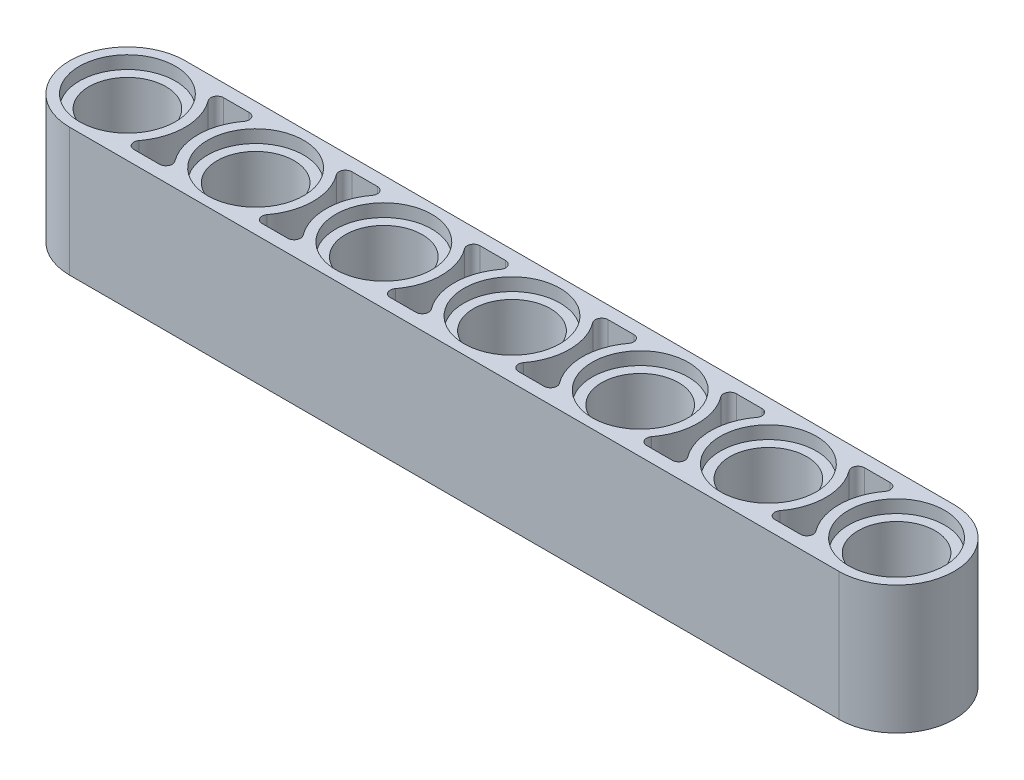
ISO-10303-21;
HEADER;
FILE_DESCRIPTION(('STEP AP214'),'2;1');
FILE_NAME('part.step','',(''),(''),'','','');
FILE_SCHEMA(('AUTOMOTIVE_DESIGN { 1 0 10303 214 1 1 1 1 }'));
ENDSEC;
DATA;
#1=APPLICATION_CONTEXT('core data for automotive mechanical design processes');
#2=APPLICATION_PROTOCOL_DEFINITION('international standard','automotive_design',2000,#1);
#3=PRODUCT_CONTEXT('',#1,'mechanical');
#4=PRODUCT('Part','Part','',(#3));
#5=PRODUCT_RELATED_PRODUCT_CATEGORY('part','',(#4));
#6=PRODUCT_DEFINITION_FORMATION('','',#4);
#7=PRODUCT_DEFINITION_CONTEXT('part definition',#1,'design');
#8=PRODUCT_DEFINITION('design','',#6,#7);
#9=PRODUCT_DEFINITION_SHAPE('','',#8);
#10=(LENGTH_UNIT() NAMED_UNIT(*) SI_UNIT(.MILLI.,.METRE.));
#11=(NAMED_UNIT(*) PLANE_ANGLE_UNIT() SI_UNIT($,.RADIAN.));
#12=(NAMED_UNIT(*) SI_UNIT($,.STERADIAN.) SOLID_ANGLE_UNIT());
#13=UNCERTAINTY_MEASURE_WITH_UNIT(LENGTH_MEASURE(1.E-05),#10,'distance_accuracy_value','');
#14=(GEOMETRIC_REPRESENTATION_CONTEXT(3) GLOBAL_UNCERTAINTY_ASSIGNED_CONTEXT((#13)) GLOBAL_UNIT_ASSIGNED_CONTEXT((#10,
#11,#12)) REPRESENTATION_CONTEXT('',''));
#15=CARTESIAN_POINT('',(0.,0.,0.));
#16=DIRECTION('',(0.,0.,1.));
#17=DIRECTION('',(1.,0.,0.));
#18=AXIS2_PLACEMENT_3D('',#15,#16,#17);
#19=CARTESIAN_POINT('',(0.,8.,3.6));
#20=DIRECTION('',(0.,0.,-1.));
#21=DIRECTION('',(-1.,0.,0.));
#22=AXIS2_PLACEMENT_3D('',#19,#20,#21);
#23=PLANE('',#22);
#24=DIRECTION('',(0.,1.,0.));
#25=VECTOR('',#24,1.);
#26=CARTESIAN_POINT('',(48.,-20.8806130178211,3.6));
#27=LINE('',#26,#25);
#28=CARTESIAN_POINT('',(48.,0.,3.6));
#29=VERTEX_POINT('',#28);
#30=CARTESIAN_POINT('',(48.,8.,3.6));
#31=VERTEX_POINT('',#30);
#32=EDGE_CURVE('E664',#29,#31,#27,.T.);
#33=ORIENTED_EDGE('',*,*,#32,.T.);
#34=DIRECTION('',(1.,0.,0.));
#35=VECTOR('',#34,1.);
#36=CARTESIAN_POINT('',(0.,8.,3.6));
#37=LINE('',#36,#35);
#38=CARTESIAN_POINT('',(0.,8.,3.6));
#39=VERTEX_POINT('',#38);
#40=EDGE_CURVE('E674',#39,#31,#37,.T.);
#41=ORIENTED_EDGE('',*,*,#40,.F.);
#42=DIRECTION('',(0.,-1.,0.));
#43=VECTOR('',#42,1.);
#44=CARTESIAN_POINT('',(0.,8.,3.6));
#45=LINE('',#44,#43);
#46=CARTESIAN_POINT('',(0.,0.,3.6));
#47=VERTEX_POINT('',#46);
#48=EDGE_CURVE('E11',#39,#47,#45,.T.);
#49=ORIENTED_EDGE('',*,*,#48,.T.);
#50=DIRECTION('',(1.,0.,0.));
#51=VECTOR('',#50,1.);
#52=CARTESIAN_POINT('',(0.,0.,3.6));
#53=LINE('',#52,#51);
#54=EDGE_CURVE('E676',#47,#29,#53,.T.);
#55=ORIENTED_EDGE('',*,*,#54,.T.);
#56=EDGE_LOOP('',(#33,#41,#49,#55));
#57=FACE_BOUND('',#56,.T.);
#58=ADVANCED_FACE('F38',(#57),#23,.F.);
#59=CARTESIAN_POINT('',(0.,0.,0.));
#60=DIRECTION('',(0.,1.,0.));
#61=DIRECTION('',(0.,0.,1.));
#62=AXIS2_PLACEMENT_3D('',#59,#60,#61);
#63=PLANE('',#62);
#64=CARTESIAN_POINT('',(11.2,0.,2.4));
#65=DIRECTION('',(0.,1.,0.));
#66=DIRECTION('',(0.,0.,-1.));
#67=AXIS2_PLACEMENT_3D('',#64,#65,#66);
#68=CIRCLE('',#67,0.400000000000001);
#69=CARTESIAN_POINT('',(10.88,0.,2.16));
#70=VERTEX_POINT('',#69);
#71=CARTESIAN_POINT('',(11.2,0.,2.8));
#72=VERTEX_POINT('',#71);
#73=EDGE_CURVE('E63',#70,#72,#68,.T.);
#74=ORIENTED_EDGE('',*,*,#73,.T.);
#75=DIRECTION('',(1.,0.,0.));
#76=VECTOR('',#75,1.);
#77=CARTESIAN_POINT('',(12.8,0.,2.8));
#78=LINE('',#77,#76);
#79=CARTESIAN_POINT('',(12.8,0.,2.8));
#80=VERTEX_POINT('',#79);
#81=EDGE_CURVE('E1322',#72,#80,#78,.T.);
#82=ORIENTED_EDGE('',*,*,#81,.T.);
#83=CARTESIAN_POINT('',(12.8,0.,2.4));
#84=DIRECTION('',(0.,1.,0.));
#85=DIRECTION('',(0.,0.,-1.));
#86=AXIS2_PLACEMENT_3D('',#83,#84,#85);
#87=CIRCLE('',#86,0.4);
#88=CARTESIAN_POINT('',(13.12,0.,2.16));
#89=VERTEX_POINT('',#88);
#90=EDGE_CURVE('E1354',#80,#89,#87,.T.);
#91=ORIENTED_EDGE('',*,*,#90,.T.);
#92=CARTESIAN_POINT('',(16.,0.,0.));
#93=DIRECTION('',(0.,-1.,0.));
#94=DIRECTION('',(0.,0.,1.));
#95=AXIS2_PLACEMENT_3D('',#92,#93,#94);
#96=CIRCLE('',#95,3.6);
#97=CARTESIAN_POINT('',(13.12,0.,-2.16));
#98=VERTEX_POINT('',#97);
#99=EDGE_CURVE('E1351',#89,#98,#96,.T.);
#100=ORIENTED_EDGE('',*,*,#99,.T.);
#101=CARTESIAN_POINT('',(12.8,0.,-2.4));
#102=DIRECTION('',(0.,1.,0.));
#103=DIRECTION('',(0.,0.,1.));
#104=AXIS2_PLACEMENT_3D('',#101,#102,#103);
#105=CIRCLE('',#104,0.4);
#106=CARTESIAN_POINT('',(12.8,0.,-2.8));
#107=VERTEX_POINT('',#106);
#108=EDGE_CURVE('E1348',#98,#107,#105,.T.);
#109=ORIENTED_EDGE('',*,*,#108,.T.);
#110=DIRECTION('',(-1.,0.,0.));
#111=VECTOR('',#110,1.);
#112=CARTESIAN_POINT('',(11.2,0.,-2.8));
#113=LINE('',#112,#111);
#114=CARTESIAN_POINT('',(11.2,0.,-2.8));
#115=VERTEX_POINT('',#114);
#116=EDGE_CURVE('E1345',#107,#115,#113,.T.);
#117=ORIENTED_EDGE('',*,*,#116,.T.);
#118=CARTESIAN_POINT('',(11.2,0.,-2.4));
#119=DIRECTION('',(0.,1.,0.));
#120=DIRECTION('',(0.,0.,1.));
#121=AXIS2_PLACEMENT_3D('',#118,#119,#120);
#122=CIRCLE('',#121,0.4);
#123=CARTESIAN_POINT('',(10.88,0.,-2.16));
#124=VERTEX_POINT('',#123);
#125=EDGE_CURVE('E1342',#115,#124,#122,.T.);
#126=ORIENTED_EDGE('',*,*,#125,.T.);
#127=CARTESIAN_POINT('',(8.,0.,0.));
#128=DIRECTION('',(0.,-1.,0.));
#129=DIRECTION('',(0.,0.,1.));
#130=AXIS2_PLACEMENT_3D('',#127,#128,#129);
#131=CIRCLE('',#130,3.6);
#132=EDGE_CURVE('E1338',#124,#70,#131,.T.);
#133=ORIENTED_EDGE('',*,*,#132,.T.);
#134=EDGE_LOOP('',(#74,#82,#91,#100,#109,#117,#126,#133));
#135=FACE_BOUND('',#134,.T.);
#136=CARTESIAN_POINT('',(27.2,0.,2.4));
#137=DIRECTION('',(0.,1.,0.));
#138=DIRECTION('',(0.,0.,-1.));
#139=AXIS2_PLACEMENT_3D('',#136,#137,#138);
#140=CIRCLE('',#139,0.399999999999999);
#141=CARTESIAN_POINT('',(26.88,0.,2.16));
#142=VERTEX_POINT('',#141);
#143=CARTESIAN_POINT('',(27.2,0.,2.8));
#144=VERTEX_POINT('',#143);
#145=EDGE_CURVE('E1451',#142,#144,#140,.T.);
#146=ORIENTED_EDGE('',*,*,#145,.T.);
#147=DIRECTION('',(1.,0.,0.));
#148=VECTOR('',#147,1.);
#149=CARTESIAN_POINT('',(28.8,0.,2.8));
#150=LINE('',#149,#148);
#151=CARTESIAN_POINT('',(28.8,0.,2.8));
#152=VERTEX_POINT('',#151);
#153=EDGE_CURVE('E1436',#144,#152,#150,.T.);
#154=ORIENTED_EDGE('',*,*,#153,.T.);
#155=CARTESIAN_POINT('',(28.8,0.,2.4));
#156=DIRECTION('',(0.,1.,0.));
#157=DIRECTION('',(0.,0.,-1.));
#158=AXIS2_PLACEMENT_3D('',#155,#156,#157);
#159=CIRCLE('',#158,0.4);
#160=CARTESIAN_POINT('',(29.12,0.,2.16));
#161=VERTEX_POINT('',#160);
#162=EDGE_CURVE('E1470',#152,#161,#159,.T.);
#163=ORIENTED_EDGE('',*,*,#162,.T.);
#164=CARTESIAN_POINT('',(32.,0.,0.));
#165=DIRECTION('',(0.,-1.,0.));
#166=DIRECTION('',(0.,0.,1.));
#167=AXIS2_PLACEMENT_3D('',#164,#165,#166);
#168=CIRCLE('',#167,3.6);
#169=CARTESIAN_POINT('',(29.12,0.,-2.16));
#170=VERTEX_POINT('',#169);
#171=EDGE_CURVE('E1467',#161,#170,#168,.T.);
#172=ORIENTED_EDGE('',*,*,#171,.T.);
#173=CARTESIAN_POINT('',(28.8,0.,-2.4));
#174=DIRECTION('',(0.,1.,0.));
#175=DIRECTION('',(0.,0.,1.));
#176=AXIS2_PLACEMENT_3D('',#173,#174,#175);
#177=CIRCLE('',#176,0.4);
#178=CARTESIAN_POINT('',(28.8,0.,-2.8));
#179=VERTEX_POINT('',#178);
#180=EDGE_CURVE('E1464',#170,#179,#177,.T.);
#181=ORIENTED_EDGE('',*,*,#180,.T.);
#182=DIRECTION('',(-1.,0.,0.));
#183=VECTOR('',#182,1.);
#184=CARTESIAN_POINT('',(27.2,0.,-2.8));
#185=LINE('',#184,#183);
#186=CARTESIAN_POINT('',(27.2,0.,-2.8));
#187=VERTEX_POINT('',#186);
#188=EDGE_CURVE('E1461',#179,#187,#185,.T.);
#189=ORIENTED_EDGE('',*,*,#188,.T.);
#190=CARTESIAN_POINT('',(27.2,0.,-2.4));
#191=DIRECTION('',(0.,1.,0.));
#192=DIRECTION('',(0.,0.,1.));
#193=AXIS2_PLACEMENT_3D('',#190,#191,#192);
#194=CIRCLE('',#193,0.4);
#195=CARTESIAN_POINT('',(26.88,0.,-2.16));
#196=VERTEX_POINT('',#195);
#197=EDGE_CURVE('E1458',#187,#196,#194,.T.);
#198=ORIENTED_EDGE('',*,*,#197,.T.);
#199=CARTESIAN_POINT('',(24.,0.,0.));
#200=DIRECTION('',(0.,-1.,0.));
#201=DIRECTION('',(0.,0.,1.));
#202=AXIS2_PLACEMENT_3D('',#199,#200,#201);
#203=CIRCLE('',#202,3.6);
#204=EDGE_CURVE('E1454',#196,#142,#203,.T.);
#205=ORIENTED_EDGE('',*,*,#204,.T.);
#206=EDGE_LOOP('',(#146,#154,#163,#172,#181,#189,#198,#205));
#207=FACE_BOUND('',#206,.T.);
#208=CARTESIAN_POINT('',(43.2,0.,2.4));
#209=DIRECTION('',(0.,1.,0.));
#210=DIRECTION('',(0.,0.,-1.));
#211=AXIS2_PLACEMENT_3D('',#208,#209,#210);
#212=CIRCLE('',#211,0.400000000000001);
#213=CARTESIAN_POINT('',(42.88,0.,2.16));
#214=VERTEX_POINT('',#213);
#215=CARTESIAN_POINT('',(43.2,0.,2.8));
#216=VERTEX_POINT('',#215);
#217=EDGE_CURVE('E1257',#214,#216,#212,.T.);
#218=ORIENTED_EDGE('',*,*,#217,.T.);
#219=DIRECTION('',(1.,0.,0.));
#220=VECTOR('',#219,1.);
#221=CARTESIAN_POINT('',(44.8,0.,2.8));
#222=LINE('',#221,#220);
#223=CARTESIAN_POINT('',(44.8,0.,2.8));
#224=VERTEX_POINT('',#223);
#225=EDGE_CURVE('E1554',#216,#224,#222,.T.);
#226=ORIENTED_EDGE('',*,*,#225,.T.);
#227=CARTESIAN_POINT('',(44.8,0.,2.4));
#228=DIRECTION('',(0.,1.,0.));
#229=DIRECTION('',(0.,0.,-1.));
#230=AXIS2_PLACEMENT_3D('',#227,#228,#229);
#231=CIRCLE('',#230,0.4);
#232=CARTESIAN_POINT('',(45.12,0.,2.16));
#233=VERTEX_POINT('',#232);
#234=EDGE_CURVE('E1583',#224,#233,#231,.T.);
#235=ORIENTED_EDGE('',*,*,#234,.T.);
#236=CARTESIAN_POINT('',(48.,0.,0.));
#237=DIRECTION('',(0.,-1.,0.));
#238=DIRECTION('',(0.,0.,1.));
#239=AXIS2_PLACEMENT_3D('',#236,#237,#238);
#240=CIRCLE('',#239,3.6);
#241=CARTESIAN_POINT('',(45.12,0.,-2.16));
#242=VERTEX_POINT('',#241);
#243=EDGE_CURVE('E1580',#233,#242,#240,.T.);
#244=ORIENTED_EDGE('',*,*,#243,.T.);
#245=CARTESIAN_POINT('',(44.8,0.,-2.4));
#246=DIRECTION('',(0.,1.,0.));
#247=DIRECTION('',(0.,0.,1.));
#248=AXIS2_PLACEMENT_3D('',#245,#246,#247);
#249=CIRCLE('',#248,0.4);
#250=CARTESIAN_POINT('',(44.8,0.,-2.8));
#251=VERTEX_POINT('',#250);
#252=EDGE_CURVE('E1577',#242,#251,#249,.T.);
#253=ORIENTED_EDGE('',*,*,#252,.T.);
#254=DIRECTION('',(-1.,0.,0.));
#255=VECTOR('',#254,1.);
#256=CARTESIAN_POINT('',(43.2,0.,-2.8));
#257=LINE('',#256,#255);
#258=CARTESIAN_POINT('',(43.2,0.,-2.8));
#259=VERTEX_POINT('',#258);
#260=EDGE_CURVE('E1574',#251,#259,#257,.T.);
#261=ORIENTED_EDGE('',*,*,#260,.T.);
#262=CARTESIAN_POINT('',(43.2,0.,-2.4));
#263=DIRECTION('',(0.,1.,0.));
#264=DIRECTION('',(0.,0.,1.));
#265=AXIS2_PLACEMENT_3D('',#262,#263,#264);
#266=CIRCLE('',#265,0.4);
#267=CARTESIAN_POINT('',(42.88,0.,-2.16));
#268=VERTEX_POINT('',#267);
#269=EDGE_CURVE('E1571',#259,#268,#266,.T.);
#270=ORIENTED_EDGE('',*,*,#269,.T.);
#271=CARTESIAN_POINT('',(40.,0.,0.));
#272=DIRECTION('',(0.,-1.,0.));
#273=DIRECTION('',(0.,0.,1.));
#274=AXIS2_PLACEMENT_3D('',#271,#272,#273);
#275=CIRCLE('',#274,3.6);
#276=EDGE_CURVE('E1259',#268,#214,#275,.T.);
#277=ORIENTED_EDGE('',*,*,#276,.T.);
#278=EDGE_LOOP('',(#218,#226,#235,#244,#253,#261,#270,#277));
#279=FACE_BOUND('',#278,.T.);
#280=CARTESIAN_POINT('',(0.,0.,0.));
#281=DIRECTION('',(0.,1.,0.));
#282=DIRECTION('',(0.,0.,1.));
#283=AXIS2_PLACEMENT_3D('',#280,#281,#282);
#284=CIRCLE('',#283,3.);
#285=CARTESIAN_POINT('',(0.,0.,3.));
#286=VERTEX_POINT('',#285);
#287=EDGE_CURVE('E752',#286,#286,#284,.T.);
#288=ORIENTED_EDGE('',*,*,#287,.T.);
#289=EDGE_LOOP('',(#288));
#290=FACE_BOUND('',#289,.T.);
#291=CARTESIAN_POINT('',(8.,0.,0.));
#292=DIRECTION('',(0.,1.,0.));
#293=DIRECTION('',(0.,0.,1.));
#294=AXIS2_PLACEMENT_3D('',#291,#292,#293);
#295=CIRCLE('',#294,3.);
#296=CARTESIAN_POINT('',(8.,0.,3.));
#297=VERTEX_POINT('',#296);
#298=EDGE_CURVE('E763',#297,#297,#295,.T.);
#299=ORIENTED_EDGE('',*,*,#298,.T.);
#300=EDGE_LOOP('',(#299));
#301=FACE_BOUND('',#300,.T.);
#302=CARTESIAN_POINT('',(16.,0.,0.));
#303=DIRECTION('',(0.,1.,0.));
#304=DIRECTION('',(0.,0.,1.));
#305=AXIS2_PLACEMENT_3D('',#302,#303,#304);
#306=CIRCLE('',#305,3.);
#307=CARTESIAN_POINT('',(16.,0.,3.));
#308=VERTEX_POINT('',#307);
#309=EDGE_CURVE('E769',#308,#308,#306,.T.);
#310=ORIENTED_EDGE('',*,*,#309,.T.);
#311=EDGE_LOOP('',(#310));
#312=FACE_BOUND('',#311,.T.);
#313=CARTESIAN_POINT('',(24.,0.,0.));
#314=DIRECTION('',(0.,1.,0.));
#315=DIRECTION('',(0.,0.,1.));
#316=AXIS2_PLACEMENT_3D('',#313,#314,#315);
#317=CIRCLE('',#316,3.);
#318=CARTESIAN_POINT('',(24.,0.,3.));
#319=VERTEX_POINT('',#318);
#320=EDGE_CURVE('E775',#319,#319,#317,.T.);
#321=ORIENTED_EDGE('',*,*,#320,.T.);
#322=EDGE_LOOP('',(#321));
#323=FACE_BOUND('',#322,.T.);
#324=CARTESIAN_POINT('',(32.,0.,0.));
#325=DIRECTION('',(0.,1.,0.));
#326=DIRECTION('',(0.,0.,1.));
#327=AXIS2_PLACEMENT_3D('',#324,#325,#326);
#328=CIRCLE('',#327,3.);
#329=CARTESIAN_POINT('',(32.,0.,3.));
#330=VERTEX_POINT('',#329);
#331=EDGE_CURVE('E781',#330,#330,#328,.T.);
#332=ORIENTED_EDGE('',*,*,#331,.T.);
#333=EDGE_LOOP('',(#332));
#334=FACE_BOUND('',#333,.T.);
#335=CARTESIAN_POINT('',(40.,0.,0.));
#336=DIRECTION('',(0.,1.,0.));
#337=DIRECTION('',(0.,0.,1.));
#338=AXIS2_PLACEMENT_3D('',#335,#336,#337);
#339=CIRCLE('',#338,3.);
#340=CARTESIAN_POINT('',(40.,0.,3.));
#341=VERTEX_POINT('',#340);
#342=EDGE_CURVE('E787',#341,#341,#339,.T.);
#343=ORIENTED_EDGE('',*,*,#342,.T.);
#344=EDGE_LOOP('',(#343));
#345=FACE_BOUND('',#344,.T.);
#346=CARTESIAN_POINT('',(48.,0.,0.));
#347=DIRECTION('',(0.,1.,0.));
#348=DIRECTION('',(0.,0.,1.));
#349=AXIS2_PLACEMENT_3D('',#346,#347,#348);
#350=CIRCLE('',#349,3.);
#351=CARTESIAN_POINT('',(48.,0.,3.));
#352=VERTEX_POINT('',#351);
#353=EDGE_CURVE('E793',#352,#352,#350,.T.);
#354=ORIENTED_EDGE('',*,*,#353,.T.);
#355=EDGE_LOOP('',(#354));
#356=FACE_BOUND('',#355,.T.);
#357=DIRECTION('',(-1.,0.,0.));
#358=VECTOR('',#357,1.);
#359=CARTESIAN_POINT('',(0.,0.,-3.6));
#360=LINE('',#359,#358);
#361=CARTESIAN_POINT('',(48.,0.,-3.6));
#362=VERTEX_POINT('',#361);
#363=CARTESIAN_POINT('',(0.,0.,-3.6));
#364=VERTEX_POINT('',#363);
#365=EDGE_CURVE('E686',#362,#364,#360,.T.);
#366=ORIENTED_EDGE('',*,*,#365,.F.);
#367=CARTESIAN_POINT('',(48.,0.,0.));
#368=DIRECTION('',(0.,-1.,0.));
#369=DIRECTION('',(0.,0.,1.));
#370=AXIS2_PLACEMENT_3D('',#367,#368,#369);
#371=CIRCLE('',#370,3.6);
#372=EDGE_CURVE('E758',#362,#29,#371,.T.);
#373=ORIENTED_EDGE('',*,*,#372,.T.);
#374=ORIENTED_EDGE('',*,*,#54,.F.);
#375=CARTESIAN_POINT('',(0.,0.,0.));
#376=DIRECTION('',(0.,1.,0.));
#377=DIRECTION('',(0.,0.,1.));
#378=AXIS2_PLACEMENT_3D('',#375,#376,#377);
#379=CIRCLE('',#378,3.6);
#380=EDGE_CURVE('E690',#364,#47,#379,.T.);
#381=ORIENTED_EDGE('',*,*,#380,.F.);
#382=EDGE_LOOP('',(#366,#373,#374,#381));
#383=FACE_BOUND('',#382,.T.);
#384=CARTESIAN_POINT('',(35.2,0.,2.4));
#385=DIRECTION('',(0.,1.,0.));
#386=DIRECTION('',(0.,0.,-1.));
#387=AXIS2_PLACEMENT_3D('',#384,#385,#386);
#388=CIRCLE('',#387,0.400000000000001);
#389=CARTESIAN_POINT('',(34.88,0.,2.16));
#390=VERTEX_POINT('',#389);
#391=CARTESIAN_POINT('',(35.2,0.,2.8));
#392=VERTEX_POINT('',#391);
#393=EDGE_CURVE('E1510',#390,#392,#388,.T.);
#394=ORIENTED_EDGE('',*,*,#393,.T.);
#395=DIRECTION('',(1.,0.,0.));
#396=VECTOR('',#395,1.);
#397=CARTESIAN_POINT('',(36.8,0.,2.8));
#398=LINE('',#397,#396);
#399=CARTESIAN_POINT('',(36.8,0.,2.8));
#400=VERTEX_POINT('',#399);
#401=EDGE_CURVE('E1495',#392,#400,#398,.T.);
#402=ORIENTED_EDGE('',*,*,#401,.T.);
#403=CARTESIAN_POINT('',(36.8,0.,2.4));
#404=DIRECTION('',(0.,1.,0.));
#405=DIRECTION('',(0.,0.,-1.));
#406=AXIS2_PLACEMENT_3D('',#403,#404,#405);
#407=CIRCLE('',#406,0.4);
#408=CARTESIAN_POINT('',(37.12,0.,2.16));
#409=VERTEX_POINT('',#408);
#410=EDGE_CURVE('E1529',#400,#409,#407,.T.);
#411=ORIENTED_EDGE('',*,*,#410,.T.);
#412=CARTESIAN_POINT('',(40.,0.,0.));
#413=DIRECTION('',(0.,-1.,0.));
#414=DIRECTION('',(0.,0.,1.));
#415=AXIS2_PLACEMENT_3D('',#412,#413,#414);
#416=CIRCLE('',#415,3.6);
#417=CARTESIAN_POINT('',(37.12,0.,-2.16));
#418=VERTEX_POINT('',#417);
#419=EDGE_CURVE('E1526',#409,#418,#416,.T.);
#420=ORIENTED_EDGE('',*,*,#419,.T.);
#421=CARTESIAN_POINT('',(36.8,0.,-2.4));
#422=DIRECTION('',(0.,1.,0.));
#423=DIRECTION('',(0.,0.,1.));
#424=AXIS2_PLACEMENT_3D('',#421,#422,#423);
#425=CIRCLE('',#424,0.4);
#426=CARTESIAN_POINT('',(36.8,0.,-2.8));
#427=VERTEX_POINT('',#426);
#428=EDGE_CURVE('E1523',#418,#427,#425,.T.);
#429=ORIENTED_EDGE('',*,*,#428,.T.);
#430=DIRECTION('',(-1.,0.,0.));
#431=VECTOR('',#430,1.);
#432=CARTESIAN_POINT('',(35.2,0.,-2.8));
#433=LINE('',#432,#431);
#434=CARTESIAN_POINT('',(35.2,0.,-2.8));
#435=VERTEX_POINT('',#434);
#436=EDGE_CURVE('E1520',#427,#435,#433,.T.);
#437=ORIENTED_EDGE('',*,*,#436,.T.);
#438=CARTESIAN_POINT('',(35.2,0.,-2.4));
#439=DIRECTION('',(0.,1.,0.));
#440=DIRECTION('',(0.,0.,1.));
#441=AXIS2_PLACEMENT_3D('',#438,#439,#440);
#442=CIRCLE('',#441,0.4);
#443=CARTESIAN_POINT('',(34.88,0.,-2.16));
#444=VERTEX_POINT('',#443);
#445=EDGE_CURVE('E1517',#435,#444,#442,.T.);
#446=ORIENTED_EDGE('',*,*,#445,.T.);
#447=CARTESIAN_POINT('',(32.,0.,0.));
#448=DIRECTION('',(0.,-1.,0.));
#449=DIRECTION('',(0.,0.,1.));
#450=AXIS2_PLACEMENT_3D('',#447,#448,#449);
#451=CIRCLE('',#450,3.6);
#452=EDGE_CURVE('E1513',#444,#390,#451,.T.);
#453=ORIENTED_EDGE('',*,*,#452,.T.);
#454=EDGE_LOOP('',(#394,#402,#411,#420,#429,#437,#446,#453));
#455=FACE_BOUND('',#454,.T.);
#456=CARTESIAN_POINT('',(19.2,0.,2.4));
#457=DIRECTION('',(0.,1.,0.));
#458=DIRECTION('',(0.,0.,-1.));
#459=AXIS2_PLACEMENT_3D('',#456,#457,#458);
#460=CIRCLE('',#459,0.399999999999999);
#461=CARTESIAN_POINT('',(18.88,0.,2.16));
#462=VERTEX_POINT('',#461);
#463=CARTESIAN_POINT('',(19.2,0.,2.8));
#464=VERTEX_POINT('',#463);
#465=EDGE_CURVE('E1392',#462,#464,#460,.T.);
#466=ORIENTED_EDGE('',*,*,#465,.T.);
#467=DIRECTION('',(1.,0.,0.));
#468=VECTOR('',#467,1.);
#469=CARTESIAN_POINT('',(20.8,0.,2.8));
#470=LINE('',#469,#468);
#471=CARTESIAN_POINT('',(20.8,0.,2.8));
#472=VERTEX_POINT('',#471);
#473=EDGE_CURVE('E1377',#464,#472,#470,.T.);
#474=ORIENTED_EDGE('',*,*,#473,.T.);
#475=CARTESIAN_POINT('',(20.8,0.,2.4));
#476=DIRECTION('',(0.,1.,0.));
#477=DIRECTION('',(0.,0.,-1.));
#478=AXIS2_PLACEMENT_3D('',#475,#476,#477);
#479=CIRCLE('',#478,0.4);
#480=CARTESIAN_POINT('',(21.12,0.,2.16));
#481=VERTEX_POINT('',#480);
#482=EDGE_CURVE('E1411',#472,#481,#479,.T.);
#483=ORIENTED_EDGE('',*,*,#482,.T.);
#484=CARTESIAN_POINT('',(24.,0.,0.));
#485=DIRECTION('',(0.,-1.,0.));
#486=DIRECTION('',(0.,0.,1.));
#487=AXIS2_PLACEMENT_3D('',#484,#485,#486);
#488=CIRCLE('',#487,3.6);
#489=CARTESIAN_POINT('',(21.12,0.,-2.16));
#490=VERTEX_POINT('',#489);
#491=EDGE_CURVE('E1408',#481,#490,#488,.T.);
#492=ORIENTED_EDGE('',*,*,#491,.T.);
#493=CARTESIAN_POINT('',(20.8,0.,-2.4));
#494=DIRECTION('',(0.,1.,0.));
#495=DIRECTION('',(0.,0.,1.));
#496=AXIS2_PLACEMENT_3D('',#493,#494,#495);
#497=CIRCLE('',#496,0.4);
#498=CARTESIAN_POINT('',(20.8,0.,-2.8));
#499=VERTEX_POINT('',#498);
#500=EDGE_CURVE('E1405',#490,#499,#497,.T.);
#501=ORIENTED_EDGE('',*,*,#500,.T.);
#502=DIRECTION('',(-1.,0.,0.));
#503=VECTOR('',#502,1.);
#504=CARTESIAN_POINT('',(19.2,0.,-2.8));
#505=LINE('',#504,#503);
#506=CARTESIAN_POINT('',(19.2,0.,-2.8));
#507=VERTEX_POINT('',#506);
#508=EDGE_CURVE('E1402',#499,#507,#505,.T.);
#509=ORIENTED_EDGE('',*,*,#508,.T.);
#510=CARTESIAN_POINT('',(19.2,0.,-2.4));
#511=DIRECTION('',(0.,1.,0.));
#512=DIRECTION('',(0.,0.,1.));
#513=AXIS2_PLACEMENT_3D('',#510,#511,#512);
#514=CIRCLE('',#513,0.4);
#515=CARTESIAN_POINT('',(18.88,0.,-2.16));
#516=VERTEX_POINT('',#515);
#517=EDGE_CURVE('E1399',#507,#516,#514,.T.);
#518=ORIENTED_EDGE('',*,*,#517,.T.);
#519=CARTESIAN_POINT('',(16.,0.,0.));
#520=DIRECTION('',(0.,-1.,0.));
#521=DIRECTION('',(0.,0.,1.));
#522=AXIS2_PLACEMENT_3D('',#519,#520,#521);
#523=CIRCLE('',#522,3.6);
#524=EDGE_CURVE('E1395',#516,#462,#523,.T.);
#525=ORIENTED_EDGE('',*,*,#524,.T.);
#526=EDGE_LOOP('',(#466,#474,#483,#492,#501,#509,#518,#525));
#527=FACE_BOUND('',#526,.T.);
#528=CARTESIAN_POINT('',(3.2,0.,2.4));
#529=DIRECTION('',(0.,1.,0.));
#530=DIRECTION('',(0.,0.,-1.));
#531=AXIS2_PLACEMENT_3D('',#528,#529,#530);
#532=CIRCLE('',#531,0.4);
#533=CARTESIAN_POINT('',(2.88,0.,2.16));
#534=VERTEX_POINT('',#533);
#535=CARTESIAN_POINT('',(3.2,0.,2.8));
#536=VERTEX_POINT('',#535);
#537=EDGE_CURVE('E55',#534,#536,#532,.T.);
#538=ORIENTED_EDGE('',*,*,#537,.T.);
#539=DIRECTION('',(1.,0.,0.));
#540=VECTOR('',#539,1.);
#541=CARTESIAN_POINT('',(4.8,0.,2.8));
#542=LINE('',#541,#540);
#543=CARTESIAN_POINT('',(4.8,0.,2.8));
#544=VERTEX_POINT('',#543);
#545=EDGE_CURVE('E1267',#536,#544,#542,.T.);
#546=ORIENTED_EDGE('',*,*,#545,.T.);
#547=CARTESIAN_POINT('',(4.8,0.,2.4));
#548=DIRECTION('',(0.,1.,0.));
#549=DIRECTION('',(0.,0.,-1.));
#550=AXIS2_PLACEMENT_3D('',#547,#548,#549);
#551=CIRCLE('',#550,0.4);
#552=CARTESIAN_POINT('',(5.12,0.,2.16));
#553=VERTEX_POINT('',#552);
#554=EDGE_CURVE('E1299',#544,#553,#551,.T.);
#555=ORIENTED_EDGE('',*,*,#554,.T.);
#556=CARTESIAN_POINT('',(8.,0.,0.));
#557=DIRECTION('',(0.,-1.,0.));
#558=DIRECTION('',(0.,0.,1.));
#559=AXIS2_PLACEMENT_3D('',#556,#557,#558);
#560=CIRCLE('',#559,3.6);
#561=CARTESIAN_POINT('',(5.12,0.,-2.16));
#562=VERTEX_POINT('',#561);
#563=EDGE_CURVE('E1296',#553,#562,#560,.T.);
#564=ORIENTED_EDGE('',*,*,#563,.T.);
#565=CARTESIAN_POINT('',(4.8,0.,-2.4));
#566=DIRECTION('',(0.,1.,0.));
#567=DIRECTION('',(0.,0.,1.));
#568=AXIS2_PLACEMENT_3D('',#565,#566,#567);
#569=CIRCLE('',#568,0.4);
#570=CARTESIAN_POINT('',(4.8,0.,-2.8));
#571=VERTEX_POINT('',#570);
#572=EDGE_CURVE('E1293',#562,#571,#569,.T.);
#573=ORIENTED_EDGE('',*,*,#572,.T.);
#574=DIRECTION('',(-1.,0.,0.));
#575=VECTOR('',#574,1.);
#576=CARTESIAN_POINT('',(3.2,0.,-2.8));
#577=LINE('',#576,#575);
#578=CARTESIAN_POINT('',(3.2,0.,-2.8));
#579=VERTEX_POINT('',#578);
#580=EDGE_CURVE('E1290',#571,#579,#577,.T.);
#581=ORIENTED_EDGE('',*,*,#580,.T.);
#582=CARTESIAN_POINT('',(3.2,0.,-2.4));
#583=DIRECTION('',(0.,1.,0.));
#584=DIRECTION('',(0.,0.,1.));
#585=AXIS2_PLACEMENT_3D('',#582,#583,#584);
#586=CIRCLE('',#585,0.4);
#587=CARTESIAN_POINT('',(2.88,0.,-2.16));
#588=VERTEX_POINT('',#587);
#589=EDGE_CURVE('E1287',#579,#588,#586,.T.);
#590=ORIENTED_EDGE('',*,*,#589,.T.);
#591=CARTESIAN_POINT('',(0.,0.,0.));
#592=DIRECTION('',(0.,-1.,0.));
#593=DIRECTION('',(0.,0.,1.));
#594=AXIS2_PLACEMENT_3D('',#591,#592,#593);
#595=CIRCLE('',#594,3.6);
#596=EDGE_CURVE('E1283',#588,#534,#595,.T.);
#597=ORIENTED_EDGE('',*,*,#596,.T.);
#598=EDGE_LOOP('',(#538,#546,#555,#564,#573,#581,#590,#597));
#599=FACE_BOUND('',#598,.T.);
#600=ADVANCED_FACE('F1238',(#135,#207,#279,#290,#301,#312,#323,#334,#345,#356,#383,#455,#527,
#599),#63,.F.);
#601=CARTESIAN_POINT('',(0.,8.,0.));
#602=DIRECTION('',(0.,-1.,0.));
#603=DIRECTION('',(0.,0.,-1.));
#604=AXIS2_PLACEMENT_3D('',#601,#602,#603);
#605=CYLINDRICAL_SURFACE('',#604,2.4);
#606=CARTESIAN_POINT('',(0.,7.2,0.));
#607=DIRECTION('',(0.,1.,0.));
#608=DIRECTION('',(0.,0.,1.));
#609=AXIS2_PLACEMENT_3D('',#606,#607,#608);
#610=CIRCLE('',#609,2.4);
#611=CARTESIAN_POINT('',(0.,7.2,2.4));
#612=VERTEX_POINT('',#611);
#613=EDGE_CURVE('E693',#612,#612,#610,.T.);
#614=ORIENTED_EDGE('',*,*,#613,.T.);
#615=EDGE_LOOP('',(#614));
#616=FACE_BOUND('',#615,.T.);
#617=CARTESIAN_POINT('',(0.,0.8,0.));
#618=DIRECTION('',(0.,-1.,0.));
#619=DIRECTION('',(0.,0.,-1.));
#620=AXIS2_PLACEMENT_3D('',#617,#618,#619);
#621=CIRCLE('',#620,2.4);
#622=CARTESIAN_POINT('',(0.,0.8,-2.4));
#623=VERTEX_POINT('',#622);
#624=EDGE_CURVE('E42',#623,#623,#621,.T.);
#625=ORIENTED_EDGE('',*,*,#624,.T.);
#626=EDGE_LOOP('',(#625));
#627=FACE_BOUND('',#626,.T.);
#628=ADVANCED_FACE('F741',(#616,#627),#605,.F.);
#629=CARTESIAN_POINT('',(8.,8.,0.));
#630=DIRECTION('',(0.,-1.,0.));
#631=DIRECTION('',(0.,0.,-1.));
#632=AXIS2_PLACEMENT_3D('',#629,#630,#631);
#633=CYLINDRICAL_SURFACE('',#632,2.4);
#634=CARTESIAN_POINT('',(8.,7.2,0.));
#635=DIRECTION('',(0.,1.,0.));
#636=DIRECTION('',(0.,0.,1.));
#637=AXIS2_PLACEMENT_3D('',#634,#635,#636);
#638=CIRCLE('',#637,2.4);
#639=CARTESIAN_POINT('',(8.,7.2,2.4));
#640=VERTEX_POINT('',#639);
#641=EDGE_CURVE('E714',#640,#640,#638,.T.);
#642=ORIENTED_EDGE('',*,*,#641,.T.);
#643=EDGE_LOOP('',(#642));
#644=FACE_BOUND('',#643,.T.);
#645=CARTESIAN_POINT('',(8.,0.8,0.));
#646=DIRECTION('',(0.,-1.,0.));
#647=DIRECTION('',(0.,0.,-1.));
#648=AXIS2_PLACEMENT_3D('',#645,#646,#647);
#649=CIRCLE('',#648,2.4);
#650=CARTESIAN_POINT('',(8.,0.8,-2.4));
#651=VERTEX_POINT('',#650);
#652=EDGE_CURVE('E734',#651,#651,#649,.T.);
#653=ORIENTED_EDGE('',*,*,#652,.T.);
#654=EDGE_LOOP('',(#653));
#655=FACE_BOUND('',#654,.T.);
#656=ADVANCED_FACE('F1989',(#644,#655),#633,.F.);
#657=CARTESIAN_POINT('',(16.,8.,0.));
#658=DIRECTION('',(0.,-1.,0.));
#659=DIRECTION('',(0.,0.,-1.));
#660=AXIS2_PLACEMENT_3D('',#657,#658,#659);
#661=CYLINDRICAL_SURFACE('',#660,2.4);
#662=CARTESIAN_POINT('',(16.,7.2,0.));
#663=DIRECTION('',(0.,1.,0.));
#664=DIRECTION('',(0.,0.,1.));
#665=AXIS2_PLACEMENT_3D('',#662,#663,#664);
#666=CIRCLE('',#665,2.4);
#667=CARTESIAN_POINT('',(16.,7.2,2.4));
#668=VERTEX_POINT('',#667);
#669=EDGE_CURVE('E711',#668,#668,#666,.T.);
#670=ORIENTED_EDGE('',*,*,#669,.T.);
#671=EDGE_LOOP('',(#670));
#672=FACE_BOUND('',#671,.T.);
#673=CARTESIAN_POINT('',(16.,0.8,0.));
#674=DIRECTION('',(0.,-1.,0.));
#675=DIRECTION('',(0.,0.,-1.));
#676=AXIS2_PLACEMENT_3D('',#673,#674,#675);
#677=CIRCLE('',#676,2.4);
#678=CARTESIAN_POINT('',(16.,0.8,-2.4));
#679=VERTEX_POINT('',#678);
#680=EDGE_CURVE('E732',#679,#679,#677,.T.);
#681=ORIENTED_EDGE('',*,*,#680,.T.);
#682=EDGE_LOOP('',(#681));
#683=FACE_BOUND('',#682,.T.);
#684=ADVANCED_FACE('F1985',(#672,#683),#661,.F.);
#685=CARTESIAN_POINT('',(24.,8.,0.));
#686=DIRECTION('',(0.,-1.,0.));
#687=DIRECTION('',(0.,0.,-1.));
#688=AXIS2_PLACEMENT_3D('',#685,#686,#687);
#689=CYLINDRICAL_SURFACE('',#688,2.4);
#690=CARTESIAN_POINT('',(24.,7.2,0.));
#691=DIRECTION('',(0.,1.,0.));
#692=DIRECTION('',(0.,0.,1.));
#693=AXIS2_PLACEMENT_3D('',#690,#691,#692);
#694=CIRCLE('',#693,2.4);
#695=CARTESIAN_POINT('',(24.,7.2,2.4));
#696=VERTEX_POINT('',#695);
#697=EDGE_CURVE('E708',#696,#696,#694,.T.);
#698=ORIENTED_EDGE('',*,*,#697,.T.);
#699=EDGE_LOOP('',(#698));
#700=FACE_BOUND('',#699,.T.);
#701=CARTESIAN_POINT('',(24.,0.8,0.));
#702=DIRECTION('',(0.,-1.,0.));
#703=DIRECTION('',(0.,0.,-1.));
#704=AXIS2_PLACEMENT_3D('',#701,#702,#703);
#705=CIRCLE('',#704,2.4);
#706=CARTESIAN_POINT('',(24.,0.8,-2.4));
#707=VERTEX_POINT('',#706);
#708=EDGE_CURVE('E729',#707,#707,#705,.T.);
#709=ORIENTED_EDGE('',*,*,#708,.T.);
#710=EDGE_LOOP('',(#709));
#711=FACE_BOUND('',#710,.T.);
#712=ADVANCED_FACE('F1981',(#700,#711),#689,.F.);
#713=CARTESIAN_POINT('',(32.,8.,0.));
#714=DIRECTION('',(0.,-1.,0.));
#715=DIRECTION('',(0.,0.,-1.));
#716=AXIS2_PLACEMENT_3D('',#713,#714,#715);
#717=CYLINDRICAL_SURFACE('',#716,2.4);
#718=CARTESIAN_POINT('',(32.,7.2,0.));
#719=DIRECTION('',(0.,1.,0.));
#720=DIRECTION('',(0.,0.,1.));
#721=AXIS2_PLACEMENT_3D('',#718,#719,#720);
#722=CIRCLE('',#721,2.4);
#723=CARTESIAN_POINT('',(32.,7.2,2.4));
#724=VERTEX_POINT('',#723);
#725=EDGE_CURVE('E705',#724,#724,#722,.T.);
#726=ORIENTED_EDGE('',*,*,#725,.T.);
#727=EDGE_LOOP('',(#726));
#728=FACE_BOUND('',#727,.T.);
#729=CARTESIAN_POINT('',(32.,0.8,0.));
#730=DIRECTION('',(0.,-1.,0.));
#731=DIRECTION('',(0.,0.,-1.));
#732=AXIS2_PLACEMENT_3D('',#729,#730,#731);
#733=CIRCLE('',#732,2.4);
#734=CARTESIAN_POINT('',(32.,0.8,-2.4));
#735=VERTEX_POINT('',#734);
#736=EDGE_CURVE('E726',#735,#735,#733,.T.);
#737=ORIENTED_EDGE('',*,*,#736,.T.);
#738=EDGE_LOOP('',(#737));
#739=FACE_BOUND('',#738,.T.);
#740=ADVANCED_FACE('F1977',(#728,#739),#717,.F.);
#741=CARTESIAN_POINT('',(40.,8.,0.));
#742=DIRECTION('',(0.,-1.,0.));
#743=DIRECTION('',(0.,0.,-1.));
#744=AXIS2_PLACEMENT_3D('',#741,#742,#743);
#745=CYLINDRICAL_SURFACE('',#744,2.4);
#746=CARTESIAN_POINT('',(40.,7.2,0.));
#747=DIRECTION('',(0.,1.,0.));
#748=DIRECTION('',(0.,0.,1.));
#749=AXIS2_PLACEMENT_3D('',#746,#747,#748);
#750=CIRCLE('',#749,2.4);
#751=CARTESIAN_POINT('',(40.,7.2,2.4));
#752=VERTEX_POINT('',#751);
#753=EDGE_CURVE('E701',#752,#752,#750,.T.);
#754=ORIENTED_EDGE('',*,*,#753,.T.);
#755=EDGE_LOOP('',(#754));
#756=FACE_BOUND('',#755,.T.);
#757=CARTESIAN_POINT('',(40.,0.8,0.));
#758=DIRECTION('',(0.,-1.,0.));
#759=DIRECTION('',(0.,0.,-1.));
#760=AXIS2_PLACEMENT_3D('',#757,#758,#759);
#761=CIRCLE('',#760,2.4);
#762=CARTESIAN_POINT('',(40.,0.8,-2.4));
#763=VERTEX_POINT('',#762);
#764=EDGE_CURVE('E722',#763,#763,#761,.T.);
#765=ORIENTED_EDGE('',*,*,#764,.T.);
#766=EDGE_LOOP('',(#765));
#767=FACE_BOUND('',#766,.T.);
#768=ADVANCED_FACE('F1232',(#756,#767),#745,.F.);
#769=CARTESIAN_POINT('',(48.,8.,0.));
#770=DIRECTION('',(0.,-1.,0.));
#771=DIRECTION('',(0.,0.,-1.));
#772=AXIS2_PLACEMENT_3D('',#769,#770,#771);
#773=CYLINDRICAL_SURFACE('',#772,2.4);
#774=CARTESIAN_POINT('',(48.,7.2,0.));
#775=DIRECTION('',(0.,1.,0.));
#776=DIRECTION('',(0.,0.,1.));
#777=AXIS2_PLACEMENT_3D('',#774,#775,#776);
#778=CIRCLE('',#777,2.4);
#779=CARTESIAN_POINT('',(48.,7.2,2.4));
#780=VERTEX_POINT('',#779);
#781=EDGE_CURVE('E698',#780,#780,#778,.T.);
#782=ORIENTED_EDGE('',*,*,#781,.T.);
#783=EDGE_LOOP('',(#782));
#784=FACE_BOUND('',#783,.T.);
#785=CARTESIAN_POINT('',(48.,0.8,0.));
#786=DIRECTION('',(0.,-1.,0.));
#787=DIRECTION('',(0.,0.,-1.));
#788=AXIS2_PLACEMENT_3D('',#785,#786,#787);
#789=CIRCLE('',#788,2.4);
#790=CARTESIAN_POINT('',(48.,0.8,-2.4));
#791=VERTEX_POINT('',#790);
#792=EDGE_CURVE('E719',#791,#791,#789,.T.);
#793=ORIENTED_EDGE('',*,*,#792,.T.);
#794=EDGE_LOOP('',(#793));
#795=FACE_BOUND('',#794,.T.);
#796=ADVANCED_FACE('F1224',(#784,#795),#773,.F.);
#797=CARTESIAN_POINT('',(0.,8.,0.));
#798=DIRECTION('',(0.,1.,0.));
#799=DIRECTION('',(0.,0.,1.));
#800=AXIS2_PLACEMENT_3D('',#797,#798,#799);
#801=PLANE('',#800);
#802=CARTESIAN_POINT('',(48.,8.,0.));
#803=DIRECTION('',(0.,-1.,0.));
#804=DIRECTION('',(0.,0.,1.));
#805=AXIS2_PLACEMENT_3D('',#802,#803,#804);
#806=CIRCLE('',#805,3.6);
#807=CARTESIAN_POINT('',(48.,8.,-3.6));
#808=VERTEX_POINT('',#807);
#809=EDGE_CURVE('E661',#808,#31,#806,.T.);
#810=ORIENTED_EDGE('',*,*,#809,.F.);
#811=DIRECTION('',(-1.,0.,0.));
#812=VECTOR('',#811,1.);
#813=CARTESIAN_POINT('',(0.,8.,-3.6));
#814=LINE('',#813,#812);
#815=CARTESIAN_POINT('',(0.,8.,-3.6));
#816=VERTEX_POINT('',#815);
#817=EDGE_CURVE('E683',#808,#816,#814,.T.);
#818=ORIENTED_EDGE('',*,*,#817,.T.);
#819=CARTESIAN_POINT('',(0.,8.,0.));
#820=DIRECTION('',(0.,1.,0.));
#821=DIRECTION('',(0.,0.,1.));
#822=AXIS2_PLACEMENT_3D('',#819,#820,#821);
#823=CIRCLE('',#822,3.6);
#824=EDGE_CURVE('E681',#816,#39,#823,.T.);
#825=ORIENTED_EDGE('',*,*,#824,.T.);
#826=ORIENTED_EDGE('',*,*,#40,.T.);
#827=EDGE_LOOP('',(#810,#818,#825,#826));
#828=FACE_BOUND('',#827,.T.);
#829=CARTESIAN_POINT('',(3.2,8.,2.4));
#830=DIRECTION('',(0.,1.,0.));
#831=DIRECTION('',(0.,0.,-1.));
#832=AXIS2_PLACEMENT_3D('',#829,#830,#831);
#833=CIRCLE('',#832,0.4);
#834=CARTESIAN_POINT('',(2.88,8.,2.16));
#835=VERTEX_POINT('',#834);
#836=CARTESIAN_POINT('',(3.2,8.,2.8));
#837=VERTEX_POINT('',#836);
#838=EDGE_CURVE('E823',#835,#837,#833,.T.);
#839=ORIENTED_EDGE('',*,*,#838,.F.);
#840=CARTESIAN_POINT('',(0.,8.,0.));
#841=DIRECTION('',(0.,-1.,0.));
#842=DIRECTION('',(0.,0.,1.));
#843=AXIS2_PLACEMENT_3D('',#840,#841,#842);
#844=CIRCLE('',#843,3.6);
#845=CARTESIAN_POINT('',(2.88,8.,-2.16));
#846=VERTEX_POINT('',#845);
#847=EDGE_CURVE('E801',#846,#835,#844,.T.);
#848=ORIENTED_EDGE('',*,*,#847,.F.);
#849=CARTESIAN_POINT('',(3.2,8.,-2.4));
#850=DIRECTION('',(0.,1.,0.));
#851=DIRECTION('',(0.,0.,1.));
#852=AXIS2_PLACEMENT_3D('',#849,#850,#851);
#853=CIRCLE('',#852,0.4);
#854=CARTESIAN_POINT('',(3.2,8.,-2.8));
#855=VERTEX_POINT('',#854);
#856=EDGE_CURVE('E841',#855,#846,#853,.T.);
#857=ORIENTED_EDGE('',*,*,#856,.F.);
#858=DIRECTION('',(-1.,0.,0.));
#859=VECTOR('',#858,1.);
#860=CARTESIAN_POINT('',(3.2,8.,-2.8));
#861=LINE('',#860,#859);
#862=CARTESIAN_POINT('',(4.8,8.,-2.8));
#863=VERTEX_POINT('',#862);
#864=EDGE_CURVE('E838',#863,#855,#861,.T.);
#865=ORIENTED_EDGE('',*,*,#864,.F.);
#866=CARTESIAN_POINT('',(4.8,8.,-2.4));
#867=DIRECTION('',(0.,1.,0.));
#868=DIRECTION('',(0.,0.,1.));
#869=AXIS2_PLACEMENT_3D('',#866,#867,#868);
#870=CIRCLE('',#869,0.4);
#871=CARTESIAN_POINT('',(5.12,8.,-2.16));
#872=VERTEX_POINT('',#871);
#873=EDGE_CURVE('E835',#872,#863,#870,.T.);
#874=ORIENTED_EDGE('',*,*,#873,.F.);
#875=CARTESIAN_POINT('',(8.,8.,0.));
#876=DIRECTION('',(0.,-1.,0.));
#877=DIRECTION('',(0.,0.,1.));
#878=AXIS2_PLACEMENT_3D('',#875,#876,#877);
#879=CIRCLE('',#878,3.6);
#880=CARTESIAN_POINT('',(5.12,8.,2.16));
#881=VERTEX_POINT('',#880);
#882=EDGE_CURVE('E832',#881,#872,#879,.T.);
#883=ORIENTED_EDGE('',*,*,#882,.F.);
#884=CARTESIAN_POINT('',(4.8,8.,2.4));
#885=DIRECTION('',(0.,1.,0.));
#886=DIRECTION('',(0.,0.,-1.));
#887=AXIS2_PLACEMENT_3D('',#884,#885,#886);
#888=CIRCLE('',#887,0.4);
#889=CARTESIAN_POINT('',(4.8,8.,2.8));
#890=VERTEX_POINT('',#889);
#891=EDGE_CURVE('E829',#890,#881,#888,.T.);
#892=ORIENTED_EDGE('',*,*,#891,.F.);
#893=DIRECTION('',(1.,0.,0.));
#894=VECTOR('',#893,1.);
#895=CARTESIAN_POINT('',(4.8,8.,2.8));
#896=LINE('',#895,#894);
#897=EDGE_CURVE('E825',#837,#890,#896,.T.);
#898=ORIENTED_EDGE('',*,*,#897,.F.);
#899=EDGE_LOOP('',(#839,#848,#857,#865,#874,#883,#892,#898));
#900=FACE_BOUND('',#899,.T.);
#901=CARTESIAN_POINT('',(11.2,8.,2.4));
#902=DIRECTION('',(0.,1.,0.));
#903=DIRECTION('',(0.,0.,-1.));
#904=AXIS2_PLACEMENT_3D('',#901,#902,#903);
#905=CIRCLE('',#904,0.400000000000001);
#906=CARTESIAN_POINT('',(10.88,8.,2.16));
#907=VERTEX_POINT('',#906);
#908=CARTESIAN_POINT('',(11.2,8.,2.8));
#909=VERTEX_POINT('',#908);
#910=EDGE_CURVE('E889',#907,#909,#905,.T.);
#911=ORIENTED_EDGE('',*,*,#910,.F.);
#912=CARTESIAN_POINT('',(8.,8.,0.));
#913=DIRECTION('',(0.,-1.,0.));
#914=DIRECTION('',(0.,0.,1.));
#915=AXIS2_PLACEMENT_3D('',#912,#913,#914);
#916=CIRCLE('',#915,3.6);
#917=CARTESIAN_POINT('',(10.88,8.,-2.16));
#918=VERTEX_POINT('',#917);
#919=EDGE_CURVE('E867',#918,#907,#916,.T.);
#920=ORIENTED_EDGE('',*,*,#919,.F.);
#921=CARTESIAN_POINT('',(11.2,8.,-2.4));
#922=DIRECTION('',(0.,1.,0.));
#923=DIRECTION('',(0.,0.,1.));
#924=AXIS2_PLACEMENT_3D('',#921,#922,#923);
#925=CIRCLE('',#924,0.4);
#926=CARTESIAN_POINT('',(11.2,8.,-2.8));
#927=VERTEX_POINT('',#926);
#928=EDGE_CURVE('E907',#927,#918,#925,.T.);
#929=ORIENTED_EDGE('',*,*,#928,.F.);
#930=DIRECTION('',(-1.,0.,0.));
#931=VECTOR('',#930,1.);
#932=CARTESIAN_POINT('',(11.2,8.,-2.8));
#933=LINE('',#932,#931);
#934=CARTESIAN_POINT('',(12.8,8.,-2.8));
#935=VERTEX_POINT('',#934);
#936=EDGE_CURVE('E904',#935,#927,#933,.T.);
#937=ORIENTED_EDGE('',*,*,#936,.F.);
#938=CARTESIAN_POINT('',(12.8,8.,-2.4));
#939=DIRECTION('',(0.,1.,0.));
#940=DIRECTION('',(0.,0.,1.));
#941=AXIS2_PLACEMENT_3D('',#938,#939,#940);
#942=CIRCLE('',#941,0.4);
#943=CARTESIAN_POINT('',(13.12,8.,-2.16));
#944=VERTEX_POINT('',#943);
#945=EDGE_CURVE('E901',#944,#935,#942,.T.);
#946=ORIENTED_EDGE('',*,*,#945,.F.);
#947=CARTESIAN_POINT('',(16.,8.,0.));
#948=DIRECTION('',(0.,-1.,0.));
#949=DIRECTION('',(0.,0.,1.));
#950=AXIS2_PLACEMENT_3D('',#947,#948,#949);
#951=CIRCLE('',#950,3.6);
#952=CARTESIAN_POINT('',(13.12,8.,2.16));
#953=VERTEX_POINT('',#952);
#954=EDGE_CURVE('E898',#953,#944,#951,.T.);
#955=ORIENTED_EDGE('',*,*,#954,.F.);
#956=CARTESIAN_POINT('',(12.8,8.,2.4));
#957=DIRECTION('',(0.,1.,0.));
#958=DIRECTION('',(0.,0.,-1.));
#959=AXIS2_PLACEMENT_3D('',#956,#957,#958);
#960=CIRCLE('',#959,0.4);
#961=CARTESIAN_POINT('',(12.8,8.,2.8));
#962=VERTEX_POINT('',#961);
#963=EDGE_CURVE('E895',#962,#953,#960,.T.);
#964=ORIENTED_EDGE('',*,*,#963,.F.);
#965=DIRECTION('',(1.,0.,0.));
#966=VECTOR('',#965,1.);
#967=CARTESIAN_POINT('',(12.8,8.,2.8));
#968=LINE('',#967,#966);
#969=EDGE_CURVE('E891',#909,#962,#968,.T.);
#970=ORIENTED_EDGE('',*,*,#969,.F.);
#971=EDGE_LOOP('',(#911,#920,#929,#937,#946,#955,#964,#970));
#972=FACE_BOUND('',#971,.T.);
#973=CARTESIAN_POINT('',(19.2,8.,2.4));
#974=DIRECTION('',(0.,1.,0.));
#975=DIRECTION('',(0.,0.,-1.));
#976=AXIS2_PLACEMENT_3D('',#973,#974,#975);
#977=CIRCLE('',#976,0.399999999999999);
#978=CARTESIAN_POINT('',(18.88,8.,2.16));
#979=VERTEX_POINT('',#978);
#980=CARTESIAN_POINT('',(19.2,8.,2.8));
#981=VERTEX_POINT('',#980);
#982=EDGE_CURVE('E953',#979,#981,#977,.T.);
#983=ORIENTED_EDGE('',*,*,#982,.F.);
#984=CARTESIAN_POINT('',(16.,8.,0.));
#985=DIRECTION('',(0.,-1.,0.));
#986=DIRECTION('',(0.,0.,1.));
#987=AXIS2_PLACEMENT_3D('',#984,#985,#986);
#988=CIRCLE('',#987,3.6);
#989=CARTESIAN_POINT('',(18.88,8.,-2.16));
#990=VERTEX_POINT('',#989);
#991=EDGE_CURVE('E931',#990,#979,#988,.T.);
#992=ORIENTED_EDGE('',*,*,#991,.F.);
#993=CARTESIAN_POINT('',(19.2,8.,-2.4));
#994=DIRECTION('',(0.,1.,0.));
#995=DIRECTION('',(0.,0.,1.));
#996=AXIS2_PLACEMENT_3D('',#993,#994,#995);
#997=CIRCLE('',#996,0.4);
#998=CARTESIAN_POINT('',(19.2,8.,-2.8));
#999=VERTEX_POINT('',#998);
#1000=EDGE_CURVE('E971',#999,#990,#997,.T.);
#1001=ORIENTED_EDGE('',*,*,#1000,.F.);
#1002=DIRECTION('',(-1.,0.,0.));
#1003=VECTOR('',#1002,1.);
#1004=CARTESIAN_POINT('',(19.2,8.,-2.8));
#1005=LINE('',#1004,#1003);
#1006=CARTESIAN_POINT('',(20.8,8.,-2.8));
#1007=VERTEX_POINT('',#1006);
#1008=EDGE_CURVE('E968',#1007,#999,#1005,.T.);
#1009=ORIENTED_EDGE('',*,*,#1008,.F.);
#1010=CARTESIAN_POINT('',(20.8,8.,-2.4));
#1011=DIRECTION('',(0.,1.,0.));
#1012=DIRECTION('',(0.,0.,1.));
#1013=AXIS2_PLACEMENT_3D('',#1010,#1011,#1012);
#1014=CIRCLE('',#1013,0.4);
#1015=CARTESIAN_POINT('',(21.12,8.,-2.16));
#1016=VERTEX_POINT('',#1015);
#1017=EDGE_CURVE('E965',#1016,#1007,#1014,.T.);
#1018=ORIENTED_EDGE('',*,*,#1017,.F.);
#1019=CARTESIAN_POINT('',(24.,8.,0.));
#1020=DIRECTION('',(0.,-1.,0.));
#1021=DIRECTION('',(0.,0.,1.));
#1022=AXIS2_PLACEMENT_3D('',#1019,#1020,#1021);
#1023=CIRCLE('',#1022,3.6);
#1024=CARTESIAN_POINT('',(21.12,8.,2.16));
#1025=VERTEX_POINT('',#1024);
#1026=EDGE_CURVE('E962',#1025,#1016,#1023,.T.);
#1027=ORIENTED_EDGE('',*,*,#1026,.F.);
#1028=CARTESIAN_POINT('',(20.8,8.,2.4));
#1029=DIRECTION('',(0.,1.,0.));
#1030=DIRECTION('',(0.,0.,-1.));
#1031=AXIS2_PLACEMENT_3D('',#1028,#1029,#1030);
#1032=CIRCLE('',#1031,0.4);
#1033=CARTESIAN_POINT('',(20.8,8.,2.8));
#1034=VERTEX_POINT('',#1033);
#1035=EDGE_CURVE('E959',#1034,#1025,#1032,.T.);
#1036=ORIENTED_EDGE('',*,*,#1035,.F.);
#1037=DIRECTION('',(1.,0.,0.));
#1038=VECTOR('',#1037,1.);
#1039=CARTESIAN_POINT('',(20.8,8.,2.8));
#1040=LINE('',#1039,#1038);
#1041=EDGE_CURVE('E955',#981,#1034,#1040,.T.);
#1042=ORIENTED_EDGE('',*,*,#1041,.F.);
#1043=EDGE_LOOP('',(#983,#992,#1001,#1009,#1018,#1027,#1036,#1042));
#1044=FACE_BOUND('',#1043,.T.);
#1045=CARTESIAN_POINT('',(27.2,8.,2.4));
#1046=DIRECTION('',(0.,1.,0.));
#1047=DIRECTION('',(0.,0.,-1.));
#1048=AXIS2_PLACEMENT_3D('',#1045,#1046,#1047);
#1049=CIRCLE('',#1048,0.399999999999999);
#1050=CARTESIAN_POINT('',(26.88,8.,2.16));
#1051=VERTEX_POINT('',#1050);
#1052=CARTESIAN_POINT('',(27.2,8.,2.8));
#1053=VERTEX_POINT('',#1052);
#1054=EDGE_CURVE('E1017',#1051,#1053,#1049,.T.);
#1055=ORIENTED_EDGE('',*,*,#1054,.F.);
#1056=CARTESIAN_POINT('',(24.,8.,0.));
#1057=DIRECTION('',(0.,-1.,0.));
#1058=DIRECTION('',(0.,0.,1.));
#1059=AXIS2_PLACEMENT_3D('',#1056,#1057,#1058);
#1060=CIRCLE('',#1059,3.6);
#1061=CARTESIAN_POINT('',(26.88,8.,-2.16));
#1062=VERTEX_POINT('',#1061);
#1063=EDGE_CURVE('E995',#1062,#1051,#1060,.T.);
#1064=ORIENTED_EDGE('',*,*,#1063,.F.);
#1065=CARTESIAN_POINT('',(27.2,8.,-2.4));
#1066=DIRECTION('',(0.,1.,0.));
#1067=DIRECTION('',(0.,0.,1.));
#1068=AXIS2_PLACEMENT_3D('',#1065,#1066,#1067);
#1069=CIRCLE('',#1068,0.4);
#1070=CARTESIAN_POINT('',(27.2,8.,-2.8));
#1071=VERTEX_POINT('',#1070);
#1072=EDGE_CURVE('E1035',#1071,#1062,#1069,.T.);
#1073=ORIENTED_EDGE('',*,*,#1072,.F.);
#1074=DIRECTION('',(-1.,0.,0.));
#1075=VECTOR('',#1074,1.);
#1076=CARTESIAN_POINT('',(27.2,8.,-2.8));
#1077=LINE('',#1076,#1075);
#1078=CARTESIAN_POINT('',(28.8,8.,-2.8));
#1079=VERTEX_POINT('',#1078);
#1080=EDGE_CURVE('E1032',#1079,#1071,#1077,.T.);
#1081=ORIENTED_EDGE('',*,*,#1080,.F.);
#1082=CARTESIAN_POINT('',(28.8,8.,-2.4));
#1083=DIRECTION('',(0.,1.,0.));
#1084=DIRECTION('',(0.,0.,1.));
#1085=AXIS2_PLACEMENT_3D('',#1082,#1083,#1084);
#1086=CIRCLE('',#1085,0.4);
#1087=CARTESIAN_POINT('',(29.12,8.,-2.16));
#1088=VERTEX_POINT('',#1087);
#1089=EDGE_CURVE('E1029',#1088,#1079,#1086,.T.);
#1090=ORIENTED_EDGE('',*,*,#1089,.F.);
#1091=CARTESIAN_POINT('',(32.,8.,0.));
#1092=DIRECTION('',(0.,-1.,0.));
#1093=DIRECTION('',(0.,0.,1.));
#1094=AXIS2_PLACEMENT_3D('',#1091,#1092,#1093);
#1095=CIRCLE('',#1094,3.6);
#1096=CARTESIAN_POINT('',(29.12,8.,2.16));
#1097=VERTEX_POINT('',#1096);
#1098=EDGE_CURVE('E1026',#1097,#1088,#1095,.T.);
#1099=ORIENTED_EDGE('',*,*,#1098,.F.);
#1100=CARTESIAN_POINT('',(28.8,8.,2.4));
#1101=DIRECTION('',(0.,1.,0.));
#1102=DIRECTION('',(0.,0.,-1.));
#1103=AXIS2_PLACEMENT_3D('',#1100,#1101,#1102);
#1104=CIRCLE('',#1103,0.4);
#1105=CARTESIAN_POINT('',(28.8,8.,2.8));
#1106=VERTEX_POINT('',#1105);
#1107=EDGE_CURVE('E1023',#1106,#1097,#1104,.T.);
#1108=ORIENTED_EDGE('',*,*,#1107,.F.);
#1109=DIRECTION('',(1.,0.,0.));
#1110=VECTOR('',#1109,1.);
#1111=CARTESIAN_POINT('',(28.8,8.,2.8));
#1112=LINE('',#1111,#1110);
#1113=EDGE_CURVE('E1019',#1053,#1106,#1112,.T.);
#1114=ORIENTED_EDGE('',*,*,#1113,.F.);
#1115=EDGE_LOOP('',(#1055,#1064,#1073,#1081,#1090,#1099,#1108,#1114));
#1116=FACE_BOUND('',#1115,.T.);
#1117=CARTESIAN_POINT('',(35.2,8.,2.4));
#1118=DIRECTION('',(0.,1.,0.));
#1119=DIRECTION('',(0.,0.,-1.));
#1120=AXIS2_PLACEMENT_3D('',#1117,#1118,#1119);
#1121=CIRCLE('',#1120,0.400000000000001);
#1122=CARTESIAN_POINT('',(34.88,8.,2.16));
#1123=VERTEX_POINT('',#1122);
#1124=CARTESIAN_POINT('',(35.2,8.,2.8));
#1125=VERTEX_POINT('',#1124);
#1126=EDGE_CURVE('E1081',#1123,#1125,#1121,.T.);
#1127=ORIENTED_EDGE('',*,*,#1126,.F.);
#1128=CARTESIAN_POINT('',(32.,8.,0.));
#1129=DIRECTION('',(0.,-1.,0.));
#1130=DIRECTION('',(0.,0.,1.));
#1131=AXIS2_PLACEMENT_3D('',#1128,#1129,#1130);
#1132=CIRCLE('',#1131,3.6);
#1133=CARTESIAN_POINT('',(34.88,8.,-2.16));
#1134=VERTEX_POINT('',#1133);
#1135=EDGE_CURVE('E1059',#1134,#1123,#1132,.T.);
#1136=ORIENTED_EDGE('',*,*,#1135,.F.);
#1137=CARTESIAN_POINT('',(35.2,8.,-2.4));
#1138=DIRECTION('',(0.,1.,0.));
#1139=DIRECTION('',(0.,0.,1.));
#1140=AXIS2_PLACEMENT_3D('',#1137,#1138,#1139);
#1141=CIRCLE('',#1140,0.4);
#1142=CARTESIAN_POINT('',(35.2,8.,-2.8));
#1143=VERTEX_POINT('',#1142);
#1144=EDGE_CURVE('E1099',#1143,#1134,#1141,.T.);
#1145=ORIENTED_EDGE('',*,*,#1144,.F.);
#1146=DIRECTION('',(-1.,0.,0.));
#1147=VECTOR('',#1146,1.);
#1148=CARTESIAN_POINT('',(35.2,8.,-2.8));
#1149=LINE('',#1148,#1147);
#1150=CARTESIAN_POINT('',(36.8,8.,-2.8));
#1151=VERTEX_POINT('',#1150);
#1152=EDGE_CURVE('E1096',#1151,#1143,#1149,.T.);
#1153=ORIENTED_EDGE('',*,*,#1152,.F.);
#1154=CARTESIAN_POINT('',(36.8,8.,-2.4));
#1155=DIRECTION('',(0.,1.,0.));
#1156=DIRECTION('',(0.,0.,1.));
#1157=AXIS2_PLACEMENT_3D('',#1154,#1155,#1156);
#1158=CIRCLE('',#1157,0.4);
#1159=CARTESIAN_POINT('',(37.12,8.,-2.16));
#1160=VERTEX_POINT('',#1159);
#1161=EDGE_CURVE('E1093',#1160,#1151,#1158,.T.);
#1162=ORIENTED_EDGE('',*,*,#1161,.F.);
#1163=CARTESIAN_POINT('',(40.,8.,0.));
#1164=DIRECTION('',(0.,-1.,0.));
#1165=DIRECTION('',(0.,0.,1.));
#1166=AXIS2_PLACEMENT_3D('',#1163,#1164,#1165);
#1167=CIRCLE('',#1166,3.6);
#1168=CARTESIAN_POINT('',(37.12,8.,2.16));
#1169=VERTEX_POINT('',#1168);
#1170=EDGE_CURVE('E1090',#1169,#1160,#1167,.T.);
#1171=ORIENTED_EDGE('',*,*,#1170,.F.);
#1172=CARTESIAN_POINT('',(36.8,8.,2.4));
#1173=DIRECTION('',(0.,1.,0.));
#1174=DIRECTION('',(0.,0.,-1.));
#1175=AXIS2_PLACEMENT_3D('',#1172,#1173,#1174);
#1176=CIRCLE('',#1175,0.4);
#1177=CARTESIAN_POINT('',(36.8,8.,2.8));
#1178=VERTEX_POINT('',#1177);
#1179=EDGE_CURVE('E1087',#1178,#1169,#1176,.T.);
#1180=ORIENTED_EDGE('',*,*,#1179,.F.);
#1181=DIRECTION('',(1.,0.,0.));
#1182=VECTOR('',#1181,1.);
#1183=CARTESIAN_POINT('',(36.8,8.,2.8));
#1184=LINE('',#1183,#1182);
#1185=EDGE_CURVE('E1083',#1125,#1178,#1184,.T.);
#1186=ORIENTED_EDGE('',*,*,#1185,.F.);
#1187=EDGE_LOOP('',(#1127,#1136,#1145,#1153,#1162,#1171,#1180,#1186));
#1188=FACE_BOUND('',#1187,.T.);
#1189=CARTESIAN_POINT('',(43.2,8.,2.4));
#1190=DIRECTION('',(0.,1.,0.));
#1191=DIRECTION('',(0.,0.,-1.));
#1192=AXIS2_PLACEMENT_3D('',#1189,#1190,#1191);
#1193=CIRCLE('',#1192,0.400000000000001);
#1194=CARTESIAN_POINT('',(42.88,8.,2.16));
#1195=VERTEX_POINT('',#1194);
#1196=CARTESIAN_POINT('',(43.2,8.,2.8));
#1197=VERTEX_POINT('',#1196);
#1198=EDGE_CURVE('E671',#1195,#1197,#1193,.T.);
#1199=ORIENTED_EDGE('',*,*,#1198,.F.);
#1200=CARTESIAN_POINT('',(40.,8.,0.));
#1201=DIRECTION('',(0.,-1.,0.));
#1202=DIRECTION('',(0.,0.,1.));
#1203=AXIS2_PLACEMENT_3D('',#1200,#1201,#1202);
#1204=CIRCLE('',#1203,3.6);
#1205=CARTESIAN_POINT('',(42.88,8.,-2.16));
#1206=VERTEX_POINT('',#1205);
#1207=EDGE_CURVE('E1123',#1206,#1195,#1204,.T.);
#1208=ORIENTED_EDGE('',*,*,#1207,.F.);
#1209=CARTESIAN_POINT('',(43.2,8.,-2.4));
#1210=DIRECTION('',(0.,1.,0.));
#1211=DIRECTION('',(0.,0.,1.));
#1212=AXIS2_PLACEMENT_3D('',#1209,#1210,#1211);
#1213=CIRCLE('',#1212,0.4);
#1214=CARTESIAN_POINT('',(43.2,8.,-2.8));
#1215=VERTEX_POINT('',#1214);
#1216=EDGE_CURVE('E1161',#1215,#1206,#1213,.T.);
#1217=ORIENTED_EDGE('',*,*,#1216,.F.);
#1218=DIRECTION('',(-1.,0.,0.));
#1219=VECTOR('',#1218,1.);
#1220=CARTESIAN_POINT('',(43.2,8.,-2.8));
#1221=LINE('',#1220,#1219);
#1222=CARTESIAN_POINT('',(44.8,8.,-2.8));
#1223=VERTEX_POINT('',#1222);
#1224=EDGE_CURVE('E1158',#1223,#1215,#1221,.T.);
#1225=ORIENTED_EDGE('',*,*,#1224,.F.);
#1226=CARTESIAN_POINT('',(44.8,8.,-2.4));
#1227=DIRECTION('',(0.,1.,0.));
#1228=DIRECTION('',(0.,0.,1.));
#1229=AXIS2_PLACEMENT_3D('',#1226,#1227,#1228);
#1230=CIRCLE('',#1229,0.4);
#1231=CARTESIAN_POINT('',(45.12,8.,-2.16));
#1232=VERTEX_POINT('',#1231);
#1233=EDGE_CURVE('E1155',#1232,#1223,#1230,.T.);
#1234=ORIENTED_EDGE('',*,*,#1233,.F.);
#1235=CARTESIAN_POINT('',(48.,8.,0.));
#1236=DIRECTION('',(0.,-1.,0.));
#1237=DIRECTION('',(0.,0.,1.));
#1238=AXIS2_PLACEMENT_3D('',#1235,#1236,#1237);
#1239=CIRCLE('',#1238,3.6);
#1240=CARTESIAN_POINT('',(45.12,8.,2.16));
#1241=VERTEX_POINT('',#1240);
#1242=EDGE_CURVE('E1152',#1241,#1232,#1239,.T.);
#1243=ORIENTED_EDGE('',*,*,#1242,.F.);
#1244=CARTESIAN_POINT('',(44.8,8.,2.4));
#1245=DIRECTION('',(0.,1.,0.));
#1246=DIRECTION('',(0.,0.,-1.));
#1247=AXIS2_PLACEMENT_3D('',#1244,#1245,#1246);
#1248=CIRCLE('',#1247,0.4);
#1249=CARTESIAN_POINT('',(44.8,8.,2.8));
#1250=VERTEX_POINT('',#1249);
#1251=EDGE_CURVE('E1149',#1250,#1241,#1248,.T.);
#1252=ORIENTED_EDGE('',*,*,#1251,.F.);
#1253=DIRECTION('',(1.,0.,0.));
#1254=VECTOR('',#1253,1.);
#1255=CARTESIAN_POINT('',(44.8,8.,2.8));
#1256=LINE('',#1255,#1254);
#1257=EDGE_CURVE('E1146',#1197,#1250,#1256,.T.);
#1258=ORIENTED_EDGE('',*,*,#1257,.F.);
#1259=EDGE_LOOP('',(#1199,#1208,#1217,#1225,#1234,#1243,#1252,#1258));
#1260=FACE_BOUND('',#1259,.T.);
#1261=CARTESIAN_POINT('',(0.,8.,0.));
#1262=DIRECTION('',(0.,1.,0.));
#1263=DIRECTION('',(0.,0.,1.));
#1264=AXIS2_PLACEMENT_3D('',#1261,#1262,#1263);
#1265=CIRCLE('',#1264,3.);
#1266=CARTESIAN_POINT('',(0.,8.,3.));
#1267=VERTEX_POINT('',#1266);
#1268=EDGE_CURVE('E1183',#1267,#1267,#1265,.T.);
#1269=ORIENTED_EDGE('',*,*,#1268,.F.);
#1270=EDGE_LOOP('',(#1269));
#1271=FACE_BOUND('',#1270,.T.);
#1272=CARTESIAN_POINT('',(8.,8.,0.));
#1273=DIRECTION('',(0.,1.,0.));
#1274=DIRECTION('',(0.,0.,1.));
#1275=AXIS2_PLACEMENT_3D('',#1272,#1273,#1274);
#1276=CIRCLE('',#1275,3.);
#1277=CARTESIAN_POINT('',(8.,8.,3.));
#1278=VERTEX_POINT('',#1277);
#1279=EDGE_CURVE('E1189',#1278,#1278,#1276,.T.);
#1280=ORIENTED_EDGE('',*,*,#1279,.F.);
#1281=EDGE_LOOP('',(#1280));
#1282=FACE_BOUND('',#1281,.T.);
#1283=CARTESIAN_POINT('',(16.,8.,0.));
#1284=DIRECTION('',(0.,1.,0.));
#1285=DIRECTION('',(0.,0.,1.));
#1286=AXIS2_PLACEMENT_3D('',#1283,#1284,#1285);
#1287=CIRCLE('',#1286,3.);
#1288=CARTESIAN_POINT('',(16.,8.,3.));
#1289=VERTEX_POINT('',#1288);
#1290=EDGE_CURVE('E1195',#1289,#1289,#1287,.T.);
#1291=ORIENTED_EDGE('',*,*,#1290,.F.);
#1292=EDGE_LOOP('',(#1291));
#1293=FACE_BOUND('',#1292,.T.);
#1294=CARTESIAN_POINT('',(24.,8.,0.));
#1295=DIRECTION('',(0.,1.,0.));
#1296=DIRECTION('',(0.,0.,1.));
#1297=AXIS2_PLACEMENT_3D('',#1294,#1295,#1296);
#1298=CIRCLE('',#1297,3.);
#1299=CARTESIAN_POINT('',(24.,8.,3.));
#1300=VERTEX_POINT('',#1299);
#1301=EDGE_CURVE('E1201',#1300,#1300,#1298,.T.);
#1302=ORIENTED_EDGE('',*,*,#1301,.F.);
#1303=EDGE_LOOP('',(#1302));
#1304=FACE_BOUND('',#1303,.T.);
#1305=CARTESIAN_POINT('',(32.,8.,0.));
#1306=DIRECTION('',(0.,1.,0.));
#1307=DIRECTION('',(0.,0.,1.));
#1308=AXIS2_PLACEMENT_3D('',#1305,#1306,#1307);
#1309=CIRCLE('',#1308,3.);
#1310=CARTESIAN_POINT('',(32.,8.,3.));
#1311=VERTEX_POINT('',#1310);
#1312=EDGE_CURVE('E1207',#1311,#1311,#1309,.T.);
#1313=ORIENTED_EDGE('',*,*,#1312,.F.);
#1314=EDGE_LOOP('',(#1313));
#1315=FACE_BOUND('',#1314,.T.);
#1316=CARTESIAN_POINT('',(40.,8.,0.));
#1317=DIRECTION('',(0.,1.,0.));
#1318=DIRECTION('',(0.,0.,1.));
#1319=AXIS2_PLACEMENT_3D('',#1316,#1317,#1318);
#1320=CIRCLE('',#1319,3.);
#1321=CARTESIAN_POINT('',(40.,8.,3.));
#1322=VERTEX_POINT('',#1321);
#1323=EDGE_CURVE('E1213',#1322,#1322,#1320,.T.);
#1324=ORIENTED_EDGE('',*,*,#1323,.F.);
#1325=EDGE_LOOP('',(#1324));
#1326=FACE_BOUND('',#1325,.T.);
#1327=CARTESIAN_POINT('',(48.,8.,0.));
#1328=DIRECTION('',(0.,1.,0.));
#1329=DIRECTION('',(0.,0.,1.));
#1330=AXIS2_PLACEMENT_3D('',#1327,#1328,#1329);
#1331=CIRCLE('',#1330,3.);
#1332=CARTESIAN_POINT('',(48.,8.,3.));
#1333=VERTEX_POINT('',#1332);
#1334=EDGE_CURVE('E848',#1333,#1333,#1331,.T.);
#1335=ORIENTED_EDGE('',*,*,#1334,.F.);
#1336=EDGE_LOOP('',(#1335));
#1337=FACE_BOUND('',#1336,.T.);
#1338=ADVANCED_FACE('F678',(#828,#900,#972,#1044,#1116,#1188,#1260,#1271,#1282,#1293,#1304,
#1315,#1326,#1337),#801,.T.);
#1339=CARTESIAN_POINT('',(0.,8.,0.));
#1340=DIRECTION('',(0.,-1.,0.));
#1341=DIRECTION('',(0.,0.,-1.));
#1342=AXIS2_PLACEMENT_3D('',#1339,#1340,#1341);
#1343=CYLINDRICAL_SURFACE('',#1342,3.6);
#1344=ORIENTED_EDGE('',*,*,#380,.T.);
#1345=ORIENTED_EDGE('',*,*,#48,.F.);
#1346=ORIENTED_EDGE('',*,*,#824,.F.);
#1347=DIRECTION('',(0.,-1.,0.));
#1348=VECTOR('',#1347,1.);
#1349=CARTESIAN_POINT('',(0.,8.,-3.6));
#1350=LINE('',#1349,#1348);
#1351=EDGE_CURVE('E47',#816,#364,#1350,.T.);
#1352=ORIENTED_EDGE('',*,*,#1351,.T.);
#1353=EDGE_LOOP('',(#1344,#1345,#1346,#1352));
#1354=FACE_BOUND('',#1353,.T.);
#1355=ADVANCED_FACE('F40',(#1354),#1343,.T.);
#1356=CARTESIAN_POINT('',(0.,8.,-3.6));
#1357=DIRECTION('',(0.,0.,1.));
#1358=DIRECTION('',(1.,0.,0.));
#1359=AXIS2_PLACEMENT_3D('',#1356,#1357,#1358);
#1360=PLANE('',#1359);
#1361=ORIENTED_EDGE('',*,*,#817,.F.);
#1362=DIRECTION('',(0.,1.,0.));
#1363=VECTOR('',#1362,1.);
#1364=CARTESIAN_POINT('',(48.,-20.8806130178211,-3.6));
#1365=LINE('',#1364,#1363);
#1366=EDGE_CURVE('E667',#362,#808,#1365,.T.);
#1367=ORIENTED_EDGE('',*,*,#1366,.F.);
#1368=ORIENTED_EDGE('',*,*,#365,.T.);
#1369=ORIENTED_EDGE('',*,*,#1351,.F.);
#1370=EDGE_LOOP('',(#1361,#1367,#1368,#1369));
#1371=FACE_BOUND('',#1370,.T.);
#1372=ADVANCED_FACE('F1230',(#1371),#1360,.F.);
#1373=CARTESIAN_POINT('',(48.,7.2,0.));
#1374=DIRECTION('',(0.,1.,0.));
#1375=DIRECTION('',(0.,0.,1.));
#1376=AXIS2_PLACEMENT_3D('',#1373,#1374,#1375);
#1377=CYLINDRICAL_SURFACE('',#1376,3.);
#1378=CARTESIAN_POINT('',(48.,7.2,0.));
#1379=DIRECTION('',(0.,1.,0.));
#1380=DIRECTION('',(0.,0.,1.));
#1381=AXIS2_PLACEMENT_3D('',#1378,#1379,#1380);
#1382=CIRCLE('',#1381,3.);
#1383=CARTESIAN_POINT('',(48.,7.2,3.));
#1384=VERTEX_POINT('',#1383);
#1385=EDGE_CURVE('E1216',#1384,#1384,#1382,.T.);
#1386=ORIENTED_EDGE('',*,*,#1385,.F.);
#1387=EDGE_LOOP('',(#1386));
#1388=FACE_BOUND('',#1387,.T.);
#1389=ORIENTED_EDGE('',*,*,#1334,.T.);
#1390=EDGE_LOOP('',(#1389));
#1391=FACE_BOUND('',#1390,.T.);
#1392=ADVANCED_FACE('F1221',(#1388,#1391),#1377,.F.);
#1393=CARTESIAN_POINT('',(48.,7.2,0.));
#1394=DIRECTION('',(0.,1.,0.));
#1395=DIRECTION('',(0.,0.,1.));
#1396=AXIS2_PLACEMENT_3D('',#1393,#1394,#1395);
#1397=PLANE('',#1396);
#1398=ORIENTED_EDGE('',*,*,#781,.F.);
#1399=EDGE_LOOP('',(#1398));
#1400=FACE_BOUND('',#1399,.T.);
#1401=ORIENTED_EDGE('',*,*,#1385,.T.);
#1402=EDGE_LOOP('',(#1401));
#1403=FACE_BOUND('',#1402,.T.);
#1404=ADVANCED_FACE('F1249',(#1400,#1403),#1397,.T.);
#1405=CARTESIAN_POINT('',(40.,7.2,0.));
#1406=DIRECTION('',(0.,1.,0.));
#1407=DIRECTION('',(0.,0.,1.));
#1408=AXIS2_PLACEMENT_3D('',#1405,#1406,#1407);
#1409=CYLINDRICAL_SURFACE('',#1408,3.);
#1410=CARTESIAN_POINT('',(40.,7.2,0.));
#1411=DIRECTION('',(0.,1.,0.));
#1412=DIRECTION('',(0.,0.,1.));
#1413=AXIS2_PLACEMENT_3D('',#1410,#1411,#1412);
#1414=CIRCLE('',#1413,3.);
#1415=CARTESIAN_POINT('',(40.,7.2,3.));
#1416=VERTEX_POINT('',#1415);
#1417=EDGE_CURVE('E1210',#1416,#1416,#1414,.T.);
#1418=ORIENTED_EDGE('',*,*,#1417,.F.);
#1419=EDGE_LOOP('',(#1418));
#1420=FACE_BOUND('',#1419,.T.);
#1421=ORIENTED_EDGE('',*,*,#1323,.T.);
#1422=EDGE_LOOP('',(#1421));
#1423=FACE_BOUND('',#1422,.T.);
#1424=ADVANCED_FACE('F1967',(#1420,#1423),#1409,.F.);
#1425=CARTESIAN_POINT('',(40.,7.2,0.));
#1426=DIRECTION('',(0.,1.,0.));
#1427=DIRECTION('',(0.,0.,1.));
#1428=AXIS2_PLACEMENT_3D('',#1425,#1426,#1427);
#1429=PLANE('',#1428);
#1430=ORIENTED_EDGE('',*,*,#753,.F.);
#1431=EDGE_LOOP('',(#1430));
#1432=FACE_BOUND('',#1431,.T.);
#1433=ORIENTED_EDGE('',*,*,#1417,.T.);
#1434=EDGE_LOOP('',(#1433));
#1435=FACE_BOUND('',#1434,.T.);
#1436=ADVANCED_FACE('F1963',(#1432,#1435),#1429,.T.);
#1437=CARTESIAN_POINT('',(32.,7.2,0.));
#1438=DIRECTION('',(0.,1.,0.));
#1439=DIRECTION('',(0.,0.,1.));
#1440=AXIS2_PLACEMENT_3D('',#1437,#1438,#1439);
#1441=CYLINDRICAL_SURFACE('',#1440,3.);
#1442=CARTESIAN_POINT('',(32.,7.2,0.));
#1443=DIRECTION('',(0.,1.,0.));
#1444=DIRECTION('',(0.,0.,1.));
#1445=AXIS2_PLACEMENT_3D('',#1442,#1443,#1444);
#1446=CIRCLE('',#1445,3.);
#1447=CARTESIAN_POINT('',(32.,7.2,3.));
#1448=VERTEX_POINT('',#1447);
#1449=EDGE_CURVE('E1204',#1448,#1448,#1446,.T.);
#1450=ORIENTED_EDGE('',*,*,#1449,.F.);
#1451=EDGE_LOOP('',(#1450));
#1452=FACE_BOUND('',#1451,.T.);
#1453=ORIENTED_EDGE('',*,*,#1312,.T.);
#1454=EDGE_LOOP('',(#1453));
#1455=FACE_BOUND('',#1454,.T.);
#1456=ADVANCED_FACE('F1959',(#1452,#1455),#1441,.F.);
#1457=CARTESIAN_POINT('',(32.,7.2,0.));
#1458=DIRECTION('',(0.,1.,0.));
#1459=DIRECTION('',(0.,0.,1.));
#1460=AXIS2_PLACEMENT_3D('',#1457,#1458,#1459);
#1461=PLANE('',#1460);
#1462=ORIENTED_EDGE('',*,*,#725,.F.);
#1463=EDGE_LOOP('',(#1462));
#1464=FACE_BOUND('',#1463,.T.);
#1465=ORIENTED_EDGE('',*,*,#1449,.T.);
#1466=EDGE_LOOP('',(#1465));
#1467=FACE_BOUND('',#1466,.T.);
#1468=ADVANCED_FACE('F1955',(#1464,#1467),#1461,.T.);
#1469=CARTESIAN_POINT('',(24.,7.2,0.));
#1470=DIRECTION('',(0.,1.,0.));
#1471=DIRECTION('',(0.,0.,1.));
#1472=AXIS2_PLACEMENT_3D('',#1469,#1470,#1471);
#1473=CYLINDRICAL_SURFACE('',#1472,3.);
#1474=CARTESIAN_POINT('',(24.,7.2,0.));
#1475=DIRECTION('',(0.,1.,0.));
#1476=DIRECTION('',(0.,0.,1.));
#1477=AXIS2_PLACEMENT_3D('',#1474,#1475,#1476);
#1478=CIRCLE('',#1477,3.);
#1479=CARTESIAN_POINT('',(24.,7.2,3.));
#1480=VERTEX_POINT('',#1479);
#1481=EDGE_CURVE('E1198',#1480,#1480,#1478,.T.);
#1482=ORIENTED_EDGE('',*,*,#1481,.F.);
#1483=EDGE_LOOP('',(#1482));
#1484=FACE_BOUND('',#1483,.T.);
#1485=ORIENTED_EDGE('',*,*,#1301,.T.);
#1486=EDGE_LOOP('',(#1485));
#1487=FACE_BOUND('',#1486,.T.);
#1488=ADVANCED_FACE('F1951',(#1484,#1487),#1473,.F.);
#1489=CARTESIAN_POINT('',(24.,7.2,0.));
#1490=DIRECTION('',(0.,1.,0.));
#1491=DIRECTION('',(0.,0.,1.));
#1492=AXIS2_PLACEMENT_3D('',#1489,#1490,#1491);
#1493=PLANE('',#1492);
#1494=ORIENTED_EDGE('',*,*,#697,.F.);
#1495=EDGE_LOOP('',(#1494));
#1496=FACE_BOUND('',#1495,.T.);
#1497=ORIENTED_EDGE('',*,*,#1481,.T.);
#1498=EDGE_LOOP('',(#1497));
#1499=FACE_BOUND('',#1498,.T.);
#1500=ADVANCED_FACE('F1947',(#1496,#1499),#1493,.T.);
#1501=CARTESIAN_POINT('',(16.,7.2,0.));
#1502=DIRECTION('',(0.,1.,0.));
#1503=DIRECTION('',(0.,0.,1.));
#1504=AXIS2_PLACEMENT_3D('',#1501,#1502,#1503);
#1505=CYLINDRICAL_SURFACE('',#1504,3.);
#1506=CARTESIAN_POINT('',(16.,7.2,0.));
#1507=DIRECTION('',(0.,1.,0.));
#1508=DIRECTION('',(0.,0.,1.));
#1509=AXIS2_PLACEMENT_3D('',#1506,#1507,#1508);
#1510=CIRCLE('',#1509,3.);
#1511=CARTESIAN_POINT('',(16.,7.2,3.));
#1512=VERTEX_POINT('',#1511);
#1513=EDGE_CURVE('E1192',#1512,#1512,#1510,.T.);
#1514=ORIENTED_EDGE('',*,*,#1513,.F.);
#1515=EDGE_LOOP('',(#1514));
#1516=FACE_BOUND('',#1515,.T.);
#1517=ORIENTED_EDGE('',*,*,#1290,.T.);
#1518=EDGE_LOOP('',(#1517));
#1519=FACE_BOUND('',#1518,.T.);
#1520=ADVANCED_FACE('F1943',(#1516,#1519),#1505,.F.);
#1521=CARTESIAN_POINT('',(16.,7.2,0.));
#1522=DIRECTION('',(0.,1.,0.));
#1523=DIRECTION('',(0.,0.,1.));
#1524=AXIS2_PLACEMENT_3D('',#1521,#1522,#1523);
#1525=PLANE('',#1524);
#1526=ORIENTED_EDGE('',*,*,#669,.F.);
#1527=EDGE_LOOP('',(#1526));
#1528=FACE_BOUND('',#1527,.T.);
#1529=ORIENTED_EDGE('',*,*,#1513,.T.);
#1530=EDGE_LOOP('',(#1529));
#1531=FACE_BOUND('',#1530,.T.);
#1532=ADVANCED_FACE('F1939',(#1528,#1531),#1525,.T.);
#1533=CARTESIAN_POINT('',(8.,7.2,0.));
#1534=DIRECTION('',(0.,1.,0.));
#1535=DIRECTION('',(0.,0.,1.));
#1536=AXIS2_PLACEMENT_3D('',#1533,#1534,#1535);
#1537=CYLINDRICAL_SURFACE('',#1536,3.);
#1538=CARTESIAN_POINT('',(8.,7.2,0.));
#1539=DIRECTION('',(0.,1.,0.));
#1540=DIRECTION('',(0.,0.,1.));
#1541=AXIS2_PLACEMENT_3D('',#1538,#1539,#1540);
#1542=CIRCLE('',#1541,3.);
#1543=CARTESIAN_POINT('',(8.,7.2,3.));
#1544=VERTEX_POINT('',#1543);
#1545=EDGE_CURVE('E1186',#1544,#1544,#1542,.T.);
#1546=ORIENTED_EDGE('',*,*,#1545,.F.);
#1547=EDGE_LOOP('',(#1546));
#1548=FACE_BOUND('',#1547,.T.);
#1549=ORIENTED_EDGE('',*,*,#1279,.T.);
#1550=EDGE_LOOP('',(#1549));
#1551=FACE_BOUND('',#1550,.T.);
#1552=ADVANCED_FACE('F1935',(#1548,#1551),#1537,.F.);
#1553=CARTESIAN_POINT('',(8.,7.2,0.));
#1554=DIRECTION('',(0.,1.,0.));
#1555=DIRECTION('',(0.,0.,1.));
#1556=AXIS2_PLACEMENT_3D('',#1553,#1554,#1555);
#1557=PLANE('',#1556);
#1558=ORIENTED_EDGE('',*,*,#641,.F.);
#1559=EDGE_LOOP('',(#1558));
#1560=FACE_BOUND('',#1559,.T.);
#1561=ORIENTED_EDGE('',*,*,#1545,.T.);
#1562=EDGE_LOOP('',(#1561));
#1563=FACE_BOUND('',#1562,.T.);
#1564=ADVANCED_FACE('F1931',(#1560,#1563),#1557,.T.);
#1565=CARTESIAN_POINT('',(0.,7.2,0.));
#1566=DIRECTION('',(0.,1.,0.));
#1567=DIRECTION('',(0.,0.,1.));
#1568=AXIS2_PLACEMENT_3D('',#1565,#1566,#1567);
#1569=CYLINDRICAL_SURFACE('',#1568,3.);
#1570=CARTESIAN_POINT('',(0.,7.2,0.));
#1571=DIRECTION('',(0.,1.,0.));
#1572=DIRECTION('',(0.,0.,1.));
#1573=AXIS2_PLACEMENT_3D('',#1570,#1571,#1572);
#1574=CIRCLE('',#1573,3.);
#1575=CARTESIAN_POINT('',(0.,7.2,3.));
#1576=VERTEX_POINT('',#1575);
#1577=EDGE_CURVE('E702',#1576,#1576,#1574,.T.);
#1578=ORIENTED_EDGE('',*,*,#1577,.F.);
#1579=EDGE_LOOP('',(#1578));
#1580=FACE_BOUND('',#1579,.T.);
#1581=ORIENTED_EDGE('',*,*,#1268,.T.);
#1582=EDGE_LOOP('',(#1581));
#1583=FACE_BOUND('',#1582,.T.);
#1584=ADVANCED_FACE('F1927',(#1580,#1583),#1569,.F.);
#1585=CARTESIAN_POINT('',(0.,7.2,0.));
#1586=DIRECTION('',(0.,1.,0.));
#1587=DIRECTION('',(0.,0.,1.));
#1588=AXIS2_PLACEMENT_3D('',#1585,#1586,#1587);
#1589=PLANE('',#1588);
#1590=ORIENTED_EDGE('',*,*,#613,.F.);
#1591=EDGE_LOOP('',(#1590));
#1592=FACE_BOUND('',#1591,.T.);
#1593=ORIENTED_EDGE('',*,*,#1577,.T.);
#1594=EDGE_LOOP('',(#1593));
#1595=FACE_BOUND('',#1594,.T.);
#1596=ADVANCED_FACE('F1924',(#1592,#1595),#1589,.T.);
#1597=CARTESIAN_POINT('',(48.,4.8,0.));
#1598=DIRECTION('',(0.,1.,0.));
#1599=DIRECTION('',(0.,0.,1.));
#1600=AXIS2_PLACEMENT_3D('',#1597,#1598,#1599);
#1601=CYLINDRICAL_SURFACE('',#1600,3.6);
#1602=ORIENTED_EDGE('',*,*,#809,.T.);
#1603=ORIENTED_EDGE('',*,*,#32,.F.);
#1604=ORIENTED_EDGE('',*,*,#372,.F.);
#1605=ORIENTED_EDGE('',*,*,#1366,.T.);
#1606=EDGE_LOOP('',(#1602,#1603,#1604,#1605));
#1607=FACE_BOUND('',#1606,.T.);
#1608=ADVANCED_FACE('F663',(#1607),#1601,.T.);
#1609=CARTESIAN_POINT('',(43.2,4.8,2.4));
#1610=DIRECTION('',(0.,1.,0.));
#1611=DIRECTION('',(0.,0.,1.));
#1612=AXIS2_PLACEMENT_3D('',#1609,#1610,#1611);
#1613=CYLINDRICAL_SURFACE('',#1612,0.400000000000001);
#1614=ORIENTED_EDGE('',*,*,#1198,.T.);
#1615=DIRECTION('',(0.,1.,0.));
#1616=VECTOR('',#1615,1.);
#1617=CARTESIAN_POINT('',(43.2,4.8,2.8));
#1618=LINE('',#1617,#1616);
#1619=CARTESIAN_POINT('',(43.2,4.8,2.8));
#1620=VERTEX_POINT('',#1619);
#1621=EDGE_CURVE('E1144',#1620,#1197,#1618,.T.);
#1622=ORIENTED_EDGE('',*,*,#1621,.F.);
#1623=CARTESIAN_POINT('',(43.2,4.8,2.4));
#1624=DIRECTION('',(0.,1.,0.));
#1625=DIRECTION('',(0.,0.,-1.));
#1626=AXIS2_PLACEMENT_3D('',#1623,#1624,#1625);
#1627=CIRCLE('',#1626,0.400000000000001);
#1628=CARTESIAN_POINT('',(42.88,4.8,2.16));
#1629=VERTEX_POINT('',#1628);
#1630=EDGE_CURVE('E1119',#1629,#1620,#1627,.T.);
#1631=ORIENTED_EDGE('',*,*,#1630,.F.);
#1632=DIRECTION('',(0.,1.,0.));
#1633=VECTOR('',#1632,1.);
#1634=CARTESIAN_POINT('',(42.88,4.8,2.16));
#1635=LINE('',#1634,#1633);
#1636=EDGE_CURVE('E1084',#1629,#1195,#1635,.T.);
#1637=ORIENTED_EDGE('',*,*,#1636,.T.);
#1638=EDGE_LOOP('',(#1614,#1622,#1631,#1637));
#1639=FACE_BOUND('',#1638,.T.);
#1640=ADVANCED_FACE('F1895',(#1639),#1613,.F.);
#1641=CARTESIAN_POINT('',(40.,4.8,0.));
#1642=DIRECTION('',(0.,1.,0.));
#1643=DIRECTION('',(0.,0.,1.));
#1644=AXIS2_PLACEMENT_3D('',#1641,#1642,#1643);
#1645=CYLINDRICAL_SURFACE('',#1644,3.6);
#1646=ORIENTED_EDGE('',*,*,#1207,.T.);
#1647=ORIENTED_EDGE('',*,*,#1636,.F.);
#1648=CARTESIAN_POINT('',(40.,4.8,0.));
#1649=DIRECTION('',(0.,-1.,0.));
#1650=DIRECTION('',(0.,0.,1.));
#1651=AXIS2_PLACEMENT_3D('',#1648,#1649,#1650);
#1652=CIRCLE('',#1651,3.6);
#1653=CARTESIAN_POINT('',(42.88,4.8,-2.16));
#1654=VERTEX_POINT('',#1653);
#1655=EDGE_CURVE('E1141',#1654,#1629,#1652,.T.);
#1656=ORIENTED_EDGE('',*,*,#1655,.F.);
#1657=DIRECTION('',(0.,1.,0.));
#1658=VECTOR('',#1657,1.);
#1659=CARTESIAN_POINT('',(42.88,4.8,-2.16));
#1660=LINE('',#1659,#1658);
#1661=EDGE_CURVE('E1167',#1654,#1206,#1660,.T.);
#1662=ORIENTED_EDGE('',*,*,#1661,.T.);
#1663=EDGE_LOOP('',(#1646,#1647,#1656,#1662));
#1664=FACE_BOUND('',#1663,.T.);
#1665=ADVANCED_FACE('F1891',(#1664),#1645,.T.);
#1666=CARTESIAN_POINT('',(43.2,4.8,-2.4));
#1667=DIRECTION('',(0.,1.,0.));
#1668=DIRECTION('',(0.,0.,1.));
#1669=AXIS2_PLACEMENT_3D('',#1666,#1667,#1668);
#1670=CYLINDRICAL_SURFACE('',#1669,0.4);
#1671=ORIENTED_EDGE('',*,*,#1216,.T.);
#1672=ORIENTED_EDGE('',*,*,#1661,.F.);
#1673=CARTESIAN_POINT('',(43.2,4.8,-2.4));
#1674=DIRECTION('',(0.,1.,0.));
#1675=DIRECTION('',(0.,0.,1.));
#1676=AXIS2_PLACEMENT_3D('',#1673,#1674,#1675);
#1677=CIRCLE('',#1676,0.4);
#1678=CARTESIAN_POINT('',(43.2,4.8,-2.8));
#1679=VERTEX_POINT('',#1678);
#1680=EDGE_CURVE('E1138',#1679,#1654,#1677,.T.);
#1681=ORIENTED_EDGE('',*,*,#1680,.F.);
#1682=DIRECTION('',(0.,1.,0.));
#1683=VECTOR('',#1682,1.);
#1684=CARTESIAN_POINT('',(43.2,4.8,-2.8));
#1685=LINE('',#1684,#1683);
#1686=EDGE_CURVE('E1169',#1679,#1215,#1685,.T.);
#1687=ORIENTED_EDGE('',*,*,#1686,.T.);
#1688=EDGE_LOOP('',(#1671,#1672,#1681,#1687));
#1689=FACE_BOUND('',#1688,.T.);
#1690=ADVANCED_FACE('F1894',(#1689),#1670,.F.);
#1691=CARTESIAN_POINT('',(43.2,4.8,-2.8));
#1692=DIRECTION('',(0.,0.,-1.));
#1693=DIRECTION('',(-1.,0.,0.));
#1694=AXIS2_PLACEMENT_3D('',#1691,#1692,#1693);
#1695=PLANE('',#1694);
#1696=ORIENTED_EDGE('',*,*,#1224,.T.);
#1697=ORIENTED_EDGE('',*,*,#1686,.F.);
#1698=DIRECTION('',(-1.,0.,0.));
#1699=VECTOR('',#1698,1.);
#1700=CARTESIAN_POINT('',(43.2,4.8,-2.8));
#1701=LINE('',#1700,#1699);
#1702=CARTESIAN_POINT('',(44.8,4.8,-2.8));
#1703=VERTEX_POINT('',#1702);
#1704=EDGE_CURVE('E1135',#1703,#1679,#1701,.T.);
#1705=ORIENTED_EDGE('',*,*,#1704,.F.);
#1706=DIRECTION('',(0.,1.,0.));
#1707=VECTOR('',#1706,1.);
#1708=CARTESIAN_POINT('',(44.8,4.8,-2.8));
#1709=LINE('',#1708,#1707);
#1710=EDGE_CURVE('E1171',#1703,#1223,#1709,.T.);
#1711=ORIENTED_EDGE('',*,*,#1710,.T.);
#1712=EDGE_LOOP('',(#1696,#1697,#1705,#1711));
#1713=FACE_BOUND('',#1712,.T.);
#1714=ADVANCED_FACE('F1899',(#1713),#1695,.F.);
#1715=CARTESIAN_POINT('',(44.8,4.8,-2.4));
#1716=DIRECTION('',(0.,1.,0.));
#1717=DIRECTION('',(0.,0.,1.));
#1718=AXIS2_PLACEMENT_3D('',#1715,#1716,#1717);
#1719=CYLINDRICAL_SURFACE('',#1718,0.4);
#1720=ORIENTED_EDGE('',*,*,#1233,.T.);
#1721=ORIENTED_EDGE('',*,*,#1710,.F.);
#1722=CARTESIAN_POINT('',(44.8,4.8,-2.4));
#1723=DIRECTION('',(0.,1.,0.));
#1724=DIRECTION('',(0.,0.,1.));
#1725=AXIS2_PLACEMENT_3D('',#1722,#1723,#1724);
#1726=CIRCLE('',#1725,0.4);
#1727=CARTESIAN_POINT('',(45.12,4.8,-2.16));
#1728=VERTEX_POINT('',#1727);
#1729=EDGE_CURVE('E1132',#1728,#1703,#1726,.T.);
#1730=ORIENTED_EDGE('',*,*,#1729,.F.);
#1731=DIRECTION('',(0.,1.,0.));
#1732=VECTOR('',#1731,1.);
#1733=CARTESIAN_POINT('',(45.12,4.8,-2.16));
#1734=LINE('',#1733,#1732);
#1735=EDGE_CURVE('E1173',#1728,#1232,#1734,.T.);
#1736=ORIENTED_EDGE('',*,*,#1735,.T.);
#1737=EDGE_LOOP('',(#1720,#1721,#1730,#1736));
#1738=FACE_BOUND('',#1737,.T.);
#1739=ADVANCED_FACE('F1903',(#1738),#1719,.F.);
#1740=CARTESIAN_POINT('',(48.,4.8,0.));
#1741=DIRECTION('',(0.,1.,0.));
#1742=DIRECTION('',(0.,0.,1.));
#1743=AXIS2_PLACEMENT_3D('',#1740,#1741,#1742);
#1744=CYLINDRICAL_SURFACE('',#1743,3.6);
#1745=ORIENTED_EDGE('',*,*,#1242,.T.);
#1746=ORIENTED_EDGE('',*,*,#1735,.F.);
#1747=CARTESIAN_POINT('',(48.,4.8,0.));
#1748=DIRECTION('',(0.,-1.,0.));
#1749=DIRECTION('',(0.,0.,1.));
#1750=AXIS2_PLACEMENT_3D('',#1747,#1748,#1749);
#1751=CIRCLE('',#1750,3.6);
#1752=CARTESIAN_POINT('',(45.12,4.8,2.16));
#1753=VERTEX_POINT('',#1752);
#1754=EDGE_CURVE('E1129',#1753,#1728,#1751,.T.);
#1755=ORIENTED_EDGE('',*,*,#1754,.F.);
#1756=DIRECTION('',(0.,1.,0.));
#1757=VECTOR('',#1756,1.);
#1758=CARTESIAN_POINT('',(45.12,4.8,2.16));
#1759=LINE('',#1758,#1757);
#1760=EDGE_CURVE('E1175',#1753,#1241,#1759,.T.);
#1761=ORIENTED_EDGE('',*,*,#1760,.T.);
#1762=EDGE_LOOP('',(#1745,#1746,#1755,#1761));
#1763=FACE_BOUND('',#1762,.T.);
#1764=ADVANCED_FACE('F1907',(#1763),#1744,.T.);
#1765=CARTESIAN_POINT('',(44.8,4.8,2.4));
#1766=DIRECTION('',(0.,1.,0.));
#1767=DIRECTION('',(0.,0.,1.));
#1768=AXIS2_PLACEMENT_3D('',#1765,#1766,#1767);
#1769=CYLINDRICAL_SURFACE('',#1768,0.4);
#1770=ORIENTED_EDGE('',*,*,#1251,.T.);
#1771=ORIENTED_EDGE('',*,*,#1760,.F.);
#1772=CARTESIAN_POINT('',(44.8,4.8,2.4));
#1773=DIRECTION('',(0.,1.,0.));
#1774=DIRECTION('',(0.,0.,-1.));
#1775=AXIS2_PLACEMENT_3D('',#1772,#1773,#1774);
#1776=CIRCLE('',#1775,0.4);
#1777=CARTESIAN_POINT('',(44.8,4.8,2.8));
#1778=VERTEX_POINT('',#1777);
#1779=EDGE_CURVE('E1126',#1778,#1753,#1776,.T.);
#1780=ORIENTED_EDGE('',*,*,#1779,.F.);
#1781=DIRECTION('',(0.,1.,0.));
#1782=VECTOR('',#1781,1.);
#1783=CARTESIAN_POINT('',(44.8,4.8,2.8));
#1784=LINE('',#1783,#1782);
#1785=EDGE_CURVE('E1177',#1778,#1250,#1784,.T.);
#1786=ORIENTED_EDGE('',*,*,#1785,.T.);
#1787=EDGE_LOOP('',(#1770,#1771,#1780,#1786));
#1788=FACE_BOUND('',#1787,.T.);
#1789=ADVANCED_FACE('F1911',(#1788),#1769,.F.);
#1790=CARTESIAN_POINT('',(44.8,4.8,2.8));
#1791=DIRECTION('',(0.,0.,1.));
#1792=DIRECTION('',(1.,0.,0.));
#1793=AXIS2_PLACEMENT_3D('',#1790,#1791,#1792);
#1794=PLANE('',#1793);
#1795=ORIENTED_EDGE('',*,*,#1257,.T.);
#1796=ORIENTED_EDGE('',*,*,#1785,.F.);
#1797=DIRECTION('',(1.,0.,0.));
#1798=VECTOR('',#1797,1.);
#1799=CARTESIAN_POINT('',(44.8,4.8,2.8));
#1800=LINE('',#1799,#1798);
#1801=EDGE_CURVE('E1122',#1620,#1778,#1800,.T.);
#1802=ORIENTED_EDGE('',*,*,#1801,.F.);
#1803=ORIENTED_EDGE('',*,*,#1621,.T.);
#1804=EDGE_LOOP('',(#1795,#1796,#1802,#1803));
#1805=FACE_BOUND('',#1804,.T.);
#1806=ADVANCED_FACE('F1889',(#1805),#1794,.F.);
#1807=CARTESIAN_POINT('',(43.2,4.8,2.4));
#1808=DIRECTION('',(0.,-1.,0.));
#1809=DIRECTION('',(0.,0.,-1.));
#1810=AXIS2_PLACEMENT_3D('',#1807,#1808,#1809);
#1811=PLANE('',#1810);
#1812=ORIENTED_EDGE('',*,*,#1630,.T.);
#1813=ORIENTED_EDGE('',*,*,#1801,.T.);
#1814=ORIENTED_EDGE('',*,*,#1779,.T.);
#1815=ORIENTED_EDGE('',*,*,#1754,.T.);
#1816=ORIENTED_EDGE('',*,*,#1729,.T.);
#1817=ORIENTED_EDGE('',*,*,#1704,.T.);
#1818=ORIENTED_EDGE('',*,*,#1680,.T.);
#1819=ORIENTED_EDGE('',*,*,#1655,.T.);
#1820=EDGE_LOOP('',(#1812,#1813,#1814,#1815,#1816,#1817,#1818,#1819));
#1821=FACE_BOUND('',#1820,.T.);
#1822=ADVANCED_FACE('F1885',(#1821),#1811,.F.);
#1823=CARTESIAN_POINT('',(35.2,4.8,2.4));
#1824=DIRECTION('',(0.,1.,0.));
#1825=DIRECTION('',(0.,0.,1.));
#1826=AXIS2_PLACEMENT_3D('',#1823,#1824,#1825);
#1827=CYLINDRICAL_SURFACE('',#1826,0.400000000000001);
#1828=ORIENTED_EDGE('',*,*,#1126,.T.);
#1829=DIRECTION('',(0.,1.,0.));
#1830=VECTOR('',#1829,1.);
#1831=CARTESIAN_POINT('',(35.2,4.8,2.8));
#1832=LINE('',#1831,#1830);
#1833=CARTESIAN_POINT('',(35.2,4.8,2.8));
#1834=VERTEX_POINT('',#1833);
#1835=EDGE_CURVE('E1080',#1834,#1125,#1832,.T.);
#1836=ORIENTED_EDGE('',*,*,#1835,.F.);
#1837=CARTESIAN_POINT('',(35.2,4.8,2.4));
#1838=DIRECTION('',(0.,1.,0.));
#1839=DIRECTION('',(0.,0.,-1.));
#1840=AXIS2_PLACEMENT_3D('',#1837,#1838,#1839);
#1841=CIRCLE('',#1840,0.400000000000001);
#1842=CARTESIAN_POINT('',(34.88,4.8,2.16));
#1843=VERTEX_POINT('',#1842);
#1844=EDGE_CURVE('E1055',#1843,#1834,#1841,.T.);
#1845=ORIENTED_EDGE('',*,*,#1844,.F.);
#1846=DIRECTION('',(0.,1.,0.));
#1847=VECTOR('',#1846,1.);
#1848=CARTESIAN_POINT('',(34.88,4.8,2.16));
#1849=LINE('',#1848,#1847);
#1850=EDGE_CURVE('E1020',#1843,#1123,#1849,.T.);
#1851=ORIENTED_EDGE('',*,*,#1850,.T.);
#1852=EDGE_LOOP('',(#1828,#1836,#1845,#1851));
#1853=FACE_BOUND('',#1852,.T.);
#1854=ADVANCED_FACE('F1859',(#1853),#1827,.F.);
#1855=CARTESIAN_POINT('',(32.,4.8,0.));
#1856=DIRECTION('',(0.,1.,0.));
#1857=DIRECTION('',(0.,0.,1.));
#1858=AXIS2_PLACEMENT_3D('',#1855,#1856,#1857);
#1859=CYLINDRICAL_SURFACE('',#1858,3.6);
#1860=ORIENTED_EDGE('',*,*,#1135,.T.);
#1861=ORIENTED_EDGE('',*,*,#1850,.F.);
#1862=CARTESIAN_POINT('',(32.,4.8,0.));
#1863=DIRECTION('',(0.,-1.,0.));
#1864=DIRECTION('',(0.,0.,1.));
#1865=AXIS2_PLACEMENT_3D('',#1862,#1863,#1864);
#1866=CIRCLE('',#1865,3.6);
#1867=CARTESIAN_POINT('',(34.88,4.8,-2.16));
#1868=VERTEX_POINT('',#1867);
#1869=EDGE_CURVE('E1077',#1868,#1843,#1866,.T.);
#1870=ORIENTED_EDGE('',*,*,#1869,.F.);
#1871=DIRECTION('',(0.,1.,0.));
#1872=VECTOR('',#1871,1.);
#1873=CARTESIAN_POINT('',(34.88,4.8,-2.16));
#1874=LINE('',#1873,#1872);
#1875=EDGE_CURVE('E1105',#1868,#1134,#1874,.T.);
#1876=ORIENTED_EDGE('',*,*,#1875,.T.);
#1877=EDGE_LOOP('',(#1860,#1861,#1870,#1876));
#1878=FACE_BOUND('',#1877,.T.);
#1879=ADVANCED_FACE('F1855',(#1878),#1859,.T.);
#1880=CARTESIAN_POINT('',(35.2,4.8,-2.4));
#1881=DIRECTION('',(0.,1.,0.));
#1882=DIRECTION('',(0.,0.,1.));
#1883=AXIS2_PLACEMENT_3D('',#1880,#1881,#1882);
#1884=CYLINDRICAL_SURFACE('',#1883,0.4);
#1885=ORIENTED_EDGE('',*,*,#1144,.T.);
#1886=ORIENTED_EDGE('',*,*,#1875,.F.);
#1887=CARTESIAN_POINT('',(35.2,4.8,-2.4));
#1888=DIRECTION('',(0.,1.,0.));
#1889=DIRECTION('',(0.,0.,1.));
#1890=AXIS2_PLACEMENT_3D('',#1887,#1888,#1889);
#1891=CIRCLE('',#1890,0.4);
#1892=CARTESIAN_POINT('',(35.2,4.8,-2.8));
#1893=VERTEX_POINT('',#1892);
#1894=EDGE_CURVE('E1074',#1893,#1868,#1891,.T.);
#1895=ORIENTED_EDGE('',*,*,#1894,.F.);
#1896=DIRECTION('',(0.,1.,0.));
#1897=VECTOR('',#1896,1.);
#1898=CARTESIAN_POINT('',(35.2,4.8,-2.8));
#1899=LINE('',#1898,#1897);
#1900=EDGE_CURVE('E1107',#1893,#1143,#1899,.T.);
#1901=ORIENTED_EDGE('',*,*,#1900,.T.);
#1902=EDGE_LOOP('',(#1885,#1886,#1895,#1901));
#1903=FACE_BOUND('',#1902,.T.);
#1904=ADVANCED_FACE('F1858',(#1903),#1884,.F.);
#1905=CARTESIAN_POINT('',(35.2,4.8,-2.8));
#1906=DIRECTION('',(0.,0.,-1.));
#1907=DIRECTION('',(-1.,0.,0.));
#1908=AXIS2_PLACEMENT_3D('',#1905,#1906,#1907);
#1909=PLANE('',#1908);
#1910=ORIENTED_EDGE('',*,*,#1152,.T.);
#1911=ORIENTED_EDGE('',*,*,#1900,.F.);
#1912=DIRECTION('',(-1.,0.,0.));
#1913=VECTOR('',#1912,1.);
#1914=CARTESIAN_POINT('',(35.2,4.8,-2.8));
#1915=LINE('',#1914,#1913);
#1916=CARTESIAN_POINT('',(36.8,4.8,-2.8));
#1917=VERTEX_POINT('',#1916);
#1918=EDGE_CURVE('E1071',#1917,#1893,#1915,.T.);
#1919=ORIENTED_EDGE('',*,*,#1918,.F.);
#1920=DIRECTION('',(0.,1.,0.));
#1921=VECTOR('',#1920,1.);
#1922=CARTESIAN_POINT('',(36.8,4.8,-2.8));
#1923=LINE('',#1922,#1921);
#1924=EDGE_CURVE('E1109',#1917,#1151,#1923,.T.);
#1925=ORIENTED_EDGE('',*,*,#1924,.T.);
#1926=EDGE_LOOP('',(#1910,#1911,#1919,#1925));
#1927=FACE_BOUND('',#1926,.T.);
#1928=ADVANCED_FACE('F1863',(#1927),#1909,.F.);
#1929=CARTESIAN_POINT('',(36.8,4.8,-2.4));
#1930=DIRECTION('',(0.,1.,0.));
#1931=DIRECTION('',(0.,0.,1.));
#1932=AXIS2_PLACEMENT_3D('',#1929,#1930,#1931);
#1933=CYLINDRICAL_SURFACE('',#1932,0.4);
#1934=ORIENTED_EDGE('',*,*,#1161,.T.);
#1935=ORIENTED_EDGE('',*,*,#1924,.F.);
#1936=CARTESIAN_POINT('',(36.8,4.8,-2.4));
#1937=DIRECTION('',(0.,1.,0.));
#1938=DIRECTION('',(0.,0.,1.));
#1939=AXIS2_PLACEMENT_3D('',#1936,#1937,#1938);
#1940=CIRCLE('',#1939,0.4);
#1941=CARTESIAN_POINT('',(37.12,4.8,-2.16));
#1942=VERTEX_POINT('',#1941);
#1943=EDGE_CURVE('E1068',#1942,#1917,#1940,.T.);
#1944=ORIENTED_EDGE('',*,*,#1943,.F.);
#1945=DIRECTION('',(0.,1.,0.));
#1946=VECTOR('',#1945,1.);
#1947=CARTESIAN_POINT('',(37.12,4.8,-2.16));
#1948=LINE('',#1947,#1946);
#1949=EDGE_CURVE('E1111',#1942,#1160,#1948,.T.);
#1950=ORIENTED_EDGE('',*,*,#1949,.T.);
#1951=EDGE_LOOP('',(#1934,#1935,#1944,#1950));
#1952=FACE_BOUND('',#1951,.T.);
#1953=ADVANCED_FACE('F1867',(#1952),#1933,.F.);
#1954=CARTESIAN_POINT('',(40.,4.8,0.));
#1955=DIRECTION('',(0.,1.,0.));
#1956=DIRECTION('',(0.,0.,1.));
#1957=AXIS2_PLACEMENT_3D('',#1954,#1955,#1956);
#1958=CYLINDRICAL_SURFACE('',#1957,3.6);
#1959=ORIENTED_EDGE('',*,*,#1170,.T.);
#1960=ORIENTED_EDGE('',*,*,#1949,.F.);
#1961=CARTESIAN_POINT('',(40.,4.8,0.));
#1962=DIRECTION('',(0.,-1.,0.));
#1963=DIRECTION('',(0.,0.,1.));
#1964=AXIS2_PLACEMENT_3D('',#1961,#1962,#1963);
#1965=CIRCLE('',#1964,3.6);
#1966=CARTESIAN_POINT('',(37.12,4.8,2.16));
#1967=VERTEX_POINT('',#1966);
#1968=EDGE_CURVE('E1065',#1967,#1942,#1965,.T.);
#1969=ORIENTED_EDGE('',*,*,#1968,.F.);
#1970=DIRECTION('',(0.,1.,0.));
#1971=VECTOR('',#1970,1.);
#1972=CARTESIAN_POINT('',(37.12,4.8,2.16));
#1973=LINE('',#1972,#1971);
#1974=EDGE_CURVE('E1113',#1967,#1169,#1973,.T.);
#1975=ORIENTED_EDGE('',*,*,#1974,.T.);
#1976=EDGE_LOOP('',(#1959,#1960,#1969,#1975));
#1977=FACE_BOUND('',#1976,.T.);
#1978=ADVANCED_FACE('F1871',(#1977),#1958,.T.);
#1979=CARTESIAN_POINT('',(36.8,4.8,2.4));
#1980=DIRECTION('',(0.,1.,0.));
#1981=DIRECTION('',(0.,0.,1.));
#1982=AXIS2_PLACEMENT_3D('',#1979,#1980,#1981);
#1983=CYLINDRICAL_SURFACE('',#1982,0.4);
#1984=ORIENTED_EDGE('',*,*,#1179,.T.);
#1985=ORIENTED_EDGE('',*,*,#1974,.F.);
#1986=CARTESIAN_POINT('',(36.8,4.8,2.4));
#1987=DIRECTION('',(0.,1.,0.));
#1988=DIRECTION('',(0.,0.,-1.));
#1989=AXIS2_PLACEMENT_3D('',#1986,#1987,#1988);
#1990=CIRCLE('',#1989,0.4);
#1991=CARTESIAN_POINT('',(36.8,4.8,2.8));
#1992=VERTEX_POINT('',#1991);
#1993=EDGE_CURVE('E1062',#1992,#1967,#1990,.T.);
#1994=ORIENTED_EDGE('',*,*,#1993,.F.);
#1995=DIRECTION('',(0.,1.,0.));
#1996=VECTOR('',#1995,1.);
#1997=CARTESIAN_POINT('',(36.8,4.8,2.8));
#1998=LINE('',#1997,#1996);
#1999=EDGE_CURVE('E1115',#1992,#1178,#1998,.T.);
#2000=ORIENTED_EDGE('',*,*,#1999,.T.);
#2001=EDGE_LOOP('',(#1984,#1985,#1994,#2000));
#2002=FACE_BOUND('',#2001,.T.);
#2003=ADVANCED_FACE('F1875',(#2002),#1983,.F.);
#2004=CARTESIAN_POINT('',(36.8,4.8,2.8));
#2005=DIRECTION('',(0.,0.,1.));
#2006=DIRECTION('',(1.,0.,0.));
#2007=AXIS2_PLACEMENT_3D('',#2004,#2005,#2006);
#2008=PLANE('',#2007);
#2009=ORIENTED_EDGE('',*,*,#1185,.T.);
#2010=ORIENTED_EDGE('',*,*,#1999,.F.);
#2011=DIRECTION('',(1.,0.,0.));
#2012=VECTOR('',#2011,1.);
#2013=CARTESIAN_POINT('',(36.8,4.8,2.8));
#2014=LINE('',#2013,#2012);
#2015=EDGE_CURVE('E1058',#1834,#1992,#2014,.T.);
#2016=ORIENTED_EDGE('',*,*,#2015,.F.);
#2017=ORIENTED_EDGE('',*,*,#1835,.T.);
#2018=EDGE_LOOP('',(#2009,#2010,#2016,#2017));
#2019=FACE_BOUND('',#2018,.T.);
#2020=ADVANCED_FACE('F1853',(#2019),#2008,.F.);
#2021=CARTESIAN_POINT('',(35.2,4.8,2.4));
#2022=DIRECTION('',(0.,-1.,0.));
#2023=DIRECTION('',(0.,0.,-1.));
#2024=AXIS2_PLACEMENT_3D('',#2021,#2022,#2023);
#2025=PLANE('',#2024);
#2026=ORIENTED_EDGE('',*,*,#1844,.T.);
#2027=ORIENTED_EDGE('',*,*,#2015,.T.);
#2028=ORIENTED_EDGE('',*,*,#1993,.T.);
#2029=ORIENTED_EDGE('',*,*,#1968,.T.);
#2030=ORIENTED_EDGE('',*,*,#1943,.T.);
#2031=ORIENTED_EDGE('',*,*,#1918,.T.);
#2032=ORIENTED_EDGE('',*,*,#1894,.T.);
#2033=ORIENTED_EDGE('',*,*,#1869,.T.);
#2034=EDGE_LOOP('',(#2026,#2027,#2028,#2029,#2030,#2031,#2032,#2033));
#2035=FACE_BOUND('',#2034,.T.);
#2036=ADVANCED_FACE('F1849',(#2035),#2025,.F.);
#2037=CARTESIAN_POINT('',(27.2,4.8,2.4));
#2038=DIRECTION('',(0.,1.,0.));
#2039=DIRECTION('',(0.,0.,1.));
#2040=AXIS2_PLACEMENT_3D('',#2037,#2038,#2039);
#2041=CYLINDRICAL_SURFACE('',#2040,0.399999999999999);
#2042=ORIENTED_EDGE('',*,*,#1054,.T.);
#2043=DIRECTION('',(0.,1.,0.));
#2044=VECTOR('',#2043,1.);
#2045=CARTESIAN_POINT('',(27.2,4.8,2.8));
#2046=LINE('',#2045,#2044);
#2047=CARTESIAN_POINT('',(27.2,4.8,2.8));
#2048=VERTEX_POINT('',#2047);
#2049=EDGE_CURVE('E1016',#2048,#1053,#2046,.T.);
#2050=ORIENTED_EDGE('',*,*,#2049,.F.);
#2051=CARTESIAN_POINT('',(27.2,4.8,2.4));
#2052=DIRECTION('',(0.,1.,0.));
#2053=DIRECTION('',(0.,0.,-1.));
#2054=AXIS2_PLACEMENT_3D('',#2051,#2052,#2053);
#2055=CIRCLE('',#2054,0.399999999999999);
#2056=CARTESIAN_POINT('',(26.88,4.8,2.16));
#2057=VERTEX_POINT('',#2056);
#2058=EDGE_CURVE('E991',#2057,#2048,#2055,.T.);
#2059=ORIENTED_EDGE('',*,*,#2058,.F.);
#2060=DIRECTION('',(0.,1.,0.));
#2061=VECTOR('',#2060,1.);
#2062=CARTESIAN_POINT('',(26.88,4.8,2.16));
#2063=LINE('',#2062,#2061);
#2064=EDGE_CURVE('E956',#2057,#1051,#2063,.T.);
#2065=ORIENTED_EDGE('',*,*,#2064,.T.);
#2066=EDGE_LOOP('',(#2042,#2050,#2059,#2065));
#2067=FACE_BOUND('',#2066,.T.);
#2068=ADVANCED_FACE('F1823',(#2067),#2041,.F.);
#2069=CARTESIAN_POINT('',(24.,4.8,0.));
#2070=DIRECTION('',(0.,1.,0.));
#2071=DIRECTION('',(0.,0.,1.));
#2072=AXIS2_PLACEMENT_3D('',#2069,#2070,#2071);
#2073=CYLINDRICAL_SURFACE('',#2072,3.6);
#2074=ORIENTED_EDGE('',*,*,#1063,.T.);
#2075=ORIENTED_EDGE('',*,*,#2064,.F.);
#2076=CARTESIAN_POINT('',(24.,4.8,0.));
#2077=DIRECTION('',(0.,-1.,0.));
#2078=DIRECTION('',(0.,0.,1.));
#2079=AXIS2_PLACEMENT_3D('',#2076,#2077,#2078);
#2080=CIRCLE('',#2079,3.6);
#2081=CARTESIAN_POINT('',(26.88,4.8,-2.16));
#2082=VERTEX_POINT('',#2081);
#2083=EDGE_CURVE('E1013',#2082,#2057,#2080,.T.);
#2084=ORIENTED_EDGE('',*,*,#2083,.F.);
#2085=DIRECTION('',(0.,1.,0.));
#2086=VECTOR('',#2085,1.);
#2087=CARTESIAN_POINT('',(26.88,4.8,-2.16));
#2088=LINE('',#2087,#2086);
#2089=EDGE_CURVE('E1041',#2082,#1062,#2088,.T.);
#2090=ORIENTED_EDGE('',*,*,#2089,.T.);
#2091=EDGE_LOOP('',(#2074,#2075,#2084,#2090));
#2092=FACE_BOUND('',#2091,.T.);
#2093=ADVANCED_FACE('F1819',(#2092),#2073,.T.);
#2094=CARTESIAN_POINT('',(27.2,4.8,-2.4));
#2095=DIRECTION('',(0.,1.,0.));
#2096=DIRECTION('',(0.,0.,1.));
#2097=AXIS2_PLACEMENT_3D('',#2094,#2095,#2096);
#2098=CYLINDRICAL_SURFACE('',#2097,0.4);
#2099=ORIENTED_EDGE('',*,*,#1072,.T.);
#2100=ORIENTED_EDGE('',*,*,#2089,.F.);
#2101=CARTESIAN_POINT('',(27.2,4.8,-2.4));
#2102=DIRECTION('',(0.,1.,0.));
#2103=DIRECTION('',(0.,0.,1.));
#2104=AXIS2_PLACEMENT_3D('',#2101,#2102,#2103);
#2105=CIRCLE('',#2104,0.4);
#2106=CARTESIAN_POINT('',(27.2,4.8,-2.8));
#2107=VERTEX_POINT('',#2106);
#2108=EDGE_CURVE('E1010',#2107,#2082,#2105,.T.);
#2109=ORIENTED_EDGE('',*,*,#2108,.F.);
#2110=DIRECTION('',(0.,1.,0.));
#2111=VECTOR('',#2110,1.);
#2112=CARTESIAN_POINT('',(27.2,4.8,-2.8));
#2113=LINE('',#2112,#2111);
#2114=EDGE_CURVE('E1043',#2107,#1071,#2113,.T.);
#2115=ORIENTED_EDGE('',*,*,#2114,.T.);
#2116=EDGE_LOOP('',(#2099,#2100,#2109,#2115));
#2117=FACE_BOUND('',#2116,.T.);
#2118=ADVANCED_FACE('F1822',(#2117),#2098,.F.);
#2119=CARTESIAN_POINT('',(27.2,4.8,-2.8));
#2120=DIRECTION('',(0.,0.,-1.));
#2121=DIRECTION('',(-1.,0.,0.));
#2122=AXIS2_PLACEMENT_3D('',#2119,#2120,#2121);
#2123=PLANE('',#2122);
#2124=ORIENTED_EDGE('',*,*,#1080,.T.);
#2125=ORIENTED_EDGE('',*,*,#2114,.F.);
#2126=DIRECTION('',(-1.,0.,0.));
#2127=VECTOR('',#2126,1.);
#2128=CARTESIAN_POINT('',(27.2,4.8,-2.8));
#2129=LINE('',#2128,#2127);
#2130=CARTESIAN_POINT('',(28.8,4.8,-2.8));
#2131=VERTEX_POINT('',#2130);
#2132=EDGE_CURVE('E1007',#2131,#2107,#2129,.T.);
#2133=ORIENTED_EDGE('',*,*,#2132,.F.);
#2134=DIRECTION('',(0.,1.,0.));
#2135=VECTOR('',#2134,1.);
#2136=CARTESIAN_POINT('',(28.8,4.8,-2.8));
#2137=LINE('',#2136,#2135);
#2138=EDGE_CURVE('E1045',#2131,#1079,#2137,.T.);
#2139=ORIENTED_EDGE('',*,*,#2138,.T.);
#2140=EDGE_LOOP('',(#2124,#2125,#2133,#2139));
#2141=FACE_BOUND('',#2140,.T.);
#2142=ADVANCED_FACE('F1827',(#2141),#2123,.F.);
#2143=CARTESIAN_POINT('',(28.8,4.8,-2.4));
#2144=DIRECTION('',(0.,1.,0.));
#2145=DIRECTION('',(0.,0.,1.));
#2146=AXIS2_PLACEMENT_3D('',#2143,#2144,#2145);
#2147=CYLINDRICAL_SURFACE('',#2146,0.4);
#2148=ORIENTED_EDGE('',*,*,#1089,.T.);
#2149=ORIENTED_EDGE('',*,*,#2138,.F.);
#2150=CARTESIAN_POINT('',(28.8,4.8,-2.4));
#2151=DIRECTION('',(0.,1.,0.));
#2152=DIRECTION('',(0.,0.,1.));
#2153=AXIS2_PLACEMENT_3D('',#2150,#2151,#2152);
#2154=CIRCLE('',#2153,0.4);
#2155=CARTESIAN_POINT('',(29.12,4.8,-2.16));
#2156=VERTEX_POINT('',#2155);
#2157=EDGE_CURVE('E1004',#2156,#2131,#2154,.T.);
#2158=ORIENTED_EDGE('',*,*,#2157,.F.);
#2159=DIRECTION('',(0.,1.,0.));
#2160=VECTOR('',#2159,1.);
#2161=CARTESIAN_POINT('',(29.12,4.8,-2.16));
#2162=LINE('',#2161,#2160);
#2163=EDGE_CURVE('E1047',#2156,#1088,#2162,.T.);
#2164=ORIENTED_EDGE('',*,*,#2163,.T.);
#2165=EDGE_LOOP('',(#2148,#2149,#2158,#2164));
#2166=FACE_BOUND('',#2165,.T.);
#2167=ADVANCED_FACE('F1831',(#2166),#2147,.F.);
#2168=CARTESIAN_POINT('',(32.,4.8,0.));
#2169=DIRECTION('',(0.,1.,0.));
#2170=DIRECTION('',(0.,0.,1.));
#2171=AXIS2_PLACEMENT_3D('',#2168,#2169,#2170);
#2172=CYLINDRICAL_SURFACE('',#2171,3.6);
#2173=ORIENTED_EDGE('',*,*,#1098,.T.);
#2174=ORIENTED_EDGE('',*,*,#2163,.F.);
#2175=CARTESIAN_POINT('',(32.,4.8,0.));
#2176=DIRECTION('',(0.,-1.,0.));
#2177=DIRECTION('',(0.,0.,1.));
#2178=AXIS2_PLACEMENT_3D('',#2175,#2176,#2177);
#2179=CIRCLE('',#2178,3.6);
#2180=CARTESIAN_POINT('',(29.12,4.8,2.16));
#2181=VERTEX_POINT('',#2180);
#2182=EDGE_CURVE('E1001',#2181,#2156,#2179,.T.);
#2183=ORIENTED_EDGE('',*,*,#2182,.F.);
#2184=DIRECTION('',(0.,1.,0.));
#2185=VECTOR('',#2184,1.);
#2186=CARTESIAN_POINT('',(29.12,4.8,2.16));
#2187=LINE('',#2186,#2185);
#2188=EDGE_CURVE('E1049',#2181,#1097,#2187,.T.);
#2189=ORIENTED_EDGE('',*,*,#2188,.T.);
#2190=EDGE_LOOP('',(#2173,#2174,#2183,#2189));
#2191=FACE_BOUND('',#2190,.T.);
#2192=ADVANCED_FACE('F1835',(#2191),#2172,.T.);
#2193=CARTESIAN_POINT('',(28.8,4.8,2.4));
#2194=DIRECTION('',(0.,1.,0.));
#2195=DIRECTION('',(0.,0.,1.));
#2196=AXIS2_PLACEMENT_3D('',#2193,#2194,#2195);
#2197=CYLINDRICAL_SURFACE('',#2196,0.4);
#2198=ORIENTED_EDGE('',*,*,#1107,.T.);
#2199=ORIENTED_EDGE('',*,*,#2188,.F.);
#2200=CARTESIAN_POINT('',(28.8,4.8,2.4));
#2201=DIRECTION('',(0.,1.,0.));
#2202=DIRECTION('',(0.,0.,-1.));
#2203=AXIS2_PLACEMENT_3D('',#2200,#2201,#2202);
#2204=CIRCLE('',#2203,0.4);
#2205=CARTESIAN_POINT('',(28.8,4.8,2.8));
#2206=VERTEX_POINT('',#2205);
#2207=EDGE_CURVE('E998',#2206,#2181,#2204,.T.);
#2208=ORIENTED_EDGE('',*,*,#2207,.F.);
#2209=DIRECTION('',(0.,1.,0.));
#2210=VECTOR('',#2209,1.);
#2211=CARTESIAN_POINT('',(28.8,4.8,2.8));
#2212=LINE('',#2211,#2210);
#2213=EDGE_CURVE('E1051',#2206,#1106,#2212,.T.);
#2214=ORIENTED_EDGE('',*,*,#2213,.T.);
#2215=EDGE_LOOP('',(#2198,#2199,#2208,#2214));
#2216=FACE_BOUND('',#2215,.T.);
#2217=ADVANCED_FACE('F1839',(#2216),#2197,.F.);
#2218=CARTESIAN_POINT('',(28.8,4.8,2.8));
#2219=DIRECTION('',(0.,0.,1.));
#2220=DIRECTION('',(1.,0.,0.));
#2221=AXIS2_PLACEMENT_3D('',#2218,#2219,#2220);
#2222=PLANE('',#2221);
#2223=ORIENTED_EDGE('',*,*,#1113,.T.);
#2224=ORIENTED_EDGE('',*,*,#2213,.F.);
#2225=DIRECTION('',(1.,0.,0.));
#2226=VECTOR('',#2225,1.);
#2227=CARTESIAN_POINT('',(28.8,4.8,2.8));
#2228=LINE('',#2227,#2226);
#2229=EDGE_CURVE('E994',#2048,#2206,#2228,.T.);
#2230=ORIENTED_EDGE('',*,*,#2229,.F.);
#2231=ORIENTED_EDGE('',*,*,#2049,.T.);
#2232=EDGE_LOOP('',(#2223,#2224,#2230,#2231));
#2233=FACE_BOUND('',#2232,.T.);
#2234=ADVANCED_FACE('F1817',(#2233),#2222,.F.);
#2235=CARTESIAN_POINT('',(27.2,4.8,2.4));
#2236=DIRECTION('',(0.,-1.,0.));
#2237=DIRECTION('',(0.,0.,-1.));
#2238=AXIS2_PLACEMENT_3D('',#2235,#2236,#2237);
#2239=PLANE('',#2238);
#2240=ORIENTED_EDGE('',*,*,#2058,.T.);
#2241=ORIENTED_EDGE('',*,*,#2229,.T.);
#2242=ORIENTED_EDGE('',*,*,#2207,.T.);
#2243=ORIENTED_EDGE('',*,*,#2182,.T.);
#2244=ORIENTED_EDGE('',*,*,#2157,.T.);
#2245=ORIENTED_EDGE('',*,*,#2132,.T.);
#2246=ORIENTED_EDGE('',*,*,#2108,.T.);
#2247=ORIENTED_EDGE('',*,*,#2083,.T.);
#2248=EDGE_LOOP('',(#2240,#2241,#2242,#2243,#2244,#2245,#2246,#2247));
#2249=FACE_BOUND('',#2248,.T.);
#2250=ADVANCED_FACE('F1813',(#2249),#2239,.F.);
#2251=CARTESIAN_POINT('',(19.2,4.8,2.4));
#2252=DIRECTION('',(0.,1.,0.));
#2253=DIRECTION('',(0.,0.,1.));
#2254=AXIS2_PLACEMENT_3D('',#2251,#2252,#2253);
#2255=CYLINDRICAL_SURFACE('',#2254,0.399999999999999);
#2256=ORIENTED_EDGE('',*,*,#982,.T.);
#2257=DIRECTION('',(0.,1.,0.));
#2258=VECTOR('',#2257,1.);
#2259=CARTESIAN_POINT('',(19.2,4.8,2.8));
#2260=LINE('',#2259,#2258);
#2261=CARTESIAN_POINT('',(19.2,4.8,2.8));
#2262=VERTEX_POINT('',#2261);
#2263=EDGE_CURVE('E952',#2262,#981,#2260,.T.);
#2264=ORIENTED_EDGE('',*,*,#2263,.F.);
#2265=CARTESIAN_POINT('',(19.2,4.8,2.4));
#2266=DIRECTION('',(0.,1.,0.));
#2267=DIRECTION('',(0.,0.,-1.));
#2268=AXIS2_PLACEMENT_3D('',#2265,#2266,#2267);
#2269=CIRCLE('',#2268,0.399999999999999);
#2270=CARTESIAN_POINT('',(18.88,4.8,2.16));
#2271=VERTEX_POINT('',#2270);
#2272=EDGE_CURVE('E927',#2271,#2262,#2269,.T.);
#2273=ORIENTED_EDGE('',*,*,#2272,.F.);
#2274=DIRECTION('',(0.,1.,0.));
#2275=VECTOR('',#2274,1.);
#2276=CARTESIAN_POINT('',(18.88,4.8,2.16));
#2277=LINE('',#2276,#2275);
#2278=EDGE_CURVE('E892',#2271,#979,#2277,.T.);
#2279=ORIENTED_EDGE('',*,*,#2278,.T.);
#2280=EDGE_LOOP('',(#2256,#2264,#2273,#2279));
#2281=FACE_BOUND('',#2280,.T.);
#2282=ADVANCED_FACE('F1787',(#2281),#2255,.F.);
#2283=CARTESIAN_POINT('',(16.,4.8,0.));
#2284=DIRECTION('',(0.,1.,0.));
#2285=DIRECTION('',(0.,0.,1.));
#2286=AXIS2_PLACEMENT_3D('',#2283,#2284,#2285);
#2287=CYLINDRICAL_SURFACE('',#2286,3.6);
#2288=ORIENTED_EDGE('',*,*,#991,.T.);
#2289=ORIENTED_EDGE('',*,*,#2278,.F.);
#2290=CARTESIAN_POINT('',(16.,4.8,0.));
#2291=DIRECTION('',(0.,-1.,0.));
#2292=DIRECTION('',(0.,0.,1.));
#2293=AXIS2_PLACEMENT_3D('',#2290,#2291,#2292);
#2294=CIRCLE('',#2293,3.6);
#2295=CARTESIAN_POINT('',(18.88,4.8,-2.16));
#2296=VERTEX_POINT('',#2295);
#2297=EDGE_CURVE('E949',#2296,#2271,#2294,.T.);
#2298=ORIENTED_EDGE('',*,*,#2297,.F.);
#2299=DIRECTION('',(0.,1.,0.));
#2300=VECTOR('',#2299,1.);
#2301=CARTESIAN_POINT('',(18.88,4.8,-2.16));
#2302=LINE('',#2301,#2300);
#2303=EDGE_CURVE('E977',#2296,#990,#2302,.T.);
#2304=ORIENTED_EDGE('',*,*,#2303,.T.);
#2305=EDGE_LOOP('',(#2288,#2289,#2298,#2304));
#2306=FACE_BOUND('',#2305,.T.);
#2307=ADVANCED_FACE('F1783',(#2306),#2287,.T.);
#2308=CARTESIAN_POINT('',(19.2,4.8,-2.4));
#2309=DIRECTION('',(0.,1.,0.));
#2310=DIRECTION('',(0.,0.,1.));
#2311=AXIS2_PLACEMENT_3D('',#2308,#2309,#2310);
#2312=CYLINDRICAL_SURFACE('',#2311,0.4);
#2313=ORIENTED_EDGE('',*,*,#1000,.T.);
#2314=ORIENTED_EDGE('',*,*,#2303,.F.);
#2315=CARTESIAN_POINT('',(19.2,4.8,-2.4));
#2316=DIRECTION('',(0.,1.,0.));
#2317=DIRECTION('',(0.,0.,1.));
#2318=AXIS2_PLACEMENT_3D('',#2315,#2316,#2317);
#2319=CIRCLE('',#2318,0.4);
#2320=CARTESIAN_POINT('',(19.2,4.8,-2.8));
#2321=VERTEX_POINT('',#2320);
#2322=EDGE_CURVE('E946',#2321,#2296,#2319,.T.);
#2323=ORIENTED_EDGE('',*,*,#2322,.F.);
#2324=DIRECTION('',(0.,1.,0.));
#2325=VECTOR('',#2324,1.);
#2326=CARTESIAN_POINT('',(19.2,4.8,-2.8));
#2327=LINE('',#2326,#2325);
#2328=EDGE_CURVE('E979',#2321,#999,#2327,.T.);
#2329=ORIENTED_EDGE('',*,*,#2328,.T.);
#2330=EDGE_LOOP('',(#2313,#2314,#2323,#2329));
#2331=FACE_BOUND('',#2330,.T.);
#2332=ADVANCED_FACE('F1786',(#2331),#2312,.F.);
#2333=CARTESIAN_POINT('',(19.2,4.8,-2.8));
#2334=DIRECTION('',(0.,0.,-1.));
#2335=DIRECTION('',(-1.,0.,0.));
#2336=AXIS2_PLACEMENT_3D('',#2333,#2334,#2335);
#2337=PLANE('',#2336);
#2338=ORIENTED_EDGE('',*,*,#1008,.T.);
#2339=ORIENTED_EDGE('',*,*,#2328,.F.);
#2340=DIRECTION('',(-1.,0.,0.));
#2341=VECTOR('',#2340,1.);
#2342=CARTESIAN_POINT('',(19.2,4.8,-2.8));
#2343=LINE('',#2342,#2341);
#2344=CARTESIAN_POINT('',(20.8,4.8,-2.8));
#2345=VERTEX_POINT('',#2344);
#2346=EDGE_CURVE('E943',#2345,#2321,#2343,.T.);
#2347=ORIENTED_EDGE('',*,*,#2346,.F.);
#2348=DIRECTION('',(0.,1.,0.));
#2349=VECTOR('',#2348,1.);
#2350=CARTESIAN_POINT('',(20.8,4.8,-2.8));
#2351=LINE('',#2350,#2349);
#2352=EDGE_CURVE('E981',#2345,#1007,#2351,.T.);
#2353=ORIENTED_EDGE('',*,*,#2352,.T.);
#2354=EDGE_LOOP('',(#2338,#2339,#2347,#2353));
#2355=FACE_BOUND('',#2354,.T.);
#2356=ADVANCED_FACE('F1791',(#2355),#2337,.F.);
#2357=CARTESIAN_POINT('',(20.8,4.8,-2.4));
#2358=DIRECTION('',(0.,1.,0.));
#2359=DIRECTION('',(0.,0.,1.));
#2360=AXIS2_PLACEMENT_3D('',#2357,#2358,#2359);
#2361=CYLINDRICAL_SURFACE('',#2360,0.4);
#2362=ORIENTED_EDGE('',*,*,#1017,.T.);
#2363=ORIENTED_EDGE('',*,*,#2352,.F.);
#2364=CARTESIAN_POINT('',(20.8,4.8,-2.4));
#2365=DIRECTION('',(0.,1.,0.));
#2366=DIRECTION('',(0.,0.,1.));
#2367=AXIS2_PLACEMENT_3D('',#2364,#2365,#2366);
#2368=CIRCLE('',#2367,0.4);
#2369=CARTESIAN_POINT('',(21.12,4.8,-2.16));
#2370=VERTEX_POINT('',#2369);
#2371=EDGE_CURVE('E940',#2370,#2345,#2368,.T.);
#2372=ORIENTED_EDGE('',*,*,#2371,.F.);
#2373=DIRECTION('',(0.,1.,0.));
#2374=VECTOR('',#2373,1.);
#2375=CARTESIAN_POINT('',(21.12,4.8,-2.16));
#2376=LINE('',#2375,#2374);
#2377=EDGE_CURVE('E983',#2370,#1016,#2376,.T.);
#2378=ORIENTED_EDGE('',*,*,#2377,.T.);
#2379=EDGE_LOOP('',(#2362,#2363,#2372,#2378));
#2380=FACE_BOUND('',#2379,.T.);
#2381=ADVANCED_FACE('F1795',(#2380),#2361,.F.);
#2382=CARTESIAN_POINT('',(24.,4.8,0.));
#2383=DIRECTION('',(0.,1.,0.));
#2384=DIRECTION('',(0.,0.,1.));
#2385=AXIS2_PLACEMENT_3D('',#2382,#2383,#2384);
#2386=CYLINDRICAL_SURFACE('',#2385,3.6);
#2387=ORIENTED_EDGE('',*,*,#1026,.T.);
#2388=ORIENTED_EDGE('',*,*,#2377,.F.);
#2389=CARTESIAN_POINT('',(24.,4.8,0.));
#2390=DIRECTION('',(0.,-1.,0.));
#2391=DIRECTION('',(0.,0.,1.));
#2392=AXIS2_PLACEMENT_3D('',#2389,#2390,#2391);
#2393=CIRCLE('',#2392,3.6);
#2394=CARTESIAN_POINT('',(21.12,4.8,2.16));
#2395=VERTEX_POINT('',#2394);
#2396=EDGE_CURVE('E937',#2395,#2370,#2393,.T.);
#2397=ORIENTED_EDGE('',*,*,#2396,.F.);
#2398=DIRECTION('',(0.,1.,0.));
#2399=VECTOR('',#2398,1.);
#2400=CARTESIAN_POINT('',(21.12,4.8,2.16));
#2401=LINE('',#2400,#2399);
#2402=EDGE_CURVE('E985',#2395,#1025,#2401,.T.);
#2403=ORIENTED_EDGE('',*,*,#2402,.T.);
#2404=EDGE_LOOP('',(#2387,#2388,#2397,#2403));
#2405=FACE_BOUND('',#2404,.T.);
#2406=ADVANCED_FACE('F1799',(#2405),#2386,.T.);
#2407=CARTESIAN_POINT('',(20.8,4.8,2.4));
#2408=DIRECTION('',(0.,1.,0.));
#2409=DIRECTION('',(0.,0.,1.));
#2410=AXIS2_PLACEMENT_3D('',#2407,#2408,#2409);
#2411=CYLINDRICAL_SURFACE('',#2410,0.4);
#2412=ORIENTED_EDGE('',*,*,#1035,.T.);
#2413=ORIENTED_EDGE('',*,*,#2402,.F.);
#2414=CARTESIAN_POINT('',(20.8,4.8,2.4));
#2415=DIRECTION('',(0.,1.,0.));
#2416=DIRECTION('',(0.,0.,-1.));
#2417=AXIS2_PLACEMENT_3D('',#2414,#2415,#2416);
#2418=CIRCLE('',#2417,0.4);
#2419=CARTESIAN_POINT('',(20.8,4.8,2.8));
#2420=VERTEX_POINT('',#2419);
#2421=EDGE_CURVE('E934',#2420,#2395,#2418,.T.);
#2422=ORIENTED_EDGE('',*,*,#2421,.F.);
#2423=DIRECTION('',(0.,1.,0.));
#2424=VECTOR('',#2423,1.);
#2425=CARTESIAN_POINT('',(20.8,4.8,2.8));
#2426=LINE('',#2425,#2424);
#2427=EDGE_CURVE('E987',#2420,#1034,#2426,.T.);
#2428=ORIENTED_EDGE('',*,*,#2427,.T.);
#2429=EDGE_LOOP('',(#2412,#2413,#2422,#2428));
#2430=FACE_BOUND('',#2429,.T.);
#2431=ADVANCED_FACE('F1803',(#2430),#2411,.F.);
#2432=CARTESIAN_POINT('',(20.8,4.8,2.8));
#2433=DIRECTION('',(0.,0.,1.));
#2434=DIRECTION('',(1.,0.,0.));
#2435=AXIS2_PLACEMENT_3D('',#2432,#2433,#2434);
#2436=PLANE('',#2435);
#2437=ORIENTED_EDGE('',*,*,#1041,.T.);
#2438=ORIENTED_EDGE('',*,*,#2427,.F.);
#2439=DIRECTION('',(1.,0.,0.));
#2440=VECTOR('',#2439,1.);
#2441=CARTESIAN_POINT('',(20.8,4.8,2.8));
#2442=LINE('',#2441,#2440);
#2443=EDGE_CURVE('E930',#2262,#2420,#2442,.T.);
#2444=ORIENTED_EDGE('',*,*,#2443,.F.);
#2445=ORIENTED_EDGE('',*,*,#2263,.T.);
#2446=EDGE_LOOP('',(#2437,#2438,#2444,#2445));
#2447=FACE_BOUND('',#2446,.T.);
#2448=ADVANCED_FACE('F1781',(#2447),#2436,.F.);
#2449=CARTESIAN_POINT('',(19.2,4.8,2.4));
#2450=DIRECTION('',(0.,-1.,0.));
#2451=DIRECTION('',(0.,0.,-1.));
#2452=AXIS2_PLACEMENT_3D('',#2449,#2450,#2451);
#2453=PLANE('',#2452);
#2454=ORIENTED_EDGE('',*,*,#2272,.T.);
#2455=ORIENTED_EDGE('',*,*,#2443,.T.);
#2456=ORIENTED_EDGE('',*,*,#2421,.T.);
#2457=ORIENTED_EDGE('',*,*,#2396,.T.);
#2458=ORIENTED_EDGE('',*,*,#2371,.T.);
#2459=ORIENTED_EDGE('',*,*,#2346,.T.);
#2460=ORIENTED_EDGE('',*,*,#2322,.T.);
#2461=ORIENTED_EDGE('',*,*,#2297,.T.);
#2462=EDGE_LOOP('',(#2454,#2455,#2456,#2457,#2458,#2459,#2460,#2461));
#2463=FACE_BOUND('',#2462,.T.);
#2464=ADVANCED_FACE('F1777',(#2463),#2453,.F.);
#2465=CARTESIAN_POINT('',(11.2,4.8,2.4));
#2466=DIRECTION('',(0.,1.,0.));
#2467=DIRECTION('',(0.,0.,1.));
#2468=AXIS2_PLACEMENT_3D('',#2465,#2466,#2467);
#2469=CYLINDRICAL_SURFACE('',#2468,0.400000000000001);
#2470=ORIENTED_EDGE('',*,*,#910,.T.);
#2471=DIRECTION('',(0.,1.,0.));
#2472=VECTOR('',#2471,1.);
#2473=CARTESIAN_POINT('',(11.2,4.8,2.8));
#2474=LINE('',#2473,#2472);
#2475=CARTESIAN_POINT('',(11.2,4.8,2.8));
#2476=VERTEX_POINT('',#2475);
#2477=EDGE_CURVE('E888',#2476,#909,#2474,.T.);
#2478=ORIENTED_EDGE('',*,*,#2477,.F.);
#2479=CARTESIAN_POINT('',(11.2,4.8,2.4));
#2480=DIRECTION('',(0.,1.,0.));
#2481=DIRECTION('',(0.,0.,-1.));
#2482=AXIS2_PLACEMENT_3D('',#2479,#2480,#2481);
#2483=CIRCLE('',#2482,0.400000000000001);
#2484=CARTESIAN_POINT('',(10.88,4.8,2.16));
#2485=VERTEX_POINT('',#2484);
#2486=EDGE_CURVE('E863',#2485,#2476,#2483,.T.);
#2487=ORIENTED_EDGE('',*,*,#2486,.F.);
#2488=DIRECTION('',(0.,1.,0.));
#2489=VECTOR('',#2488,1.);
#2490=CARTESIAN_POINT('',(10.88,4.8,2.16));
#2491=LINE('',#2490,#2489);
#2492=EDGE_CURVE('E826',#2485,#907,#2491,.T.);
#2493=ORIENTED_EDGE('',*,*,#2492,.T.);
#2494=EDGE_LOOP('',(#2470,#2478,#2487,#2493));
#2495=FACE_BOUND('',#2494,.T.);
#2496=ADVANCED_FACE('F1751',(#2495),#2469,.F.);
#2497=CARTESIAN_POINT('',(8.,4.8,0.));
#2498=DIRECTION('',(0.,1.,0.));
#2499=DIRECTION('',(0.,0.,1.));
#2500=AXIS2_PLACEMENT_3D('',#2497,#2498,#2499);
#2501=CYLINDRICAL_SURFACE('',#2500,3.6);
#2502=ORIENTED_EDGE('',*,*,#919,.T.);
#2503=ORIENTED_EDGE('',*,*,#2492,.F.);
#2504=CARTESIAN_POINT('',(8.,4.8,0.));
#2505=DIRECTION('',(0.,-1.,0.));
#2506=DIRECTION('',(0.,0.,1.));
#2507=AXIS2_PLACEMENT_3D('',#2504,#2505,#2506);
#2508=CIRCLE('',#2507,3.6);
#2509=CARTESIAN_POINT('',(10.88,4.8,-2.16));
#2510=VERTEX_POINT('',#2509);
#2511=EDGE_CURVE('E885',#2510,#2485,#2508,.T.);
#2512=ORIENTED_EDGE('',*,*,#2511,.F.);
#2513=DIRECTION('',(0.,1.,0.));
#2514=VECTOR('',#2513,1.);
#2515=CARTESIAN_POINT('',(10.88,4.8,-2.16));
#2516=LINE('',#2515,#2514);
#2517=EDGE_CURVE('E913',#2510,#918,#2516,.T.);
#2518=ORIENTED_EDGE('',*,*,#2517,.T.);
#2519=EDGE_LOOP('',(#2502,#2503,#2512,#2518));
#2520=FACE_BOUND('',#2519,.T.);
#2521=ADVANCED_FACE('F1747',(#2520),#2501,.T.);
#2522=CARTESIAN_POINT('',(11.2,4.8,-2.4));
#2523=DIRECTION('',(0.,1.,0.));
#2524=DIRECTION('',(0.,0.,1.));
#2525=AXIS2_PLACEMENT_3D('',#2522,#2523,#2524);
#2526=CYLINDRICAL_SURFACE('',#2525,0.4);
#2527=ORIENTED_EDGE('',*,*,#928,.T.);
#2528=ORIENTED_EDGE('',*,*,#2517,.F.);
#2529=CARTESIAN_POINT('',(11.2,4.8,-2.4));
#2530=DIRECTION('',(0.,1.,0.));
#2531=DIRECTION('',(0.,0.,1.));
#2532=AXIS2_PLACEMENT_3D('',#2529,#2530,#2531);
#2533=CIRCLE('',#2532,0.4);
#2534=CARTESIAN_POINT('',(11.2,4.8,-2.8));
#2535=VERTEX_POINT('',#2534);
#2536=EDGE_CURVE('E882',#2535,#2510,#2533,.T.);
#2537=ORIENTED_EDGE('',*,*,#2536,.F.);
#2538=DIRECTION('',(0.,1.,0.));
#2539=VECTOR('',#2538,1.);
#2540=CARTESIAN_POINT('',(11.2,4.8,-2.8));
#2541=LINE('',#2540,#2539);
#2542=EDGE_CURVE('E915',#2535,#927,#2541,.T.);
#2543=ORIENTED_EDGE('',*,*,#2542,.T.);
#2544=EDGE_LOOP('',(#2527,#2528,#2537,#2543));
#2545=FACE_BOUND('',#2544,.T.);
#2546=ADVANCED_FACE('F1750',(#2545),#2526,.F.);
#2547=CARTESIAN_POINT('',(11.2,4.8,-2.8));
#2548=DIRECTION('',(0.,0.,-1.));
#2549=DIRECTION('',(-1.,0.,0.));
#2550=AXIS2_PLACEMENT_3D('',#2547,#2548,#2549);
#2551=PLANE('',#2550);
#2552=ORIENTED_EDGE('',*,*,#936,.T.);
#2553=ORIENTED_EDGE('',*,*,#2542,.F.);
#2554=DIRECTION('',(-1.,0.,0.));
#2555=VECTOR('',#2554,1.);
#2556=CARTESIAN_POINT('',(11.2,4.8,-2.8));
#2557=LINE('',#2556,#2555);
#2558=CARTESIAN_POINT('',(12.8,4.8,-2.8));
#2559=VERTEX_POINT('',#2558);
#2560=EDGE_CURVE('E879',#2559,#2535,#2557,.T.);
#2561=ORIENTED_EDGE('',*,*,#2560,.F.);
#2562=DIRECTION('',(0.,1.,0.));
#2563=VECTOR('',#2562,1.);
#2564=CARTESIAN_POINT('',(12.8,4.8,-2.8));
#2565=LINE('',#2564,#2563);
#2566=EDGE_CURVE('E917',#2559,#935,#2565,.T.);
#2567=ORIENTED_EDGE('',*,*,#2566,.T.);
#2568=EDGE_LOOP('',(#2552,#2553,#2561,#2567));
#2569=FACE_BOUND('',#2568,.T.);
#2570=ADVANCED_FACE('F1755',(#2569),#2551,.F.);
#2571=CARTESIAN_POINT('',(12.8,4.8,-2.4));
#2572=DIRECTION('',(0.,1.,0.));
#2573=DIRECTION('',(0.,0.,1.));
#2574=AXIS2_PLACEMENT_3D('',#2571,#2572,#2573);
#2575=CYLINDRICAL_SURFACE('',#2574,0.4);
#2576=ORIENTED_EDGE('',*,*,#945,.T.);
#2577=ORIENTED_EDGE('',*,*,#2566,.F.);
#2578=CARTESIAN_POINT('',(12.8,4.8,-2.4));
#2579=DIRECTION('',(0.,1.,0.));
#2580=DIRECTION('',(0.,0.,1.));
#2581=AXIS2_PLACEMENT_3D('',#2578,#2579,#2580);
#2582=CIRCLE('',#2581,0.4);
#2583=CARTESIAN_POINT('',(13.12,4.8,-2.16));
#2584=VERTEX_POINT('',#2583);
#2585=EDGE_CURVE('E876',#2584,#2559,#2582,.T.);
#2586=ORIENTED_EDGE('',*,*,#2585,.F.);
#2587=DIRECTION('',(0.,1.,0.));
#2588=VECTOR('',#2587,1.);
#2589=CARTESIAN_POINT('',(13.12,4.8,-2.16));
#2590=LINE('',#2589,#2588);
#2591=EDGE_CURVE('E919',#2584,#944,#2590,.T.);
#2592=ORIENTED_EDGE('',*,*,#2591,.T.);
#2593=EDGE_LOOP('',(#2576,#2577,#2586,#2592));
#2594=FACE_BOUND('',#2593,.T.);
#2595=ADVANCED_FACE('F1759',(#2594),#2575,.F.);
#2596=CARTESIAN_POINT('',(16.,4.8,0.));
#2597=DIRECTION('',(0.,1.,0.));
#2598=DIRECTION('',(0.,0.,1.));
#2599=AXIS2_PLACEMENT_3D('',#2596,#2597,#2598);
#2600=CYLINDRICAL_SURFACE('',#2599,3.6);
#2601=ORIENTED_EDGE('',*,*,#954,.T.);
#2602=ORIENTED_EDGE('',*,*,#2591,.F.);
#2603=CARTESIAN_POINT('',(16.,4.8,0.));
#2604=DIRECTION('',(0.,-1.,0.));
#2605=DIRECTION('',(0.,0.,1.));
#2606=AXIS2_PLACEMENT_3D('',#2603,#2604,#2605);
#2607=CIRCLE('',#2606,3.6);
#2608=CARTESIAN_POINT('',(13.12,4.8,2.16));
#2609=VERTEX_POINT('',#2608);
#2610=EDGE_CURVE('E873',#2609,#2584,#2607,.T.);
#2611=ORIENTED_EDGE('',*,*,#2610,.F.);
#2612=DIRECTION('',(0.,1.,0.));
#2613=VECTOR('',#2612,1.);
#2614=CARTESIAN_POINT('',(13.12,4.8,2.16));
#2615=LINE('',#2614,#2613);
#2616=EDGE_CURVE('E921',#2609,#953,#2615,.T.);
#2617=ORIENTED_EDGE('',*,*,#2616,.T.);
#2618=EDGE_LOOP('',(#2601,#2602,#2611,#2617));
#2619=FACE_BOUND('',#2618,.T.);
#2620=ADVANCED_FACE('F1763',(#2619),#2600,.T.);
#2621=CARTESIAN_POINT('',(12.8,4.8,2.4));
#2622=DIRECTION('',(0.,1.,0.));
#2623=DIRECTION('',(0.,0.,1.));
#2624=AXIS2_PLACEMENT_3D('',#2621,#2622,#2623);
#2625=CYLINDRICAL_SURFACE('',#2624,0.4);
#2626=ORIENTED_EDGE('',*,*,#963,.T.);
#2627=ORIENTED_EDGE('',*,*,#2616,.F.);
#2628=CARTESIAN_POINT('',(12.8,4.8,2.4));
#2629=DIRECTION('',(0.,1.,0.));
#2630=DIRECTION('',(0.,0.,-1.));
#2631=AXIS2_PLACEMENT_3D('',#2628,#2629,#2630);
#2632=CIRCLE('',#2631,0.4);
#2633=CARTESIAN_POINT('',(12.8,4.8,2.8));
#2634=VERTEX_POINT('',#2633);
#2635=EDGE_CURVE('E870',#2634,#2609,#2632,.T.);
#2636=ORIENTED_EDGE('',*,*,#2635,.F.);
#2637=DIRECTION('',(0.,1.,0.));
#2638=VECTOR('',#2637,1.);
#2639=CARTESIAN_POINT('',(12.8,4.8,2.8));
#2640=LINE('',#2639,#2638);
#2641=EDGE_CURVE('E923',#2634,#962,#2640,.T.);
#2642=ORIENTED_EDGE('',*,*,#2641,.T.);
#2643=EDGE_LOOP('',(#2626,#2627,#2636,#2642));
#2644=FACE_BOUND('',#2643,.T.);
#2645=ADVANCED_FACE('F1767',(#2644),#2625,.F.);
#2646=CARTESIAN_POINT('',(12.8,4.8,2.8));
#2647=DIRECTION('',(0.,0.,1.));
#2648=DIRECTION('',(1.,0.,0.));
#2649=AXIS2_PLACEMENT_3D('',#2646,#2647,#2648);
#2650=PLANE('',#2649);
#2651=ORIENTED_EDGE('',*,*,#969,.T.);
#2652=ORIENTED_EDGE('',*,*,#2641,.F.);
#2653=DIRECTION('',(1.,0.,0.));
#2654=VECTOR('',#2653,1.);
#2655=CARTESIAN_POINT('',(12.8,4.8,2.8));
#2656=LINE('',#2655,#2654);
#2657=EDGE_CURVE('E866',#2476,#2634,#2656,.T.);
#2658=ORIENTED_EDGE('',*,*,#2657,.F.);
#2659=ORIENTED_EDGE('',*,*,#2477,.T.);
#2660=EDGE_LOOP('',(#2651,#2652,#2658,#2659));
#2661=FACE_BOUND('',#2660,.T.);
#2662=ADVANCED_FACE('F1745',(#2661),#2650,.F.);
#2663=CARTESIAN_POINT('',(11.2,4.8,2.4));
#2664=DIRECTION('',(0.,-1.,0.));
#2665=DIRECTION('',(0.,0.,-1.));
#2666=AXIS2_PLACEMENT_3D('',#2663,#2664,#2665);
#2667=PLANE('',#2666);
#2668=ORIENTED_EDGE('',*,*,#2486,.T.);
#2669=ORIENTED_EDGE('',*,*,#2657,.T.);
#2670=ORIENTED_EDGE('',*,*,#2635,.T.);
#2671=ORIENTED_EDGE('',*,*,#2610,.T.);
#2672=ORIENTED_EDGE('',*,*,#2585,.T.);
#2673=ORIENTED_EDGE('',*,*,#2560,.T.);
#2674=ORIENTED_EDGE('',*,*,#2536,.T.);
#2675=ORIENTED_EDGE('',*,*,#2511,.T.);
#2676=EDGE_LOOP('',(#2668,#2669,#2670,#2671,#2672,#2673,#2674,#2675));
#2677=FACE_BOUND('',#2676,.T.);
#2678=ADVANCED_FACE('F1741',(#2677),#2667,.F.);
#2679=CARTESIAN_POINT('',(3.2,4.8,2.4));
#2680=DIRECTION('',(0.,1.,0.));
#2681=DIRECTION('',(0.,0.,1.));
#2682=AXIS2_PLACEMENT_3D('',#2679,#2680,#2681);
#2683=CYLINDRICAL_SURFACE('',#2682,0.4);
#2684=ORIENTED_EDGE('',*,*,#838,.T.);
#2685=DIRECTION('',(0.,1.,0.));
#2686=VECTOR('',#2685,1.);
#2687=CARTESIAN_POINT('',(3.2,4.8,2.8));
#2688=LINE('',#2687,#2686);
#2689=CARTESIAN_POINT('',(3.2,4.8,2.8));
#2690=VERTEX_POINT('',#2689);
#2691=EDGE_CURVE('E822',#2690,#837,#2688,.T.);
#2692=ORIENTED_EDGE('',*,*,#2691,.F.);
#2693=CARTESIAN_POINT('',(3.2,4.8,2.4));
#2694=DIRECTION('',(0.,1.,0.));
#2695=DIRECTION('',(0.,0.,-1.));
#2696=AXIS2_PLACEMENT_3D('',#2693,#2694,#2695);
#2697=CIRCLE('',#2696,0.4);
#2698=CARTESIAN_POINT('',(2.88,4.8,2.16));
#2699=VERTEX_POINT('',#2698);
#2700=EDGE_CURVE('E797',#2699,#2690,#2697,.T.);
#2701=ORIENTED_EDGE('',*,*,#2700,.F.);
#2702=DIRECTION('',(0.,1.,0.));
#2703=VECTOR('',#2702,1.);
#2704=CARTESIAN_POINT('',(2.88,4.8,2.16));
#2705=LINE('',#2704,#2703);
#2706=EDGE_CURVE('E846',#2699,#835,#2705,.T.);
#2707=ORIENTED_EDGE('',*,*,#2706,.T.);
#2708=EDGE_LOOP('',(#2684,#2692,#2701,#2707));
#2709=FACE_BOUND('',#2708,.T.);
#2710=ADVANCED_FACE('F1715',(#2709),#2683,.F.);
#2711=CARTESIAN_POINT('',(0.,4.8,0.));
#2712=DIRECTION('',(0.,1.,0.));
#2713=DIRECTION('',(0.,0.,1.));
#2714=AXIS2_PLACEMENT_3D('',#2711,#2712,#2713);
#2715=CYLINDRICAL_SURFACE('',#2714,3.6);
#2716=ORIENTED_EDGE('',*,*,#847,.T.);
#2717=ORIENTED_EDGE('',*,*,#2706,.F.);
#2718=CARTESIAN_POINT('',(0.,4.8,0.));
#2719=DIRECTION('',(0.,-1.,0.));
#2720=DIRECTION('',(0.,0.,1.));
#2721=AXIS2_PLACEMENT_3D('',#2718,#2719,#2720);
#2722=CIRCLE('',#2721,3.6);
#2723=CARTESIAN_POINT('',(2.88,4.8,-2.16));
#2724=VERTEX_POINT('',#2723);
#2725=EDGE_CURVE('E819',#2724,#2699,#2722,.T.);
#2726=ORIENTED_EDGE('',*,*,#2725,.F.);
#2727=DIRECTION('',(0.,1.,0.));
#2728=VECTOR('',#2727,1.);
#2729=CARTESIAN_POINT('',(2.88,4.8,-2.16));
#2730=LINE('',#2729,#2728);
#2731=EDGE_CURVE('E849',#2724,#846,#2730,.T.);
#2732=ORIENTED_EDGE('',*,*,#2731,.T.);
#2733=EDGE_LOOP('',(#2716,#2717,#2726,#2732));
#2734=FACE_BOUND('',#2733,.T.);
#2735=ADVANCED_FACE('F1711',(#2734),#2715,.T.);
#2736=CARTESIAN_POINT('',(3.2,4.8,-2.4));
#2737=DIRECTION('',(0.,1.,0.));
#2738=DIRECTION('',(0.,0.,1.));
#2739=AXIS2_PLACEMENT_3D('',#2736,#2737,#2738);
#2740=CYLINDRICAL_SURFACE('',#2739,0.4);
#2741=ORIENTED_EDGE('',*,*,#856,.T.);
#2742=ORIENTED_EDGE('',*,*,#2731,.F.);
#2743=CARTESIAN_POINT('',(3.2,4.8,-2.4));
#2744=DIRECTION('',(0.,1.,0.));
#2745=DIRECTION('',(0.,0.,1.));
#2746=AXIS2_PLACEMENT_3D('',#2743,#2744,#2745);
#2747=CIRCLE('',#2746,0.4);
#2748=CARTESIAN_POINT('',(3.2,4.8,-2.8));
#2749=VERTEX_POINT('',#2748);
#2750=EDGE_CURVE('E816',#2749,#2724,#2747,.T.);
#2751=ORIENTED_EDGE('',*,*,#2750,.F.);
#2752=DIRECTION('',(0.,1.,0.));
#2753=VECTOR('',#2752,1.);
#2754=CARTESIAN_POINT('',(3.2,4.8,-2.8));
#2755=LINE('',#2754,#2753);
#2756=EDGE_CURVE('E851',#2749,#855,#2755,.T.);
#2757=ORIENTED_EDGE('',*,*,#2756,.T.);
#2758=EDGE_LOOP('',(#2741,#2742,#2751,#2757));
#2759=FACE_BOUND('',#2758,.T.);
#2760=ADVANCED_FACE('F1714',(#2759),#2740,.F.);
#2761=CARTESIAN_POINT('',(3.2,4.8,-2.8));
#2762=DIRECTION('',(0.,0.,-1.));
#2763=DIRECTION('',(-1.,0.,0.));
#2764=AXIS2_PLACEMENT_3D('',#2761,#2762,#2763);
#2765=PLANE('',#2764);
#2766=ORIENTED_EDGE('',*,*,#864,.T.);
#2767=ORIENTED_EDGE('',*,*,#2756,.F.);
#2768=DIRECTION('',(-1.,0.,0.));
#2769=VECTOR('',#2768,1.);
#2770=CARTESIAN_POINT('',(3.2,4.8,-2.8));
#2771=LINE('',#2770,#2769);
#2772=CARTESIAN_POINT('',(4.8,4.8,-2.8));
#2773=VERTEX_POINT('',#2772);
#2774=EDGE_CURVE('E813',#2773,#2749,#2771,.T.);
#2775=ORIENTED_EDGE('',*,*,#2774,.F.);
#2776=DIRECTION('',(0.,1.,0.));
#2777=VECTOR('',#2776,1.);
#2778=CARTESIAN_POINT('',(4.8,4.8,-2.8));
#2779=LINE('',#2778,#2777);
#2780=EDGE_CURVE('E853',#2773,#863,#2779,.T.);
#2781=ORIENTED_EDGE('',*,*,#2780,.T.);
#2782=EDGE_LOOP('',(#2766,#2767,#2775,#2781));
#2783=FACE_BOUND('',#2782,.T.);
#2784=ADVANCED_FACE('F1719',(#2783),#2765,.F.);
#2785=CARTESIAN_POINT('',(4.8,4.8,-2.4));
#2786=DIRECTION('',(0.,1.,0.));
#2787=DIRECTION('',(0.,0.,1.));
#2788=AXIS2_PLACEMENT_3D('',#2785,#2786,#2787);
#2789=CYLINDRICAL_SURFACE('',#2788,0.4);
#2790=ORIENTED_EDGE('',*,*,#873,.T.);
#2791=ORIENTED_EDGE('',*,*,#2780,.F.);
#2792=CARTESIAN_POINT('',(4.8,4.8,-2.4));
#2793=DIRECTION('',(0.,1.,0.));
#2794=DIRECTION('',(0.,0.,1.));
#2795=AXIS2_PLACEMENT_3D('',#2792,#2793,#2794);
#2796=CIRCLE('',#2795,0.4);
#2797=CARTESIAN_POINT('',(5.12,4.8,-2.16));
#2798=VERTEX_POINT('',#2797);
#2799=EDGE_CURVE('E810',#2798,#2773,#2796,.T.);
#2800=ORIENTED_EDGE('',*,*,#2799,.F.);
#2801=DIRECTION('',(0.,1.,0.));
#2802=VECTOR('',#2801,1.);
#2803=CARTESIAN_POINT('',(5.12,4.8,-2.16));
#2804=LINE('',#2803,#2802);
#2805=EDGE_CURVE('E855',#2798,#872,#2804,.T.);
#2806=ORIENTED_EDGE('',*,*,#2805,.T.);
#2807=EDGE_LOOP('',(#2790,#2791,#2800,#2806));
#2808=FACE_BOUND('',#2807,.T.);
#2809=ADVANCED_FACE('F1723',(#2808),#2789,.F.);
#2810=CARTESIAN_POINT('',(8.,4.8,0.));
#2811=DIRECTION('',(0.,1.,0.));
#2812=DIRECTION('',(0.,0.,1.));
#2813=AXIS2_PLACEMENT_3D('',#2810,#2811,#2812);
#2814=CYLINDRICAL_SURFACE('',#2813,3.6);
#2815=ORIENTED_EDGE('',*,*,#882,.T.);
#2816=ORIENTED_EDGE('',*,*,#2805,.F.);
#2817=CARTESIAN_POINT('',(8.,4.8,0.));
#2818=DIRECTION('',(0.,-1.,0.));
#2819=DIRECTION('',(0.,0.,1.));
#2820=AXIS2_PLACEMENT_3D('',#2817,#2818,#2819);
#2821=CIRCLE('',#2820,3.6);
#2822=CARTESIAN_POINT('',(5.12,4.8,2.16));
#2823=VERTEX_POINT('',#2822);
#2824=EDGE_CURVE('E807',#2823,#2798,#2821,.T.);
#2825=ORIENTED_EDGE('',*,*,#2824,.F.);
#2826=DIRECTION('',(0.,1.,0.));
#2827=VECTOR('',#2826,1.);
#2828=CARTESIAN_POINT('',(5.12,4.8,2.16));
#2829=LINE('',#2828,#2827);
#2830=EDGE_CURVE('E857',#2823,#881,#2829,.T.);
#2831=ORIENTED_EDGE('',*,*,#2830,.T.);
#2832=EDGE_LOOP('',(#2815,#2816,#2825,#2831));
#2833=FACE_BOUND('',#2832,.T.);
#2834=ADVANCED_FACE('F1727',(#2833),#2814,.T.);
#2835=CARTESIAN_POINT('',(4.8,4.8,2.4));
#2836=DIRECTION('',(0.,1.,0.));
#2837=DIRECTION('',(0.,0.,1.));
#2838=AXIS2_PLACEMENT_3D('',#2835,#2836,#2837);
#2839=CYLINDRICAL_SURFACE('',#2838,0.4);
#2840=ORIENTED_EDGE('',*,*,#891,.T.);
#2841=ORIENTED_EDGE('',*,*,#2830,.F.);
#2842=CARTESIAN_POINT('',(4.8,4.8,2.4));
#2843=DIRECTION('',(0.,1.,0.));
#2844=DIRECTION('',(0.,0.,-1.));
#2845=AXIS2_PLACEMENT_3D('',#2842,#2843,#2844);
#2846=CIRCLE('',#2845,0.4);
#2847=CARTESIAN_POINT('',(4.8,4.8,2.8));
#2848=VERTEX_POINT('',#2847);
#2849=EDGE_CURVE('E804',#2848,#2823,#2846,.T.);
#2850=ORIENTED_EDGE('',*,*,#2849,.F.);
#2851=DIRECTION('',(0.,1.,0.));
#2852=VECTOR('',#2851,1.);
#2853=CARTESIAN_POINT('',(4.8,4.8,2.8));
#2854=LINE('',#2853,#2852);
#2855=EDGE_CURVE('E859',#2848,#890,#2854,.T.);
#2856=ORIENTED_EDGE('',*,*,#2855,.T.);
#2857=EDGE_LOOP('',(#2840,#2841,#2850,#2856));
#2858=FACE_BOUND('',#2857,.T.);
#2859=ADVANCED_FACE('F1731',(#2858),#2839,.F.);
#2860=CARTESIAN_POINT('',(4.8,4.8,2.8));
#2861=DIRECTION('',(0.,0.,1.));
#2862=DIRECTION('',(1.,0.,0.));
#2863=AXIS2_PLACEMENT_3D('',#2860,#2861,#2862);
#2864=PLANE('',#2863);
#2865=ORIENTED_EDGE('',*,*,#897,.T.);
#2866=ORIENTED_EDGE('',*,*,#2855,.F.);
#2867=DIRECTION('',(1.,0.,0.));
#2868=VECTOR('',#2867,1.);
#2869=CARTESIAN_POINT('',(4.8,4.8,2.8));
#2870=LINE('',#2869,#2868);
#2871=EDGE_CURVE('E800',#2690,#2848,#2870,.T.);
#2872=ORIENTED_EDGE('',*,*,#2871,.F.);
#2873=ORIENTED_EDGE('',*,*,#2691,.T.);
#2874=EDGE_LOOP('',(#2865,#2866,#2872,#2873));
#2875=FACE_BOUND('',#2874,.T.);
#2876=ADVANCED_FACE('F1709',(#2875),#2864,.F.);
#2877=CARTESIAN_POINT('',(3.2,4.8,2.4));
#2878=DIRECTION('',(0.,-1.,0.));
#2879=DIRECTION('',(0.,0.,-1.));
#2880=AXIS2_PLACEMENT_3D('',#2877,#2878,#2879);
#2881=PLANE('',#2880);
#2882=ORIENTED_EDGE('',*,*,#2700,.T.);
#2883=ORIENTED_EDGE('',*,*,#2871,.T.);
#2884=ORIENTED_EDGE('',*,*,#2849,.T.);
#2885=ORIENTED_EDGE('',*,*,#2824,.T.);
#2886=ORIENTED_EDGE('',*,*,#2799,.T.);
#2887=ORIENTED_EDGE('',*,*,#2774,.T.);
#2888=ORIENTED_EDGE('',*,*,#2750,.T.);
#2889=ORIENTED_EDGE('',*,*,#2725,.T.);
#2890=EDGE_LOOP('',(#2882,#2883,#2884,#2885,#2886,#2887,#2888,#2889));
#2891=FACE_BOUND('',#2890,.T.);
#2892=ADVANCED_FACE('F1705',(#2891),#2881,.F.);
#2893=CARTESIAN_POINT('',(48.,0.8,0.));
#2894=DIRECTION('',(0.,-1.,0.));
#2895=DIRECTION('',(0.,0.,-1.));
#2896=AXIS2_PLACEMENT_3D('',#2893,#2894,#2895);
#2897=CYLINDRICAL_SURFACE('',#2896,3.);
#2898=CARTESIAN_POINT('',(48.,0.8,0.));
#2899=DIRECTION('',(0.,1.,0.));
#2900=DIRECTION('',(0.,0.,1.));
#2901=AXIS2_PLACEMENT_3D('',#2898,#2899,#2900);
#2902=CIRCLE('',#2901,3.);
#2903=CARTESIAN_POINT('',(48.,0.8,3.));
#2904=VERTEX_POINT('',#2903);
#2905=EDGE_CURVE('E790',#2904,#2904,#2902,.T.);
#2906=ORIENTED_EDGE('',*,*,#2905,.T.);
#2907=EDGE_LOOP('',(#2906));
#2908=FACE_BOUND('',#2907,.T.);
#2909=ORIENTED_EDGE('',*,*,#353,.F.);
#2910=EDGE_LOOP('',(#2909));
#2911=FACE_BOUND('',#2910,.T.);
#2912=ADVANCED_FACE('F1701',(#2908,#2911),#2897,.F.);
#2913=CARTESIAN_POINT('',(48.,0.8,0.));
#2914=DIRECTION('',(0.,-1.,0.));
#2915=DIRECTION('',(0.,0.,1.));
#2916=AXIS2_PLACEMENT_3D('',#2913,#2914,#2915);
#2917=PLANE('',#2916);
#2918=ORIENTED_EDGE('',*,*,#792,.F.);
#2919=EDGE_LOOP('',(#2918));
#2920=FACE_BOUND('',#2919,.T.);
#2921=ORIENTED_EDGE('',*,*,#2905,.F.);
#2922=EDGE_LOOP('',(#2921));
#2923=FACE_BOUND('',#2922,.T.);
#2924=ADVANCED_FACE('F1697',(#2920,#2923),#2917,.T.);
#2925=CARTESIAN_POINT('',(40.,0.8,0.));
#2926=DIRECTION('',(0.,-1.,0.));
#2927=DIRECTION('',(0.,0.,-1.));
#2928=AXIS2_PLACEMENT_3D('',#2925,#2926,#2927);
#2929=CYLINDRICAL_SURFACE('',#2928,3.);
#2930=CARTESIAN_POINT('',(40.,0.8,0.));
#2931=DIRECTION('',(0.,1.,0.));
#2932=DIRECTION('',(0.,0.,1.));
#2933=AXIS2_PLACEMENT_3D('',#2930,#2931,#2932);
#2934=CIRCLE('',#2933,3.);
#2935=CARTESIAN_POINT('',(40.,0.8,3.));
#2936=VERTEX_POINT('',#2935);
#2937=EDGE_CURVE('E784',#2936,#2936,#2934,.T.);
#2938=ORIENTED_EDGE('',*,*,#2937,.T.);
#2939=EDGE_LOOP('',(#2938));
#2940=FACE_BOUND('',#2939,.T.);
#2941=ORIENTED_EDGE('',*,*,#342,.F.);
#2942=EDGE_LOOP('',(#2941));
#2943=FACE_BOUND('',#2942,.T.);
#2944=ADVANCED_FACE('F1693',(#2940,#2943),#2929,.F.);
#2945=CARTESIAN_POINT('',(40.,0.8,0.));
#2946=DIRECTION('',(0.,-1.,0.));
#2947=DIRECTION('',(0.,0.,1.));
#2948=AXIS2_PLACEMENT_3D('',#2945,#2946,#2947);
#2949=PLANE('',#2948);
#2950=ORIENTED_EDGE('',*,*,#764,.F.);
#2951=EDGE_LOOP('',(#2950));
#2952=FACE_BOUND('',#2951,.T.);
#2953=ORIENTED_EDGE('',*,*,#2937,.F.);
#2954=EDGE_LOOP('',(#2953));
#2955=FACE_BOUND('',#2954,.T.);
#2956=ADVANCED_FACE('F1689',(#2952,#2955),#2949,.T.);
#2957=CARTESIAN_POINT('',(32.,0.8,0.));
#2958=DIRECTION('',(0.,-1.,0.));
#2959=DIRECTION('',(0.,0.,-1.));
#2960=AXIS2_PLACEMENT_3D('',#2957,#2958,#2959);
#2961=CYLINDRICAL_SURFACE('',#2960,3.);
#2962=CARTESIAN_POINT('',(32.,0.8,0.));
#2963=DIRECTION('',(0.,1.,0.));
#2964=DIRECTION('',(0.,0.,1.));
#2965=AXIS2_PLACEMENT_3D('',#2962,#2963,#2964);
#2966=CIRCLE('',#2965,3.);
#2967=CARTESIAN_POINT('',(32.,0.8,3.));
#2968=VERTEX_POINT('',#2967);
#2969=EDGE_CURVE('E778',#2968,#2968,#2966,.T.);
#2970=ORIENTED_EDGE('',*,*,#2969,.T.);
#2971=EDGE_LOOP('',(#2970));
#2972=FACE_BOUND('',#2971,.T.);
#2973=ORIENTED_EDGE('',*,*,#331,.F.);
#2974=EDGE_LOOP('',(#2973));
#2975=FACE_BOUND('',#2974,.T.);
#2976=ADVANCED_FACE('F1685',(#2972,#2975),#2961,.F.);
#2977=CARTESIAN_POINT('',(32.,0.8,0.));
#2978=DIRECTION('',(0.,-1.,0.));
#2979=DIRECTION('',(0.,0.,1.));
#2980=AXIS2_PLACEMENT_3D('',#2977,#2978,#2979);
#2981=PLANE('',#2980);
#2982=ORIENTED_EDGE('',*,*,#736,.F.);
#2983=EDGE_LOOP('',(#2982));
#2984=FACE_BOUND('',#2983,.T.);
#2985=ORIENTED_EDGE('',*,*,#2969,.F.);
#2986=EDGE_LOOP('',(#2985));
#2987=FACE_BOUND('',#2986,.T.);
#2988=ADVANCED_FACE('F1681',(#2984,#2987),#2981,.T.);
#2989=CARTESIAN_POINT('',(24.,0.8,0.));
#2990=DIRECTION('',(0.,-1.,0.));
#2991=DIRECTION('',(0.,0.,-1.));
#2992=AXIS2_PLACEMENT_3D('',#2989,#2990,#2991);
#2993=CYLINDRICAL_SURFACE('',#2992,3.);
#2994=CARTESIAN_POINT('',(24.,0.8,0.));
#2995=DIRECTION('',(0.,1.,0.));
#2996=DIRECTION('',(0.,0.,1.));
#2997=AXIS2_PLACEMENT_3D('',#2994,#2995,#2996);
#2998=CIRCLE('',#2997,3.);
#2999=CARTESIAN_POINT('',(24.,0.8,3.));
#3000=VERTEX_POINT('',#2999);
#3001=EDGE_CURVE('E772',#3000,#3000,#2998,.T.);
#3002=ORIENTED_EDGE('',*,*,#3001,.T.);
#3003=EDGE_LOOP('',(#3002));
#3004=FACE_BOUND('',#3003,.T.);
#3005=ORIENTED_EDGE('',*,*,#320,.F.);
#3006=EDGE_LOOP('',(#3005));
#3007=FACE_BOUND('',#3006,.T.);
#3008=ADVANCED_FACE('F1677',(#3004,#3007),#2993,.F.);
#3009=CARTESIAN_POINT('',(24.,0.8,0.));
#3010=DIRECTION('',(0.,-1.,0.));
#3011=DIRECTION('',(0.,0.,1.));
#3012=AXIS2_PLACEMENT_3D('',#3009,#3010,#3011);
#3013=PLANE('',#3012);
#3014=ORIENTED_EDGE('',*,*,#708,.F.);
#3015=EDGE_LOOP('',(#3014));
#3016=FACE_BOUND('',#3015,.T.);
#3017=ORIENTED_EDGE('',*,*,#3001,.F.);
#3018=EDGE_LOOP('',(#3017));
#3019=FACE_BOUND('',#3018,.T.);
#3020=ADVANCED_FACE('F1673',(#3016,#3019),#3013,.T.);
#3021=CARTESIAN_POINT('',(16.,0.8,0.));
#3022=DIRECTION('',(0.,-1.,0.));
#3023=DIRECTION('',(0.,0.,-1.));
#3024=AXIS2_PLACEMENT_3D('',#3021,#3022,#3023);
#3025=CYLINDRICAL_SURFACE('',#3024,3.);
#3026=CARTESIAN_POINT('',(16.,0.8,0.));
#3027=DIRECTION('',(0.,1.,0.));
#3028=DIRECTION('',(0.,0.,1.));
#3029=AXIS2_PLACEMENT_3D('',#3026,#3027,#3028);
#3030=CIRCLE('',#3029,3.);
#3031=CARTESIAN_POINT('',(16.,0.8,3.));
#3032=VERTEX_POINT('',#3031);
#3033=EDGE_CURVE('E766',#3032,#3032,#3030,.T.);
#3034=ORIENTED_EDGE('',*,*,#3033,.T.);
#3035=EDGE_LOOP('',(#3034));
#3036=FACE_BOUND('',#3035,.T.);
#3037=ORIENTED_EDGE('',*,*,#309,.F.);
#3038=EDGE_LOOP('',(#3037));
#3039=FACE_BOUND('',#3038,.T.);
#3040=ADVANCED_FACE('F1669',(#3036,#3039),#3025,.F.);
#3041=CARTESIAN_POINT('',(16.,0.8,0.));
#3042=DIRECTION('',(0.,-1.,0.));
#3043=DIRECTION('',(0.,0.,1.));
#3044=AXIS2_PLACEMENT_3D('',#3041,#3042,#3043);
#3045=PLANE('',#3044);
#3046=ORIENTED_EDGE('',*,*,#680,.F.);
#3047=EDGE_LOOP('',(#3046));
#3048=FACE_BOUND('',#3047,.T.);
#3049=ORIENTED_EDGE('',*,*,#3033,.F.);
#3050=EDGE_LOOP('',(#3049));
#3051=FACE_BOUND('',#3050,.T.);
#3052=ADVANCED_FACE('F1665',(#3048,#3051),#3045,.T.);
#3053=CARTESIAN_POINT('',(8.,0.8,0.));
#3054=DIRECTION('',(0.,-1.,0.));
#3055=DIRECTION('',(0.,0.,-1.));
#3056=AXIS2_PLACEMENT_3D('',#3053,#3054,#3055);
#3057=CYLINDRICAL_SURFACE('',#3056,3.);
#3058=CARTESIAN_POINT('',(8.,0.8,0.));
#3059=DIRECTION('',(0.,1.,0.));
#3060=DIRECTION('',(0.,0.,1.));
#3061=AXIS2_PLACEMENT_3D('',#3058,#3059,#3060);
#3062=CIRCLE('',#3061,3.);
#3063=CARTESIAN_POINT('',(8.,0.8,3.));
#3064=VERTEX_POINT('',#3063);
#3065=EDGE_CURVE('E755',#3064,#3064,#3062,.T.);
#3066=ORIENTED_EDGE('',*,*,#3065,.T.);
#3067=EDGE_LOOP('',(#3066));
#3068=FACE_BOUND('',#3067,.T.);
#3069=ORIENTED_EDGE('',*,*,#298,.F.);
#3070=EDGE_LOOP('',(#3069));
#3071=FACE_BOUND('',#3070,.T.);
#3072=ADVANCED_FACE('F1661',(#3068,#3071),#3057,.F.);
#3073=CARTESIAN_POINT('',(8.,0.8,0.));
#3074=DIRECTION('',(0.,-1.,0.));
#3075=DIRECTION('',(0.,0.,1.));
#3076=AXIS2_PLACEMENT_3D('',#3073,#3074,#3075);
#3077=PLANE('',#3076);
#3078=ORIENTED_EDGE('',*,*,#652,.F.);
#3079=EDGE_LOOP('',(#3078));
#3080=FACE_BOUND('',#3079,.T.);
#3081=ORIENTED_EDGE('',*,*,#3065,.F.);
#3082=EDGE_LOOP('',(#3081));
#3083=FACE_BOUND('',#3082,.T.);
#3084=ADVANCED_FACE('F1658',(#3080,#3083),#3077,.T.);
#3085=CARTESIAN_POINT('',(0.,0.8,0.));
#3086=DIRECTION('',(0.,-1.,0.));
#3087=DIRECTION('',(0.,0.,-1.));
#3088=AXIS2_PLACEMENT_3D('',#3085,#3086,#3087);
#3089=CYLINDRICAL_SURFACE('',#3088,3.);
#3090=CARTESIAN_POINT('',(0.,0.8,0.));
#3091=DIRECTION('',(0.,1.,0.));
#3092=DIRECTION('',(0.,0.,1.));
#3093=AXIS2_PLACEMENT_3D('',#3090,#3091,#3092);
#3094=CIRCLE('',#3093,3.);
#3095=CARTESIAN_POINT('',(0.,0.8,3.));
#3096=VERTEX_POINT('',#3095);
#3097=EDGE_CURVE('E723',#3096,#3096,#3094,.T.);
#3098=ORIENTED_EDGE('',*,*,#3097,.T.);
#3099=EDGE_LOOP('',(#3098));
#3100=FACE_BOUND('',#3099,.T.);
#3101=ORIENTED_EDGE('',*,*,#287,.F.);
#3102=EDGE_LOOP('',(#3101));
#3103=FACE_BOUND('',#3102,.T.);
#3104=ADVANCED_FACE('F747',(#3100,#3103),#3089,.F.);
#3105=CARTESIAN_POINT('',(0.,0.8,0.));
#3106=DIRECTION('',(0.,-1.,0.));
#3107=DIRECTION('',(0.,0.,1.));
#3108=AXIS2_PLACEMENT_3D('',#3105,#3106,#3107);
#3109=PLANE('',#3108);
#3110=ORIENTED_EDGE('',*,*,#624,.F.);
#3111=EDGE_LOOP('',(#3110));
#3112=FACE_BOUND('',#3111,.T.);
#3113=ORIENTED_EDGE('',*,*,#3097,.F.);
#3114=EDGE_LOOP('',(#3113));
#3115=FACE_BOUND('',#3114,.T.);
#3116=ADVANCED_FACE('F743',(#3112,#3115),#3109,.T.);
#3117=CARTESIAN_POINT('',(43.2,3.2,2.4));
#3118=DIRECTION('',(0.,-1.,0.));
#3119=DIRECTION('',(0.,0.,-1.));
#3120=AXIS2_PLACEMENT_3D('',#3117,#3118,#3119);
#3121=CYLINDRICAL_SURFACE('',#3120,0.400000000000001);
#3122=ORIENTED_EDGE('',*,*,#217,.F.);
#3123=DIRECTION('',(0.,-1.,0.));
#3124=VECTOR('',#3123,1.);
#3125=CARTESIAN_POINT('',(42.88,3.2,2.16));
#3126=LINE('',#3125,#3124);
#3127=CARTESIAN_POINT('',(42.88,3.2,2.16));
#3128=VERTEX_POINT('',#3127);
#3129=EDGE_CURVE('E1567',#3128,#214,#3126,.T.);
#3130=ORIENTED_EDGE('',*,*,#3129,.F.);
#3131=CARTESIAN_POINT('',(43.2,3.2,2.4));
#3132=DIRECTION('',(0.,1.,0.));
#3133=DIRECTION('',(0.,0.,-1.));
#3134=AXIS2_PLACEMENT_3D('',#3131,#3132,#3133);
#3135=CIRCLE('',#3134,0.400000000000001);
#3136=CARTESIAN_POINT('',(43.2,3.2,2.8));
#3137=VERTEX_POINT('',#3136);
#3138=EDGE_CURVE('E1550',#3128,#3137,#3135,.T.);
#3139=ORIENTED_EDGE('',*,*,#3138,.T.);
#3140=DIRECTION('',(0.,-1.,0.));
#3141=VECTOR('',#3140,1.);
#3142=CARTESIAN_POINT('',(43.2,3.2,2.8));
#3143=LINE('',#3142,#3141);
#3144=EDGE_CURVE('E1514',#3137,#216,#3143,.T.);
#3145=ORIENTED_EDGE('',*,*,#3144,.T.);
#3146=EDGE_LOOP('',(#3122,#3130,#3139,#3145));
#3147=FACE_BOUND('',#3146,.T.);
#3148=ADVANCED_FACE('F746',(#3147),#3121,.F.);
#3149=CARTESIAN_POINT('',(44.8,3.2,2.8));
#3150=DIRECTION('',(0.,0.,-1.));
#3151=DIRECTION('',(-1.,0.,0.));
#3152=AXIS2_PLACEMENT_3D('',#3149,#3150,#3151);
#3153=PLANE('',#3152);
#3154=ORIENTED_EDGE('',*,*,#225,.F.);
#3155=ORIENTED_EDGE('',*,*,#3144,.F.);
#3156=DIRECTION('',(1.,0.,0.));
#3157=VECTOR('',#3156,1.);
#3158=CARTESIAN_POINT('',(44.8,3.2,2.8));
#3159=LINE('',#3158,#3157);
#3160=CARTESIAN_POINT('',(44.8,3.2,2.8));
#3161=VERTEX_POINT('',#3160);
#3162=EDGE_CURVE('E1566',#3137,#3161,#3159,.T.);
#3163=ORIENTED_EDGE('',*,*,#3162,.T.);
#3164=DIRECTION('',(0.,-1.,0.));
#3165=VECTOR('',#3164,1.);
#3166=CARTESIAN_POINT('',(44.8,3.2,2.8));
#3167=LINE('',#3166,#3165);
#3168=EDGE_CURVE('E1590',#3161,#224,#3167,.T.);
#3169=ORIENTED_EDGE('',*,*,#3168,.T.);
#3170=EDGE_LOOP('',(#3154,#3155,#3163,#3169));
#3171=FACE_BOUND('',#3170,.T.);
#3172=ADVANCED_FACE('F1624',(#3171),#3153,.T.);
#3173=CARTESIAN_POINT('',(44.8,3.2,2.4));
#3174=DIRECTION('',(0.,-1.,0.));
#3175=DIRECTION('',(0.,0.,-1.));
#3176=AXIS2_PLACEMENT_3D('',#3173,#3174,#3175);
#3177=CYLINDRICAL_SURFACE('',#3176,0.4);
#3178=ORIENTED_EDGE('',*,*,#234,.F.);
#3179=ORIENTED_EDGE('',*,*,#3168,.F.);
#3180=CARTESIAN_POINT('',(44.8,3.2,2.4));
#3181=DIRECTION('',(0.,1.,0.));
#3182=DIRECTION('',(0.,0.,-1.));
#3183=AXIS2_PLACEMENT_3D('',#3180,#3181,#3182);
#3184=CIRCLE('',#3183,0.4);
#3185=CARTESIAN_POINT('',(45.12,3.2,2.16));
#3186=VERTEX_POINT('',#3185);
#3187=EDGE_CURVE('E1564',#3161,#3186,#3184,.T.);
#3188=ORIENTED_EDGE('',*,*,#3187,.T.);
#3189=DIRECTION('',(0.,-1.,0.));
#3190=VECTOR('',#3189,1.);
#3191=CARTESIAN_POINT('',(45.12,3.2,2.16));
#3192=LINE('',#3191,#3190);
#3193=EDGE_CURVE('E1592',#3186,#233,#3192,.T.);
#3194=ORIENTED_EDGE('',*,*,#3193,.T.);
#3195=EDGE_LOOP('',(#3178,#3179,#3188,#3194));
#3196=FACE_BOUND('',#3195,.T.);
#3197=ADVANCED_FACE('F1629',(#3196),#3177,.F.);
#3198=CARTESIAN_POINT('',(48.,3.2,0.));
#3199=DIRECTION('',(0.,-1.,0.));
#3200=DIRECTION('',(0.,0.,-1.));
#3201=AXIS2_PLACEMENT_3D('',#3198,#3199,#3200);
#3202=CYLINDRICAL_SURFACE('',#3201,3.6);
#3203=ORIENTED_EDGE('',*,*,#243,.F.);
#3204=ORIENTED_EDGE('',*,*,#3193,.F.);
#3205=CARTESIAN_POINT('',(48.,3.2,0.));
#3206=DIRECTION('',(0.,-1.,0.));
#3207=DIRECTION('',(0.,0.,1.));
#3208=AXIS2_PLACEMENT_3D('',#3205,#3206,#3207);
#3209=CIRCLE('',#3208,3.6);
#3210=CARTESIAN_POINT('',(45.12,3.2,-2.16));
#3211=VERTEX_POINT('',#3210);
#3212=EDGE_CURVE('E1562',#3186,#3211,#3209,.T.);
#3213=ORIENTED_EDGE('',*,*,#3212,.T.);
#3214=DIRECTION('',(0.,-1.,0.));
#3215=VECTOR('',#3214,1.);
#3216=CARTESIAN_POINT('',(45.12,3.2,-2.16));
#3217=LINE('',#3216,#3215);
#3218=EDGE_CURVE('E1594',#3211,#242,#3217,.T.);
#3219=ORIENTED_EDGE('',*,*,#3218,.T.);
#3220=EDGE_LOOP('',(#3203,#3204,#3213,#3219));
#3221=FACE_BOUND('',#3220,.T.);
#3222=ADVANCED_FACE('F1633',(#3221),#3202,.T.);
#3223=CARTESIAN_POINT('',(44.8,3.2,-2.4));
#3224=DIRECTION('',(0.,-1.,0.));
#3225=DIRECTION('',(0.,0.,-1.));
#3226=AXIS2_PLACEMENT_3D('',#3223,#3224,#3225);
#3227=CYLINDRICAL_SURFACE('',#3226,0.4);
#3228=ORIENTED_EDGE('',*,*,#252,.F.);
#3229=ORIENTED_EDGE('',*,*,#3218,.F.);
#3230=CARTESIAN_POINT('',(44.8,3.2,-2.4));
#3231=DIRECTION('',(0.,1.,0.));
#3232=DIRECTION('',(0.,0.,1.));
#3233=AXIS2_PLACEMENT_3D('',#3230,#3231,#3232);
#3234=CIRCLE('',#3233,0.4);
#3235=CARTESIAN_POINT('',(44.8,3.2,-2.8));
#3236=VERTEX_POINT('',#3235);
#3237=EDGE_CURVE('E1560',#3211,#3236,#3234,.T.);
#3238=ORIENTED_EDGE('',*,*,#3237,.T.);
#3239=DIRECTION('',(0.,-1.,0.));
#3240=VECTOR('',#3239,1.);
#3241=CARTESIAN_POINT('',(44.8,3.2,-2.8));
#3242=LINE('',#3241,#3240);
#3243=EDGE_CURVE('E1596',#3236,#251,#3242,.T.);
#3244=ORIENTED_EDGE('',*,*,#3243,.T.);
#3245=EDGE_LOOP('',(#3228,#3229,#3238,#3244));
#3246=FACE_BOUND('',#3245,.T.);
#3247=ADVANCED_FACE('F1638',(#3246),#3227,.F.);
#3248=CARTESIAN_POINT('',(43.2,3.2,-2.8));
#3249=DIRECTION('',(0.,0.,1.));
#3250=DIRECTION('',(1.,0.,0.));
#3251=AXIS2_PLACEMENT_3D('',#3248,#3249,#3250);
#3252=PLANE('',#3251);
#3253=ORIENTED_EDGE('',*,*,#260,.F.);
#3254=ORIENTED_EDGE('',*,*,#3243,.F.);
#3255=DIRECTION('',(-1.,0.,0.));
#3256=VECTOR('',#3255,1.);
#3257=CARTESIAN_POINT('',(43.2,3.2,-2.8));
#3258=LINE('',#3257,#3256);
#3259=CARTESIAN_POINT('',(43.2,3.2,-2.8));
#3260=VERTEX_POINT('',#3259);
#3261=EDGE_CURVE('E1558',#3236,#3260,#3258,.T.);
#3262=ORIENTED_EDGE('',*,*,#3261,.T.);
#3263=DIRECTION('',(0.,-1.,0.));
#3264=VECTOR('',#3263,1.);
#3265=CARTESIAN_POINT('',(43.2,3.2,-2.8));
#3266=LINE('',#3265,#3264);
#3267=EDGE_CURVE('E1598',#3260,#259,#3266,.T.);
#3268=ORIENTED_EDGE('',*,*,#3267,.T.);
#3269=EDGE_LOOP('',(#3253,#3254,#3262,#3268));
#3270=FACE_BOUND('',#3269,.T.);
#3271=ADVANCED_FACE('F1641',(#3270),#3252,.T.);
#3272=CARTESIAN_POINT('',(43.2,3.2,-2.4));
#3273=DIRECTION('',(0.,-1.,0.));
#3274=DIRECTION('',(0.,0.,-1.));
#3275=AXIS2_PLACEMENT_3D('',#3272,#3273,#3274);
#3276=CYLINDRICAL_SURFACE('',#3275,0.4);
#3277=ORIENTED_EDGE('',*,*,#269,.F.);
#3278=ORIENTED_EDGE('',*,*,#3267,.F.);
#3279=CARTESIAN_POINT('',(43.2,3.2,-2.4));
#3280=DIRECTION('',(0.,1.,0.));
#3281=DIRECTION('',(0.,0.,1.));
#3282=AXIS2_PLACEMENT_3D('',#3279,#3280,#3281);
#3283=CIRCLE('',#3282,0.4);
#3284=CARTESIAN_POINT('',(42.88,3.2,-2.16));
#3285=VERTEX_POINT('',#3284);
#3286=EDGE_CURVE('E1556',#3260,#3285,#3283,.T.);
#3287=ORIENTED_EDGE('',*,*,#3286,.T.);
#3288=DIRECTION('',(0.,-1.,0.));
#3289=VECTOR('',#3288,1.);
#3290=CARTESIAN_POINT('',(42.88,3.2,-2.16));
#3291=LINE('',#3290,#3289);
#3292=EDGE_CURVE('E1600',#3285,#268,#3291,.T.);
#3293=ORIENTED_EDGE('',*,*,#3292,.T.);
#3294=EDGE_LOOP('',(#3277,#3278,#3287,#3293));
#3295=FACE_BOUND('',#3294,.T.);
#3296=ADVANCED_FACE('F1616',(#3295),#3276,.F.);
#3297=CARTESIAN_POINT('',(40.,3.2,0.));
#3298=DIRECTION('',(0.,-1.,0.));
#3299=DIRECTION('',(0.,0.,-1.));
#3300=AXIS2_PLACEMENT_3D('',#3297,#3298,#3299);
#3301=CYLINDRICAL_SURFACE('',#3300,3.6);
#3302=ORIENTED_EDGE('',*,*,#276,.F.);
#3303=ORIENTED_EDGE('',*,*,#3292,.F.);
#3304=CARTESIAN_POINT('',(40.,3.2,0.));
#3305=DIRECTION('',(0.,-1.,0.));
#3306=DIRECTION('',(0.,0.,1.));
#3307=AXIS2_PLACEMENT_3D('',#3304,#3305,#3306);
#3308=CIRCLE('',#3307,3.6);
#3309=EDGE_CURVE('E1553',#3285,#3128,#3308,.T.);
#3310=ORIENTED_EDGE('',*,*,#3309,.T.);
#3311=ORIENTED_EDGE('',*,*,#3129,.T.);
#3312=EDGE_LOOP('',(#3302,#3303,#3310,#3311));
#3313=FACE_BOUND('',#3312,.T.);
#3314=ADVANCED_FACE('F1605',(#3313),#3301,.T.);
#3315=CARTESIAN_POINT('',(43.2,3.2,2.4));
#3316=DIRECTION('',(0.,1.,0.));
#3317=DIRECTION('',(0.,0.,-1.));
#3318=AXIS2_PLACEMENT_3D('',#3315,#3316,#3317);
#3319=PLANE('',#3318);
#3320=ORIENTED_EDGE('',*,*,#3138,.F.);
#3321=ORIENTED_EDGE('',*,*,#3309,.F.);
#3322=ORIENTED_EDGE('',*,*,#3286,.F.);
#3323=ORIENTED_EDGE('',*,*,#3261,.F.);
#3324=ORIENTED_EDGE('',*,*,#3237,.F.);
#3325=ORIENTED_EDGE('',*,*,#3212,.F.);
#3326=ORIENTED_EDGE('',*,*,#3187,.F.);
#3327=ORIENTED_EDGE('',*,*,#3162,.F.);
#3328=EDGE_LOOP('',(#3320,#3321,#3322,#3323,#3324,#3325,#3326,#3327));
#3329=FACE_BOUND('',#3328,.T.);
#3330=ADVANCED_FACE('F1619',(#3329),#3319,.F.);
#3331=CARTESIAN_POINT('',(35.2,3.2,2.4));
#3332=DIRECTION('',(0.,-1.,0.));
#3333=DIRECTION('',(0.,0.,-1.));
#3334=AXIS2_PLACEMENT_3D('',#3331,#3332,#3333);
#3335=CYLINDRICAL_SURFACE('',#3334,0.400000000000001);
#3336=ORIENTED_EDGE('',*,*,#393,.F.);
#3337=DIRECTION('',(0.,-1.,0.));
#3338=VECTOR('',#3337,1.);
#3339=CARTESIAN_POINT('',(34.88,3.2,2.16));
#3340=LINE('',#3339,#3338);
#3341=CARTESIAN_POINT('',(34.88,3.2,2.16));
#3342=VERTEX_POINT('',#3341);
#3343=EDGE_CURVE('E1509',#3342,#390,#3340,.T.);
#3344=ORIENTED_EDGE('',*,*,#3343,.F.);
#3345=CARTESIAN_POINT('',(35.2,3.2,2.4));
#3346=DIRECTION('',(0.,1.,0.));
#3347=DIRECTION('',(0.,0.,-1.));
#3348=AXIS2_PLACEMENT_3D('',#3345,#3346,#3347);
#3349=CIRCLE('',#3348,0.400000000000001);
#3350=CARTESIAN_POINT('',(35.2,3.2,2.8));
#3351=VERTEX_POINT('',#3350);
#3352=EDGE_CURVE('E1491',#3342,#3351,#3349,.T.);
#3353=ORIENTED_EDGE('',*,*,#3352,.T.);
#3354=DIRECTION('',(0.,-1.,0.));
#3355=VECTOR('',#3354,1.);
#3356=CARTESIAN_POINT('',(35.2,3.2,2.8));
#3357=LINE('',#3356,#3355);
#3358=EDGE_CURVE('E1455',#3351,#392,#3357,.T.);
#3359=ORIENTED_EDGE('',*,*,#3358,.T.);
#3360=EDGE_LOOP('',(#3336,#3344,#3353,#3359));
#3361=FACE_BOUND('',#3360,.T.);
#3362=ADVANCED_FACE('F2191',(#3361),#3335,.F.);
#3363=CARTESIAN_POINT('',(36.8,3.2,2.8));
#3364=DIRECTION('',(0.,0.,-1.));
#3365=DIRECTION('',(-1.,0.,0.));
#3366=AXIS2_PLACEMENT_3D('',#3363,#3364,#3365);
#3367=PLANE('',#3366);
#3368=ORIENTED_EDGE('',*,*,#401,.F.);
#3369=ORIENTED_EDGE('',*,*,#3358,.F.);
#3370=DIRECTION('',(1.,0.,0.));
#3371=VECTOR('',#3370,1.);
#3372=CARTESIAN_POINT('',(36.8,3.2,2.8));
#3373=LINE('',#3372,#3371);
#3374=CARTESIAN_POINT('',(36.8,3.2,2.8));
#3375=VERTEX_POINT('',#3374);
#3376=EDGE_CURVE('E1507',#3351,#3375,#3373,.T.);
#3377=ORIENTED_EDGE('',*,*,#3376,.T.);
#3378=DIRECTION('',(0.,-1.,0.));
#3379=VECTOR('',#3378,1.);
#3380=CARTESIAN_POINT('',(36.8,3.2,2.8));
#3381=LINE('',#3380,#3379);
#3382=EDGE_CURVE('E1536',#3375,#400,#3381,.T.);
#3383=ORIENTED_EDGE('',*,*,#3382,.T.);
#3384=EDGE_LOOP('',(#3368,#3369,#3377,#3383));
#3385=FACE_BOUND('',#3384,.T.);
#3386=ADVANCED_FACE('F2200',(#3385),#3367,.T.);
#3387=CARTESIAN_POINT('',(36.8,3.2,2.4));
#3388=DIRECTION('',(0.,-1.,0.));
#3389=DIRECTION('',(0.,0.,-1.));
#3390=AXIS2_PLACEMENT_3D('',#3387,#3388,#3389);
#3391=CYLINDRICAL_SURFACE('',#3390,0.4);
#3392=ORIENTED_EDGE('',*,*,#410,.F.);
#3393=ORIENTED_EDGE('',*,*,#3382,.F.);
#3394=CARTESIAN_POINT('',(36.8,3.2,2.4));
#3395=DIRECTION('',(0.,1.,0.));
#3396=DIRECTION('',(0.,0.,-1.));
#3397=AXIS2_PLACEMENT_3D('',#3394,#3395,#3396);
#3398=CIRCLE('',#3397,0.4);
#3399=CARTESIAN_POINT('',(37.12,3.2,2.16));
#3400=VERTEX_POINT('',#3399);
#3401=EDGE_CURVE('E1505',#3375,#3400,#3398,.T.);
#3402=ORIENTED_EDGE('',*,*,#3401,.T.);
#3403=DIRECTION('',(0.,-1.,0.));
#3404=VECTOR('',#3403,1.);
#3405=CARTESIAN_POINT('',(37.12,3.2,2.16));
#3406=LINE('',#3405,#3404);
#3407=EDGE_CURVE('E1538',#3400,#409,#3406,.T.);
#3408=ORIENTED_EDGE('',*,*,#3407,.T.);
#3409=EDGE_LOOP('',(#3392,#3393,#3402,#3408));
#3410=FACE_BOUND('',#3409,.T.);
#3411=ADVANCED_FACE('F2210',(#3410),#3391,.F.);
#3412=CARTESIAN_POINT('',(40.,3.2,0.));
#3413=DIRECTION('',(0.,-1.,0.));
#3414=DIRECTION('',(0.,0.,-1.));
#3415=AXIS2_PLACEMENT_3D('',#3412,#3413,#3414);
#3416=CYLINDRICAL_SURFACE('',#3415,3.6);
#3417=ORIENTED_EDGE('',*,*,#419,.F.);
#3418=ORIENTED_EDGE('',*,*,#3407,.F.);
#3419=CARTESIAN_POINT('',(40.,3.2,0.));
#3420=DIRECTION('',(0.,-1.,0.));
#3421=DIRECTION('',(0.,0.,1.));
#3422=AXIS2_PLACEMENT_3D('',#3419,#3420,#3421);
#3423=CIRCLE('',#3422,3.6);
#3424=CARTESIAN_POINT('',(37.12,3.2,-2.16));
#3425=VERTEX_POINT('',#3424);
#3426=EDGE_CURVE('E1503',#3400,#3425,#3423,.T.);
#3427=ORIENTED_EDGE('',*,*,#3426,.T.);
#3428=DIRECTION('',(0.,-1.,0.));
#3429=VECTOR('',#3428,1.);
#3430=CARTESIAN_POINT('',(37.12,3.2,-2.16));
#3431=LINE('',#3430,#3429);
#3432=EDGE_CURVE('E1540',#3425,#418,#3431,.T.);
#3433=ORIENTED_EDGE('',*,*,#3432,.T.);
#3434=EDGE_LOOP('',(#3417,#3418,#3427,#3433));
#3435=FACE_BOUND('',#3434,.T.);
#3436=ADVANCED_FACE('F2220',(#3435),#3416,.T.);
#3437=CARTESIAN_POINT('',(36.8,3.2,-2.4));
#3438=DIRECTION('',(0.,-1.,0.));
#3439=DIRECTION('',(0.,0.,-1.));
#3440=AXIS2_PLACEMENT_3D('',#3437,#3438,#3439);
#3441=CYLINDRICAL_SURFACE('',#3440,0.4);
#3442=ORIENTED_EDGE('',*,*,#428,.F.);
#3443=ORIENTED_EDGE('',*,*,#3432,.F.);
#3444=CARTESIAN_POINT('',(36.8,3.2,-2.4));
#3445=DIRECTION('',(0.,1.,0.));
#3446=DIRECTION('',(0.,0.,1.));
#3447=AXIS2_PLACEMENT_3D('',#3444,#3445,#3446);
#3448=CIRCLE('',#3447,0.4);
#3449=CARTESIAN_POINT('',(36.8,3.2,-2.8));
#3450=VERTEX_POINT('',#3449);
#3451=EDGE_CURVE('E1501',#3425,#3450,#3448,.T.);
#3452=ORIENTED_EDGE('',*,*,#3451,.T.);
#3453=DIRECTION('',(0.,-1.,0.));
#3454=VECTOR('',#3453,1.);
#3455=CARTESIAN_POINT('',(36.8,3.2,-2.8));
#3456=LINE('',#3455,#3454);
#3457=EDGE_CURVE('E1542',#3450,#427,#3456,.T.);
#3458=ORIENTED_EDGE('',*,*,#3457,.T.);
#3459=EDGE_LOOP('',(#3442,#3443,#3452,#3458));
#3460=FACE_BOUND('',#3459,.T.);
#3461=ADVANCED_FACE('F2230',(#3460),#3441,.F.);
#3462=CARTESIAN_POINT('',(35.2,3.2,-2.8));
#3463=DIRECTION('',(0.,0.,1.));
#3464=DIRECTION('',(1.,0.,0.));
#3465=AXIS2_PLACEMENT_3D('',#3462,#3463,#3464);
#3466=PLANE('',#3465);
#3467=ORIENTED_EDGE('',*,*,#436,.F.);
#3468=ORIENTED_EDGE('',*,*,#3457,.F.);
#3469=DIRECTION('',(-1.,0.,0.));
#3470=VECTOR('',#3469,1.);
#3471=CARTESIAN_POINT('',(35.2,3.2,-2.8));
#3472=LINE('',#3471,#3470);
#3473=CARTESIAN_POINT('',(35.2,3.2,-2.8));
#3474=VERTEX_POINT('',#3473);
#3475=EDGE_CURVE('E1499',#3450,#3474,#3472,.T.);
#3476=ORIENTED_EDGE('',*,*,#3475,.T.);
#3477=DIRECTION('',(0.,-1.,0.));
#3478=VECTOR('',#3477,1.);
#3479=CARTESIAN_POINT('',(35.2,3.2,-2.8));
#3480=LINE('',#3479,#3478);
#3481=EDGE_CURVE('E1544',#3474,#435,#3480,.T.);
#3482=ORIENTED_EDGE('',*,*,#3481,.T.);
#3483=EDGE_LOOP('',(#3467,#3468,#3476,#3482));
#3484=FACE_BOUND('',#3483,.T.);
#3485=ADVANCED_FACE('F2240',(#3484),#3466,.T.);
#3486=CARTESIAN_POINT('',(35.2,3.2,-2.4));
#3487=DIRECTION('',(0.,-1.,0.));
#3488=DIRECTION('',(0.,0.,-1.));
#3489=AXIS2_PLACEMENT_3D('',#3486,#3487,#3488);
#3490=CYLINDRICAL_SURFACE('',#3489,0.4);
#3491=ORIENTED_EDGE('',*,*,#445,.F.);
#3492=ORIENTED_EDGE('',*,*,#3481,.F.);
#3493=CARTESIAN_POINT('',(35.2,3.2,-2.4));
#3494=DIRECTION('',(0.,1.,0.));
#3495=DIRECTION('',(0.,0.,1.));
#3496=AXIS2_PLACEMENT_3D('',#3493,#3494,#3495);
#3497=CIRCLE('',#3496,0.4);
#3498=CARTESIAN_POINT('',(34.88,3.2,-2.16));
#3499=VERTEX_POINT('',#3498);
#3500=EDGE_CURVE('E1497',#3474,#3499,#3497,.T.);
#3501=ORIENTED_EDGE('',*,*,#3500,.T.);
#3502=DIRECTION('',(0.,-1.,0.));
#3503=VECTOR('',#3502,1.);
#3504=CARTESIAN_POINT('',(34.88,3.2,-2.16));
#3505=LINE('',#3504,#3503);
#3506=EDGE_CURVE('E1546',#3499,#444,#3505,.T.);
#3507=ORIENTED_EDGE('',*,*,#3506,.T.);
#3508=EDGE_LOOP('',(#3491,#3492,#3501,#3507));
#3509=FACE_BOUND('',#3508,.T.);
#3510=ADVANCED_FACE('F2250',(#3509),#3490,.F.);
#3511=CARTESIAN_POINT('',(32.,3.2,0.));
#3512=DIRECTION('',(0.,-1.,0.));
#3513=DIRECTION('',(0.,0.,-1.));
#3514=AXIS2_PLACEMENT_3D('',#3511,#3512,#3513);
#3515=CYLINDRICAL_SURFACE('',#3514,3.6);
#3516=ORIENTED_EDGE('',*,*,#452,.F.);
#3517=ORIENTED_EDGE('',*,*,#3506,.F.);
#3518=CARTESIAN_POINT('',(32.,3.2,0.));
#3519=DIRECTION('',(0.,-1.,0.));
#3520=DIRECTION('',(0.,0.,1.));
#3521=AXIS2_PLACEMENT_3D('',#3518,#3519,#3520);
#3522=CIRCLE('',#3521,3.6);
#3523=EDGE_CURVE('E1494',#3499,#3342,#3522,.T.);
#3524=ORIENTED_EDGE('',*,*,#3523,.T.);
#3525=ORIENTED_EDGE('',*,*,#3343,.T.);
#3526=EDGE_LOOP('',(#3516,#3517,#3524,#3525));
#3527=FACE_BOUND('',#3526,.T.);
#3528=ADVANCED_FACE('F2260',(#3527),#3515,.T.);
#3529=CARTESIAN_POINT('',(35.2,3.2,2.4));
#3530=DIRECTION('',(0.,1.,0.));
#3531=DIRECTION('',(0.,0.,-1.));
#3532=AXIS2_PLACEMENT_3D('',#3529,#3530,#3531);
#3533=PLANE('',#3532);
#3534=ORIENTED_EDGE('',*,*,#3352,.F.);
#3535=ORIENTED_EDGE('',*,*,#3523,.F.);
#3536=ORIENTED_EDGE('',*,*,#3500,.F.);
#3537=ORIENTED_EDGE('',*,*,#3475,.F.);
#3538=ORIENTED_EDGE('',*,*,#3451,.F.);
#3539=ORIENTED_EDGE('',*,*,#3426,.F.);
#3540=ORIENTED_EDGE('',*,*,#3401,.F.);
#3541=ORIENTED_EDGE('',*,*,#3376,.F.);
#3542=EDGE_LOOP('',(#3534,#3535,#3536,#3537,#3538,#3539,#3540,#3541));
#3543=FACE_BOUND('',#3542,.T.);
#3544=ADVANCED_FACE('F2270',(#3543),#3533,.F.);
#3545=CARTESIAN_POINT('',(27.2,3.2,2.4));
#3546=DIRECTION('',(0.,-1.,0.));
#3547=DIRECTION('',(0.,0.,-1.));
#3548=AXIS2_PLACEMENT_3D('',#3545,#3546,#3547);
#3549=CYLINDRICAL_SURFACE('',#3548,0.399999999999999);
#3550=ORIENTED_EDGE('',*,*,#145,.F.);
#3551=DIRECTION('',(0.,-1.,0.));
#3552=VECTOR('',#3551,1.);
#3553=CARTESIAN_POINT('',(26.88,3.2,2.16));
#3554=LINE('',#3553,#3552);
#3555=CARTESIAN_POINT('',(26.88,3.2,2.16));
#3556=VERTEX_POINT('',#3555);
#3557=EDGE_CURVE('E1450',#3556,#142,#3554,.T.);
#3558=ORIENTED_EDGE('',*,*,#3557,.F.);
#3559=CARTESIAN_POINT('',(27.2,3.2,2.4));
#3560=DIRECTION('',(0.,1.,0.));
#3561=DIRECTION('',(0.,0.,-1.));
#3562=AXIS2_PLACEMENT_3D('',#3559,#3560,#3561);
#3563=CIRCLE('',#3562,0.399999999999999);
#3564=CARTESIAN_POINT('',(27.2,3.2,2.8));
#3565=VERTEX_POINT('',#3564);
#3566=EDGE_CURVE('E1432',#3556,#3565,#3563,.T.);
#3567=ORIENTED_EDGE('',*,*,#3566,.T.);
#3568=DIRECTION('',(0.,-1.,0.));
#3569=VECTOR('',#3568,1.);
#3570=CARTESIAN_POINT('',(27.2,3.2,2.8));
#3571=LINE('',#3570,#3569);
#3572=EDGE_CURVE('E1396',#3565,#144,#3571,.T.);
#3573=ORIENTED_EDGE('',*,*,#3572,.T.);
#3574=EDGE_LOOP('',(#3550,#3558,#3567,#3573));
#3575=FACE_BOUND('',#3574,.T.);
#3576=ADVANCED_FACE('F2280',(#3575),#3549,.F.);
#3577=CARTESIAN_POINT('',(28.8,3.2,2.8));
#3578=DIRECTION('',(0.,0.,-1.));
#3579=DIRECTION('',(-1.,0.,0.));
#3580=AXIS2_PLACEMENT_3D('',#3577,#3578,#3579);
#3581=PLANE('',#3580);
#3582=ORIENTED_EDGE('',*,*,#153,.F.);
#3583=ORIENTED_EDGE('',*,*,#3572,.F.);
#3584=DIRECTION('',(1.,0.,0.));
#3585=VECTOR('',#3584,1.);
#3586=CARTESIAN_POINT('',(28.8,3.2,2.8));
#3587=LINE('',#3586,#3585);
#3588=CARTESIAN_POINT('',(28.8,3.2,2.8));
#3589=VERTEX_POINT('',#3588);
#3590=EDGE_CURVE('E1448',#3565,#3589,#3587,.T.);
#3591=ORIENTED_EDGE('',*,*,#3590,.T.);
#3592=DIRECTION('',(0.,-1.,0.));
#3593=VECTOR('',#3592,1.);
#3594=CARTESIAN_POINT('',(28.8,3.2,2.8));
#3595=LINE('',#3594,#3593);
#3596=EDGE_CURVE('E1477',#3589,#152,#3595,.T.);
#3597=ORIENTED_EDGE('',*,*,#3596,.T.);
#3598=EDGE_LOOP('',(#3582,#3583,#3591,#3597));
#3599=FACE_BOUND('',#3598,.T.);
#3600=ADVANCED_FACE('F2290',(#3599),#3581,.T.);
#3601=CARTESIAN_POINT('',(28.8,3.2,2.4));
#3602=DIRECTION('',(0.,-1.,0.));
#3603=DIRECTION('',(0.,0.,-1.));
#3604=AXIS2_PLACEMENT_3D('',#3601,#3602,#3603);
#3605=CYLINDRICAL_SURFACE('',#3604,0.4);
#3606=ORIENTED_EDGE('',*,*,#162,.F.);
#3607=ORIENTED_EDGE('',*,*,#3596,.F.);
#3608=CARTESIAN_POINT('',(28.8,3.2,2.4));
#3609=DIRECTION('',(0.,1.,0.));
#3610=DIRECTION('',(0.,0.,-1.));
#3611=AXIS2_PLACEMENT_3D('',#3608,#3609,#3610);
#3612=CIRCLE('',#3611,0.4);
#3613=CARTESIAN_POINT('',(29.12,3.2,2.16));
#3614=VERTEX_POINT('',#3613);
#3615=EDGE_CURVE('E1446',#3589,#3614,#3612,.T.);
#3616=ORIENTED_EDGE('',*,*,#3615,.T.);
#3617=DIRECTION('',(0.,-1.,0.));
#3618=VECTOR('',#3617,1.);
#3619=CARTESIAN_POINT('',(29.12,3.2,2.16));
#3620=LINE('',#3619,#3618);
#3621=EDGE_CURVE('E1479',#3614,#161,#3620,.T.);
#3622=ORIENTED_EDGE('',*,*,#3621,.T.);
#3623=EDGE_LOOP('',(#3606,#3607,#3616,#3622));
#3624=FACE_BOUND('',#3623,.T.);
#3625=ADVANCED_FACE('F2300',(#3624),#3605,.F.);
#3626=CARTESIAN_POINT('',(32.,3.2,0.));
#3627=DIRECTION('',(0.,-1.,0.));
#3628=DIRECTION('',(0.,0.,-1.));
#3629=AXIS2_PLACEMENT_3D('',#3626,#3627,#3628);
#3630=CYLINDRICAL_SURFACE('',#3629,3.6);
#3631=ORIENTED_EDGE('',*,*,#171,.F.);
#3632=ORIENTED_EDGE('',*,*,#3621,.F.);
#3633=CARTESIAN_POINT('',(32.,3.2,0.));
#3634=DIRECTION('',(0.,-1.,0.));
#3635=DIRECTION('',(0.,0.,1.));
#3636=AXIS2_PLACEMENT_3D('',#3633,#3634,#3635);
#3637=CIRCLE('',#3636,3.6);
#3638=CARTESIAN_POINT('',(29.12,3.2,-2.16));
#3639=VERTEX_POINT('',#3638);
#3640=EDGE_CURVE('E1444',#3614,#3639,#3637,.T.);
#3641=ORIENTED_EDGE('',*,*,#3640,.T.);
#3642=DIRECTION('',(0.,-1.,0.));
#3643=VECTOR('',#3642,1.);
#3644=CARTESIAN_POINT('',(29.12,3.2,-2.16));
#3645=LINE('',#3644,#3643);
#3646=EDGE_CURVE('E1481',#3639,#170,#3645,.T.);
#3647=ORIENTED_EDGE('',*,*,#3646,.T.);
#3648=EDGE_LOOP('',(#3631,#3632,#3641,#3647));
#3649=FACE_BOUND('',#3648,.T.);
#3650=ADVANCED_FACE('F2310',(#3649),#3630,.T.);
#3651=CARTESIAN_POINT('',(28.8,3.2,-2.4));
#3652=DIRECTION('',(0.,-1.,0.));
#3653=DIRECTION('',(0.,0.,-1.));
#3654=AXIS2_PLACEMENT_3D('',#3651,#3652,#3653);
#3655=CYLINDRICAL_SURFACE('',#3654,0.4);
#3656=ORIENTED_EDGE('',*,*,#180,.F.);
#3657=ORIENTED_EDGE('',*,*,#3646,.F.);
#3658=CARTESIAN_POINT('',(28.8,3.2,-2.4));
#3659=DIRECTION('',(0.,1.,0.));
#3660=DIRECTION('',(0.,0.,1.));
#3661=AXIS2_PLACEMENT_3D('',#3658,#3659,#3660);
#3662=CIRCLE('',#3661,0.4);
#3663=CARTESIAN_POINT('',(28.8,3.2,-2.8));
#3664=VERTEX_POINT('',#3663);
#3665=EDGE_CURVE('E1442',#3639,#3664,#3662,.T.);
#3666=ORIENTED_EDGE('',*,*,#3665,.T.);
#3667=DIRECTION('',(0.,-1.,0.));
#3668=VECTOR('',#3667,1.);
#3669=CARTESIAN_POINT('',(28.8,3.2,-2.8));
#3670=LINE('',#3669,#3668);
#3671=EDGE_CURVE('E1483',#3664,#179,#3670,.T.);
#3672=ORIENTED_EDGE('',*,*,#3671,.T.);
#3673=EDGE_LOOP('',(#3656,#3657,#3666,#3672));
#3674=FACE_BOUND('',#3673,.T.);
#3675=ADVANCED_FACE('F2320',(#3674),#3655,.F.);
#3676=CARTESIAN_POINT('',(27.2,3.2,-2.8));
#3677=DIRECTION('',(0.,0.,1.));
#3678=DIRECTION('',(1.,0.,0.));
#3679=AXIS2_PLACEMENT_3D('',#3676,#3677,#3678);
#3680=PLANE('',#3679);
#3681=ORIENTED_EDGE('',*,*,#188,.F.);
#3682=ORIENTED_EDGE('',*,*,#3671,.F.);
#3683=DIRECTION('',(-1.,0.,0.));
#3684=VECTOR('',#3683,1.);
#3685=CARTESIAN_POINT('',(27.2,3.2,-2.8));
#3686=LINE('',#3685,#3684);
#3687=CARTESIAN_POINT('',(27.2,3.2,-2.8));
#3688=VERTEX_POINT('',#3687);
#3689=EDGE_CURVE('E1440',#3664,#3688,#3686,.T.);
#3690=ORIENTED_EDGE('',*,*,#3689,.T.);
#3691=DIRECTION('',(0.,-1.,0.));
#3692=VECTOR('',#3691,1.);
#3693=CARTESIAN_POINT('',(27.2,3.2,-2.8));
#3694=LINE('',#3693,#3692);
#3695=EDGE_CURVE('E1485',#3688,#187,#3694,.T.);
#3696=ORIENTED_EDGE('',*,*,#3695,.T.);
#3697=EDGE_LOOP('',(#3681,#3682,#3690,#3696));
#3698=FACE_BOUND('',#3697,.T.);
#3699=ADVANCED_FACE('F2330',(#3698),#3680,.T.);
#3700=CARTESIAN_POINT('',(27.2,3.2,-2.4));
#3701=DIRECTION('',(0.,-1.,0.));
#3702=DIRECTION('',(0.,0.,-1.));
#3703=AXIS2_PLACEMENT_3D('',#3700,#3701,#3702);
#3704=CYLINDRICAL_SURFACE('',#3703,0.4);
#3705=ORIENTED_EDGE('',*,*,#197,.F.);
#3706=ORIENTED_EDGE('',*,*,#3695,.F.);
#3707=CARTESIAN_POINT('',(27.2,3.2,-2.4));
#3708=DIRECTION('',(0.,1.,0.));
#3709=DIRECTION('',(0.,0.,1.));
#3710=AXIS2_PLACEMENT_3D('',#3707,#3708,#3709);
#3711=CIRCLE('',#3710,0.4);
#3712=CARTESIAN_POINT('',(26.88,3.2,-2.16));
#3713=VERTEX_POINT('',#3712);
#3714=EDGE_CURVE('E1438',#3688,#3713,#3711,.T.);
#3715=ORIENTED_EDGE('',*,*,#3714,.T.);
#3716=DIRECTION('',(0.,-1.,0.));
#3717=VECTOR('',#3716,1.);
#3718=CARTESIAN_POINT('',(26.88,3.2,-2.16));
#3719=LINE('',#3718,#3717);
#3720=EDGE_CURVE('E1487',#3713,#196,#3719,.T.);
#3721=ORIENTED_EDGE('',*,*,#3720,.T.);
#3722=EDGE_LOOP('',(#3705,#3706,#3715,#3721));
#3723=FACE_BOUND('',#3722,.T.);
#3724=ADVANCED_FACE('F2340',(#3723),#3704,.F.);
#3725=CARTESIAN_POINT('',(24.,3.2,0.));
#3726=DIRECTION('',(0.,-1.,0.));
#3727=DIRECTION('',(0.,0.,-1.));
#3728=AXIS2_PLACEMENT_3D('',#3725,#3726,#3727);
#3729=CYLINDRICAL_SURFACE('',#3728,3.6);
#3730=ORIENTED_EDGE('',*,*,#204,.F.);
#3731=ORIENTED_EDGE('',*,*,#3720,.F.);
#3732=CARTESIAN_POINT('',(24.,3.2,0.));
#3733=DIRECTION('',(0.,-1.,0.));
#3734=DIRECTION('',(0.,0.,1.));
#3735=AXIS2_PLACEMENT_3D('',#3732,#3733,#3734);
#3736=CIRCLE('',#3735,3.6);
#3737=EDGE_CURVE('E1435',#3713,#3556,#3736,.T.);
#3738=ORIENTED_EDGE('',*,*,#3737,.T.);
#3739=ORIENTED_EDGE('',*,*,#3557,.T.);
#3740=EDGE_LOOP('',(#3730,#3731,#3738,#3739));
#3741=FACE_BOUND('',#3740,.T.);
#3742=ADVANCED_FACE('F2350',(#3741),#3729,.T.);
#3743=CARTESIAN_POINT('',(27.2,3.2,2.4));
#3744=DIRECTION('',(0.,1.,0.));
#3745=DIRECTION('',(0.,0.,-1.));
#3746=AXIS2_PLACEMENT_3D('',#3743,#3744,#3745);
#3747=PLANE('',#3746);
#3748=ORIENTED_EDGE('',*,*,#3566,.F.);
#3749=ORIENTED_EDGE('',*,*,#3737,.F.);
#3750=ORIENTED_EDGE('',*,*,#3714,.F.);
#3751=ORIENTED_EDGE('',*,*,#3689,.F.);
#3752=ORIENTED_EDGE('',*,*,#3665,.F.);
#3753=ORIENTED_EDGE('',*,*,#3640,.F.);
#3754=ORIENTED_EDGE('',*,*,#3615,.F.);
#3755=ORIENTED_EDGE('',*,*,#3590,.F.);
#3756=EDGE_LOOP('',(#3748,#3749,#3750,#3751,#3752,#3753,#3754,#3755));
#3757=FACE_BOUND('',#3756,.T.);
#3758=ADVANCED_FACE('F2360',(#3757),#3747,.F.);
#3759=CARTESIAN_POINT('',(19.2,3.2,2.4));
#3760=DIRECTION('',(0.,-1.,0.));
#3761=DIRECTION('',(0.,0.,-1.));
#3762=AXIS2_PLACEMENT_3D('',#3759,#3760,#3761);
#3763=CYLINDRICAL_SURFACE('',#3762,0.399999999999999);
#3764=ORIENTED_EDGE('',*,*,#465,.F.);
#3765=DIRECTION('',(0.,-1.,0.));
#3766=VECTOR('',#3765,1.);
#3767=CARTESIAN_POINT('',(18.88,3.2,2.16));
#3768=LINE('',#3767,#3766);
#3769=CARTESIAN_POINT('',(18.88,3.2,2.16));
#3770=VERTEX_POINT('',#3769);
#3771=EDGE_CURVE('E1391',#3770,#462,#3768,.T.);
#3772=ORIENTED_EDGE('',*,*,#3771,.F.);
#3773=CARTESIAN_POINT('',(19.2,3.2,2.4));
#3774=DIRECTION('',(0.,1.,0.));
#3775=DIRECTION('',(0.,0.,-1.));
#3776=AXIS2_PLACEMENT_3D('',#3773,#3774,#3775);
#3777=CIRCLE('',#3776,0.399999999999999);
#3778=CARTESIAN_POINT('',(19.2,3.2,2.8));
#3779=VERTEX_POINT('',#3778);
#3780=EDGE_CURVE('E1373',#3770,#3779,#3777,.T.);
#3781=ORIENTED_EDGE('',*,*,#3780,.T.);
#3782=DIRECTION('',(0.,-1.,0.));
#3783=VECTOR('',#3782,1.);
#3784=CARTESIAN_POINT('',(19.2,3.2,2.8));
#3785=LINE('',#3784,#3783);
#3786=EDGE_CURVE('E1339',#3779,#464,#3785,.T.);
#3787=ORIENTED_EDGE('',*,*,#3786,.T.);
#3788=EDGE_LOOP('',(#3764,#3772,#3781,#3787));
#3789=FACE_BOUND('',#3788,.T.);
#3790=ADVANCED_FACE('F2370',(#3789),#3763,.F.);
#3791=CARTESIAN_POINT('',(20.8,3.2,2.8));
#3792=DIRECTION('',(0.,0.,-1.));
#3793=DIRECTION('',(-1.,0.,0.));
#3794=AXIS2_PLACEMENT_3D('',#3791,#3792,#3793);
#3795=PLANE('',#3794);
#3796=ORIENTED_EDGE('',*,*,#473,.F.);
#3797=ORIENTED_EDGE('',*,*,#3786,.F.);
#3798=DIRECTION('',(1.,0.,0.));
#3799=VECTOR('',#3798,1.);
#3800=CARTESIAN_POINT('',(20.8,3.2,2.8));
#3801=LINE('',#3800,#3799);
#3802=CARTESIAN_POINT('',(20.8,3.2,2.8));
#3803=VERTEX_POINT('',#3802);
#3804=EDGE_CURVE('E1389',#3779,#3803,#3801,.T.);
#3805=ORIENTED_EDGE('',*,*,#3804,.T.);
#3806=DIRECTION('',(0.,-1.,0.));
#3807=VECTOR('',#3806,1.);
#3808=CARTESIAN_POINT('',(20.8,3.2,2.8));
#3809=LINE('',#3808,#3807);
#3810=EDGE_CURVE('E1418',#3803,#472,#3809,.T.);
#3811=ORIENTED_EDGE('',*,*,#3810,.T.);
#3812=EDGE_LOOP('',(#3796,#3797,#3805,#3811));
#3813=FACE_BOUND('',#3812,.T.);
#3814=ADVANCED_FACE('F2380',(#3813),#3795,.T.);
#3815=CARTESIAN_POINT('',(20.8,3.2,2.4));
#3816=DIRECTION('',(0.,-1.,0.));
#3817=DIRECTION('',(0.,0.,-1.));
#3818=AXIS2_PLACEMENT_3D('',#3815,#3816,#3817);
#3819=CYLINDRICAL_SURFACE('',#3818,0.4);
#3820=ORIENTED_EDGE('',*,*,#482,.F.);
#3821=ORIENTED_EDGE('',*,*,#3810,.F.);
#3822=CARTESIAN_POINT('',(20.8,3.2,2.4));
#3823=DIRECTION('',(0.,1.,0.));
#3824=DIRECTION('',(0.,0.,-1.));
#3825=AXIS2_PLACEMENT_3D('',#3822,#3823,#3824);
#3826=CIRCLE('',#3825,0.4);
#3827=CARTESIAN_POINT('',(21.12,3.2,2.16));
#3828=VERTEX_POINT('',#3827);
#3829=EDGE_CURVE('E1387',#3803,#3828,#3826,.T.);
#3830=ORIENTED_EDGE('',*,*,#3829,.T.);
#3831=DIRECTION('',(0.,-1.,0.));
#3832=VECTOR('',#3831,1.);
#3833=CARTESIAN_POINT('',(21.12,3.2,2.16));
#3834=LINE('',#3833,#3832);
#3835=EDGE_CURVE('E1420',#3828,#481,#3834,.T.);
#3836=ORIENTED_EDGE('',*,*,#3835,.T.);
#3837=EDGE_LOOP('',(#3820,#3821,#3830,#3836));
#3838=FACE_BOUND('',#3837,.T.);
#3839=ADVANCED_FACE('F2390',(#3838),#3819,.F.);
#3840=CARTESIAN_POINT('',(24.,3.2,0.));
#3841=DIRECTION('',(0.,-1.,0.));
#3842=DIRECTION('',(0.,0.,-1.));
#3843=AXIS2_PLACEMENT_3D('',#3840,#3841,#3842);
#3844=CYLINDRICAL_SURFACE('',#3843,3.6);
#3845=ORIENTED_EDGE('',*,*,#491,.F.);
#3846=ORIENTED_EDGE('',*,*,#3835,.F.);
#3847=CARTESIAN_POINT('',(24.,3.2,0.));
#3848=DIRECTION('',(0.,-1.,0.));
#3849=DIRECTION('',(0.,0.,1.));
#3850=AXIS2_PLACEMENT_3D('',#3847,#3848,#3849);
#3851=CIRCLE('',#3850,3.6);
#3852=CARTESIAN_POINT('',(21.12,3.2,-2.16));
#3853=VERTEX_POINT('',#3852);
#3854=EDGE_CURVE('E1385',#3828,#3853,#3851,.T.);
#3855=ORIENTED_EDGE('',*,*,#3854,.T.);
#3856=DIRECTION('',(0.,-1.,0.));
#3857=VECTOR('',#3856,1.);
#3858=CARTESIAN_POINT('',(21.12,3.2,-2.16));
#3859=LINE('',#3858,#3857);
#3860=EDGE_CURVE('E1422',#3853,#490,#3859,.T.);
#3861=ORIENTED_EDGE('',*,*,#3860,.T.);
#3862=EDGE_LOOP('',(#3845,#3846,#3855,#3861));
#3863=FACE_BOUND('',#3862,.T.);
#3864=ADVANCED_FACE('F2400',(#3863),#3844,.T.);
#3865=CARTESIAN_POINT('',(20.8,3.2,-2.4));
#3866=DIRECTION('',(0.,-1.,0.));
#3867=DIRECTION('',(0.,0.,-1.));
#3868=AXIS2_PLACEMENT_3D('',#3865,#3866,#3867);
#3869=CYLINDRICAL_SURFACE('',#3868,0.4);
#3870=ORIENTED_EDGE('',*,*,#500,.F.);
#3871=ORIENTED_EDGE('',*,*,#3860,.F.);
#3872=CARTESIAN_POINT('',(20.8,3.2,-2.4));
#3873=DIRECTION('',(0.,1.,0.));
#3874=DIRECTION('',(0.,0.,1.));
#3875=AXIS2_PLACEMENT_3D('',#3872,#3873,#3874);
#3876=CIRCLE('',#3875,0.4);
#3877=CARTESIAN_POINT('',(20.8,3.2,-2.8));
#3878=VERTEX_POINT('',#3877);
#3879=EDGE_CURVE('E1383',#3853,#3878,#3876,.T.);
#3880=ORIENTED_EDGE('',*,*,#3879,.T.);
#3881=DIRECTION('',(0.,-1.,0.));
#3882=VECTOR('',#3881,1.);
#3883=CARTESIAN_POINT('',(20.8,3.2,-2.8));
#3884=LINE('',#3883,#3882);
#3885=EDGE_CURVE('E1424',#3878,#499,#3884,.T.);
#3886=ORIENTED_EDGE('',*,*,#3885,.T.);
#3887=EDGE_LOOP('',(#3870,#3871,#3880,#3886));
#3888=FACE_BOUND('',#3887,.T.);
#3889=ADVANCED_FACE('F2410',(#3888),#3869,.F.);
#3890=CARTESIAN_POINT('',(19.2,3.2,-2.8));
#3891=DIRECTION('',(0.,0.,1.));
#3892=DIRECTION('',(1.,0.,0.));
#3893=AXIS2_PLACEMENT_3D('',#3890,#3891,#3892);
#3894=PLANE('',#3893);
#3895=ORIENTED_EDGE('',*,*,#508,.F.);
#3896=ORIENTED_EDGE('',*,*,#3885,.F.);
#3897=DIRECTION('',(-1.,0.,0.));
#3898=VECTOR('',#3897,1.);
#3899=CARTESIAN_POINT('',(19.2,3.2,-2.8));
#3900=LINE('',#3899,#3898);
#3901=CARTESIAN_POINT('',(19.2,3.2,-2.8));
#3902=VERTEX_POINT('',#3901);
#3903=EDGE_CURVE('E1381',#3878,#3902,#3900,.T.);
#3904=ORIENTED_EDGE('',*,*,#3903,.T.);
#3905=DIRECTION('',(0.,-1.,0.));
#3906=VECTOR('',#3905,1.);
#3907=CARTESIAN_POINT('',(19.2,3.2,-2.8));
#3908=LINE('',#3907,#3906);
#3909=EDGE_CURVE('E1426',#3902,#507,#3908,.T.);
#3910=ORIENTED_EDGE('',*,*,#3909,.T.);
#3911=EDGE_LOOP('',(#3895,#3896,#3904,#3910));
#3912=FACE_BOUND('',#3911,.T.);
#3913=ADVANCED_FACE('F2420',(#3912),#3894,.T.);
#3914=CARTESIAN_POINT('',(19.2,3.2,-2.4));
#3915=DIRECTION('',(0.,-1.,0.));
#3916=DIRECTION('',(0.,0.,-1.));
#3917=AXIS2_PLACEMENT_3D('',#3914,#3915,#3916);
#3918=CYLINDRICAL_SURFACE('',#3917,0.4);
#3919=ORIENTED_EDGE('',*,*,#517,.F.);
#3920=ORIENTED_EDGE('',*,*,#3909,.F.);
#3921=CARTESIAN_POINT('',(19.2,3.2,-2.4));
#3922=DIRECTION('',(0.,1.,0.));
#3923=DIRECTION('',(0.,0.,1.));
#3924=AXIS2_PLACEMENT_3D('',#3921,#3922,#3923);
#3925=CIRCLE('',#3924,0.4);
#3926=CARTESIAN_POINT('',(18.88,3.2,-2.16));
#3927=VERTEX_POINT('',#3926);
#3928=EDGE_CURVE('E1379',#3902,#3927,#3925,.T.);
#3929=ORIENTED_EDGE('',*,*,#3928,.T.);
#3930=DIRECTION('',(0.,-1.,0.));
#3931=VECTOR('',#3930,1.);
#3932=CARTESIAN_POINT('',(18.88,3.2,-2.16));
#3933=LINE('',#3932,#3931);
#3934=EDGE_CURVE('E1428',#3927,#516,#3933,.T.);
#3935=ORIENTED_EDGE('',*,*,#3934,.T.);
#3936=EDGE_LOOP('',(#3919,#3920,#3929,#3935));
#3937=FACE_BOUND('',#3936,.T.);
#3938=ADVANCED_FACE('F2430',(#3937),#3918,.F.);
#3939=CARTESIAN_POINT('',(16.,3.2,0.));
#3940=DIRECTION('',(0.,-1.,0.));
#3941=DIRECTION('',(0.,0.,-1.));
#3942=AXIS2_PLACEMENT_3D('',#3939,#3940,#3941);
#3943=CYLINDRICAL_SURFACE('',#3942,3.6);
#3944=ORIENTED_EDGE('',*,*,#524,.F.);
#3945=ORIENTED_EDGE('',*,*,#3934,.F.);
#3946=CARTESIAN_POINT('',(16.,3.2,0.));
#3947=DIRECTION('',(0.,-1.,0.));
#3948=DIRECTION('',(0.,0.,1.));
#3949=AXIS2_PLACEMENT_3D('',#3946,#3947,#3948);
#3950=CIRCLE('',#3949,3.6);
#3951=EDGE_CURVE('E1376',#3927,#3770,#3950,.T.);
#3952=ORIENTED_EDGE('',*,*,#3951,.T.);
#3953=ORIENTED_EDGE('',*,*,#3771,.T.);
#3954=EDGE_LOOP('',(#3944,#3945,#3952,#3953));
#3955=FACE_BOUND('',#3954,.T.);
#3956=ADVANCED_FACE('F2440',(#3955),#3943,.T.);
#3957=CARTESIAN_POINT('',(19.2,3.2,2.4));
#3958=DIRECTION('',(0.,1.,0.));
#3959=DIRECTION('',(0.,0.,-1.));
#3960=AXIS2_PLACEMENT_3D('',#3957,#3958,#3959);
#3961=PLANE('',#3960);
#3962=ORIENTED_EDGE('',*,*,#3780,.F.);
#3963=ORIENTED_EDGE('',*,*,#3951,.F.);
#3964=ORIENTED_EDGE('',*,*,#3928,.F.);
#3965=ORIENTED_EDGE('',*,*,#3903,.F.);
#3966=ORIENTED_EDGE('',*,*,#3879,.F.);
#3967=ORIENTED_EDGE('',*,*,#3854,.F.);
#3968=ORIENTED_EDGE('',*,*,#3829,.F.);
#3969=ORIENTED_EDGE('',*,*,#3804,.F.);
#3970=EDGE_LOOP('',(#3962,#3963,#3964,#3965,#3966,#3967,#3968,#3969));
#3971=FACE_BOUND('',#3970,.T.);
#3972=ADVANCED_FACE('F2450',(#3971),#3961,.F.);
#3973=CARTESIAN_POINT('',(11.2,3.2,2.4));
#3974=DIRECTION('',(0.,-1.,0.));
#3975=DIRECTION('',(0.,0.,-1.));
#3976=AXIS2_PLACEMENT_3D('',#3973,#3974,#3975);
#3977=CYLINDRICAL_SURFACE('',#3976,0.400000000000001);
#3978=ORIENTED_EDGE('',*,*,#73,.F.);
#3979=DIRECTION('',(0.,-1.,0.));
#3980=VECTOR('',#3979,1.);
#3981=CARTESIAN_POINT('',(10.88,3.2,2.16));
#3982=LINE('',#3981,#3980);
#3983=CARTESIAN_POINT('',(10.88,3.2,2.16));
#3984=VERTEX_POINT('',#3983);
#3985=EDGE_CURVE('E1336',#3984,#70,#3982,.T.);
#3986=ORIENTED_EDGE('',*,*,#3985,.F.);
#3987=CARTESIAN_POINT('',(11.2,3.2,2.4));
#3988=DIRECTION('',(0.,1.,0.));
#3989=DIRECTION('',(0.,0.,-1.));
#3990=AXIS2_PLACEMENT_3D('',#3987,#3988,#3989);
#3991=CIRCLE('',#3990,0.400000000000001);
#3992=CARTESIAN_POINT('',(11.2,3.2,2.8));
#3993=VERTEX_POINT('',#3992);
#3994=EDGE_CURVE('E1318',#3984,#3993,#3991,.T.);
#3995=ORIENTED_EDGE('',*,*,#3994,.T.);
#3996=DIRECTION('',(0.,-1.,0.));
#3997=VECTOR('',#3996,1.);
#3998=CARTESIAN_POINT('',(11.2,3.2,2.8));
#3999=LINE('',#3998,#3997);
#4000=EDGE_CURVE('E1284',#3993,#72,#3999,.T.);
#4001=ORIENTED_EDGE('',*,*,#4000,.T.);
#4002=EDGE_LOOP('',(#3978,#3986,#3995,#4001));
#4003=FACE_BOUND('',#4002,.T.);
#4004=ADVANCED_FACE('F2460',(#4003),#3977,.F.);
#4005=CARTESIAN_POINT('',(12.8,3.2,2.8));
#4006=DIRECTION('',(0.,0.,-1.));
#4007=DIRECTION('',(-1.,0.,0.));
#4008=AXIS2_PLACEMENT_3D('',#4005,#4006,#4007);
#4009=PLANE('',#4008);
#4010=ORIENTED_EDGE('',*,*,#81,.F.);
#4011=ORIENTED_EDGE('',*,*,#4000,.F.);
#4012=DIRECTION('',(1.,0.,0.));
#4013=VECTOR('',#4012,1.);
#4014=CARTESIAN_POINT('',(12.8,3.2,2.8));
#4015=LINE('',#4014,#4013);
#4016=CARTESIAN_POINT('',(12.8,3.2,2.8));
#4017=VERTEX_POINT('',#4016);
#4018=EDGE_CURVE('E1334',#3993,#4017,#4015,.T.);
#4019=ORIENTED_EDGE('',*,*,#4018,.T.);
#4020=DIRECTION('',(0.,-1.,0.));
#4021=VECTOR('',#4020,1.);
#4022=CARTESIAN_POINT('',(12.8,3.2,2.8));
#4023=LINE('',#4022,#4021);
#4024=EDGE_CURVE('E1360',#4017,#80,#4023,.T.);
#4025=ORIENTED_EDGE('',*,*,#4024,.T.);
#4026=EDGE_LOOP('',(#4010,#4011,#4019,#4025));
#4027=FACE_BOUND('',#4026,.T.);
#4028=ADVANCED_FACE('F2470',(#4027),#4009,.T.);
#4029=CARTESIAN_POINT('',(12.8,3.2,2.4));
#4030=DIRECTION('',(0.,-1.,0.));
#4031=DIRECTION('',(0.,0.,-1.));
#4032=AXIS2_PLACEMENT_3D('',#4029,#4030,#4031);
#4033=CYLINDRICAL_SURFACE('',#4032,0.4);
#4034=ORIENTED_EDGE('',*,*,#90,.F.);
#4035=ORIENTED_EDGE('',*,*,#4024,.F.);
#4036=CARTESIAN_POINT('',(12.8,3.2,2.4));
#4037=DIRECTION('',(0.,1.,0.));
#4038=DIRECTION('',(0.,0.,-1.));
#4039=AXIS2_PLACEMENT_3D('',#4036,#4037,#4038);
#4040=CIRCLE('',#4039,0.4);
#4041=CARTESIAN_POINT('',(13.12,3.2,2.16));
#4042=VERTEX_POINT('',#4041);
#4043=EDGE_CURVE('E1332',#4017,#4042,#4040,.T.);
#4044=ORIENTED_EDGE('',*,*,#4043,.T.);
#4045=DIRECTION('',(0.,-1.,0.));
#4046=VECTOR('',#4045,1.);
#4047=CARTESIAN_POINT('',(13.12,3.2,2.16));
#4048=LINE('',#4047,#4046);
#4049=EDGE_CURVE('E1362',#4042,#89,#4048,.T.);
#4050=ORIENTED_EDGE('',*,*,#4049,.T.);
#4051=EDGE_LOOP('',(#4034,#4035,#4044,#4050));
#4052=FACE_BOUND('',#4051,.T.);
#4053=ADVANCED_FACE('F2479',(#4052),#4033,.F.);
#4054=CARTESIAN_POINT('',(16.,3.2,0.));
#4055=DIRECTION('',(0.,-1.,0.));
#4056=DIRECTION('',(0.,0.,-1.));
#4057=AXIS2_PLACEMENT_3D('',#4054,#4055,#4056);
#4058=CYLINDRICAL_SURFACE('',#4057,3.6);
#4059=ORIENTED_EDGE('',*,*,#99,.F.);
#4060=ORIENTED_EDGE('',*,*,#4049,.F.);
#4061=CARTESIAN_POINT('',(16.,3.2,0.));
#4062=DIRECTION('',(0.,-1.,0.));
#4063=DIRECTION('',(0.,0.,1.));
#4064=AXIS2_PLACEMENT_3D('',#4061,#4062,#4063);
#4065=CIRCLE('',#4064,3.6);
#4066=CARTESIAN_POINT('',(13.12,3.2,-2.16));
#4067=VERTEX_POINT('',#4066);
#4068=EDGE_CURVE('E1330',#4042,#4067,#4065,.T.);
#4069=ORIENTED_EDGE('',*,*,#4068,.T.);
#4070=DIRECTION('',(0.,-1.,0.));
#4071=VECTOR('',#4070,1.);
#4072=CARTESIAN_POINT('',(13.12,3.2,-2.16));
#4073=LINE('',#4072,#4071);
#4074=EDGE_CURVE('E1364',#4067,#98,#4073,.T.);
#4075=ORIENTED_EDGE('',*,*,#4074,.T.);
#4076=EDGE_LOOP('',(#4059,#4060,#4069,#4075));
#4077=FACE_BOUND('',#4076,.T.);
#4078=ADVANCED_FACE('F2489',(#4077),#4058,.T.);
#4079=CARTESIAN_POINT('',(12.8,3.2,-2.4));
#4080=DIRECTION('',(0.,-1.,0.));
#4081=DIRECTION('',(0.,0.,-1.));
#4082=AXIS2_PLACEMENT_3D('',#4079,#4080,#4081);
#4083=CYLINDRICAL_SURFACE('',#4082,0.4);
#4084=ORIENTED_EDGE('',*,*,#108,.F.);
#4085=ORIENTED_EDGE('',*,*,#4074,.F.);
#4086=CARTESIAN_POINT('',(12.8,3.2,-2.4));
#4087=DIRECTION('',(0.,1.,0.));
#4088=DIRECTION('',(0.,0.,1.));
#4089=AXIS2_PLACEMENT_3D('',#4086,#4087,#4088);
#4090=CIRCLE('',#4089,0.4);
#4091=CARTESIAN_POINT('',(12.8,3.2,-2.8));
#4092=VERTEX_POINT('',#4091);
#4093=EDGE_CURVE('E1328',#4067,#4092,#4090,.T.);
#4094=ORIENTED_EDGE('',*,*,#4093,.T.);
#4095=DIRECTION('',(0.,-1.,0.));
#4096=VECTOR('',#4095,1.);
#4097=CARTESIAN_POINT('',(12.8,3.2,-2.8));
#4098=LINE('',#4097,#4096);
#4099=EDGE_CURVE('E1366',#4092,#107,#4098,.T.);
#4100=ORIENTED_EDGE('',*,*,#4099,.T.);
#4101=EDGE_LOOP('',(#4084,#4085,#4094,#4100));
#4102=FACE_BOUND('',#4101,.T.);
#4103=ADVANCED_FACE('F2499',(#4102),#4083,.F.);
#4104=CARTESIAN_POINT('',(11.2,3.2,-2.8));
#4105=DIRECTION('',(0.,0.,1.));
#4106=DIRECTION('',(1.,0.,0.));
#4107=AXIS2_PLACEMENT_3D('',#4104,#4105,#4106);
#4108=PLANE('',#4107);
#4109=ORIENTED_EDGE('',*,*,#116,.F.);
#4110=ORIENTED_EDGE('',*,*,#4099,.F.);
#4111=DIRECTION('',(-1.,0.,0.));
#4112=VECTOR('',#4111,1.);
#4113=CARTESIAN_POINT('',(11.2,3.2,-2.8));
#4114=LINE('',#4113,#4112);
#4115=CARTESIAN_POINT('',(11.2,3.2,-2.8));
#4116=VERTEX_POINT('',#4115);
#4117=EDGE_CURVE('E1326',#4092,#4116,#4114,.T.);
#4118=ORIENTED_EDGE('',*,*,#4117,.T.);
#4119=DIRECTION('',(0.,-1.,0.));
#4120=VECTOR('',#4119,1.);
#4121=CARTESIAN_POINT('',(11.2,3.2,-2.8));
#4122=LINE('',#4121,#4120);
#4123=EDGE_CURVE('E1368',#4116,#115,#4122,.T.);
#4124=ORIENTED_EDGE('',*,*,#4123,.T.);
#4125=EDGE_LOOP('',(#4109,#4110,#4118,#4124));
#4126=FACE_BOUND('',#4125,.T.);
#4127=ADVANCED_FACE('F2509',(#4126),#4108,.T.);
#4128=CARTESIAN_POINT('',(11.2,3.2,-2.4));
#4129=DIRECTION('',(0.,-1.,0.));
#4130=DIRECTION('',(0.,0.,-1.));
#4131=AXIS2_PLACEMENT_3D('',#4128,#4129,#4130);
#4132=CYLINDRICAL_SURFACE('',#4131,0.4);
#4133=ORIENTED_EDGE('',*,*,#125,.F.);
#4134=ORIENTED_EDGE('',*,*,#4123,.F.);
#4135=CARTESIAN_POINT('',(11.2,3.2,-2.4));
#4136=DIRECTION('',(0.,1.,0.));
#4137=DIRECTION('',(0.,0.,1.));
#4138=AXIS2_PLACEMENT_3D('',#4135,#4136,#4137);
#4139=CIRCLE('',#4138,0.4);
#4140=CARTESIAN_POINT('',(10.88,3.2,-2.16));
#4141=VERTEX_POINT('',#4140);
#4142=EDGE_CURVE('E1324',#4116,#4141,#4139,.T.);
#4143=ORIENTED_EDGE('',*,*,#4142,.T.);
#4144=DIRECTION('',(0.,-1.,0.));
#4145=VECTOR('',#4144,1.);
#4146=CARTESIAN_POINT('',(10.88,3.2,-2.16));
#4147=LINE('',#4146,#4145);
#4148=EDGE_CURVE('E1370',#4141,#124,#4147,.T.);
#4149=ORIENTED_EDGE('',*,*,#4148,.T.);
#4150=EDGE_LOOP('',(#4133,#4134,#4143,#4149));
#4151=FACE_BOUND('',#4150,.T.);
#4152=ADVANCED_FACE('F2519',(#4151),#4132,.F.);
#4153=CARTESIAN_POINT('',(8.,3.2,0.));
#4154=DIRECTION('',(0.,-1.,0.));
#4155=DIRECTION('',(0.,0.,-1.));
#4156=AXIS2_PLACEMENT_3D('',#4153,#4154,#4155);
#4157=CYLINDRICAL_SURFACE('',#4156,3.6);
#4158=ORIENTED_EDGE('',*,*,#132,.F.);
#4159=ORIENTED_EDGE('',*,*,#4148,.F.);
#4160=CARTESIAN_POINT('',(8.,3.2,0.));
#4161=DIRECTION('',(0.,-1.,0.));
#4162=DIRECTION('',(0.,0.,1.));
#4163=AXIS2_PLACEMENT_3D('',#4160,#4161,#4162);
#4164=CIRCLE('',#4163,3.6);
#4165=EDGE_CURVE('E1321',#4141,#3984,#4164,.T.);
#4166=ORIENTED_EDGE('',*,*,#4165,.T.);
#4167=ORIENTED_EDGE('',*,*,#3985,.T.);
#4168=EDGE_LOOP('',(#4158,#4159,#4166,#4167));
#4169=FACE_BOUND('',#4168,.T.);
#4170=ADVANCED_FACE('F2529',(#4169),#4157,.T.);
#4171=CARTESIAN_POINT('',(11.2,3.2,2.4));
#4172=DIRECTION('',(0.,1.,0.));
#4173=DIRECTION('',(0.,0.,-1.));
#4174=AXIS2_PLACEMENT_3D('',#4171,#4172,#4173);
#4175=PLANE('',#4174);
#4176=ORIENTED_EDGE('',*,*,#3994,.F.);
#4177=ORIENTED_EDGE('',*,*,#4165,.F.);
#4178=ORIENTED_EDGE('',*,*,#4142,.F.);
#4179=ORIENTED_EDGE('',*,*,#4117,.F.);
#4180=ORIENTED_EDGE('',*,*,#4093,.F.);
#4181=ORIENTED_EDGE('',*,*,#4068,.F.);
#4182=ORIENTED_EDGE('',*,*,#4043,.F.);
#4183=ORIENTED_EDGE('',*,*,#4018,.F.);
#4184=EDGE_LOOP('',(#4176,#4177,#4178,#4179,#4180,#4181,#4182,#4183));
#4185=FACE_BOUND('',#4184,.T.);
#4186=ADVANCED_FACE('F2539',(#4185),#4175,.F.);
#4187=CARTESIAN_POINT('',(3.2,3.2,2.4));
#4188=DIRECTION('',(0.,-1.,0.));
#4189=DIRECTION('',(0.,0.,-1.));
#4190=AXIS2_PLACEMENT_3D('',#4187,#4188,#4189);
#4191=CYLINDRICAL_SURFACE('',#4190,0.4);
#4192=ORIENTED_EDGE('',*,*,#537,.F.);
#4193=DIRECTION('',(0.,-1.,0.));
#4194=VECTOR('',#4193,1.);
#4195=CARTESIAN_POINT('',(2.88,3.2,2.16));
#4196=LINE('',#4195,#4194);
#4197=CARTESIAN_POINT('',(2.88,3.2,2.16));
#4198=VERTEX_POINT('',#4197);
#4199=EDGE_CURVE('E1281',#4198,#534,#4196,.T.);
#4200=ORIENTED_EDGE('',*,*,#4199,.F.);
#4201=CARTESIAN_POINT('',(3.2,3.2,2.4));
#4202=DIRECTION('',(0.,1.,0.));
#4203=DIRECTION('',(0.,0.,-1.));
#4204=AXIS2_PLACEMENT_3D('',#4201,#4202,#4203);
#4205=CIRCLE('',#4204,0.4);
#4206=CARTESIAN_POINT('',(3.2,3.2,2.8));
#4207=VERTEX_POINT('',#4206);
#4208=EDGE_CURVE('E1263',#4198,#4207,#4205,.T.);
#4209=ORIENTED_EDGE('',*,*,#4208,.T.);
#4210=DIRECTION('',(0.,-1.,0.));
#4211=VECTOR('',#4210,1.);
#4212=CARTESIAN_POINT('',(3.2,3.2,2.8));
#4213=LINE('',#4212,#4211);
#4214=EDGE_CURVE('E796',#4207,#536,#4213,.T.);
#4215=ORIENTED_EDGE('',*,*,#4214,.T.);
#4216=EDGE_LOOP('',(#4192,#4200,#4209,#4215));
#4217=FACE_BOUND('',#4216,.T.);
#4218=ADVANCED_FACE('F2549',(#4217),#4191,.F.);
#4219=CARTESIAN_POINT('',(4.8,3.2,2.8));
#4220=DIRECTION('',(0.,0.,-1.));
#4221=DIRECTION('',(-1.,0.,0.));
#4222=AXIS2_PLACEMENT_3D('',#4219,#4220,#4221);
#4223=PLANE('',#4222);
#4224=ORIENTED_EDGE('',*,*,#545,.F.);
#4225=ORIENTED_EDGE('',*,*,#4214,.F.);
#4226=DIRECTION('',(1.,0.,0.));
#4227=VECTOR('',#4226,1.);
#4228=CARTESIAN_POINT('',(4.8,3.2,2.8));
#4229=LINE('',#4228,#4227);
#4230=CARTESIAN_POINT('',(4.8,3.2,2.8));
#4231=VERTEX_POINT('',#4230);
#4232=EDGE_CURVE('E1279',#4207,#4231,#4229,.T.);
#4233=ORIENTED_EDGE('',*,*,#4232,.T.);
#4234=DIRECTION('',(0.,-1.,0.));
#4235=VECTOR('',#4234,1.);
#4236=CARTESIAN_POINT('',(4.8,3.2,2.8));
#4237=LINE('',#4236,#4235);
#4238=EDGE_CURVE('E1305',#4231,#544,#4237,.T.);
#4239=ORIENTED_EDGE('',*,*,#4238,.T.);
#4240=EDGE_LOOP('',(#4224,#4225,#4233,#4239));
#4241=FACE_BOUND('',#4240,.T.);
#4242=ADVANCED_FACE('F2559',(#4241),#4223,.T.);
#4243=CARTESIAN_POINT('',(4.8,3.2,2.4));
#4244=DIRECTION('',(0.,-1.,0.));
#4245=DIRECTION('',(0.,0.,-1.));
#4246=AXIS2_PLACEMENT_3D('',#4243,#4244,#4245);
#4247=CYLINDRICAL_SURFACE('',#4246,0.4);
#4248=ORIENTED_EDGE('',*,*,#554,.F.);
#4249=ORIENTED_EDGE('',*,*,#4238,.F.);
#4250=CARTESIAN_POINT('',(4.8,3.2,2.4));
#4251=DIRECTION('',(0.,1.,0.));
#4252=DIRECTION('',(0.,0.,-1.));
#4253=AXIS2_PLACEMENT_3D('',#4250,#4251,#4252);
#4254=CIRCLE('',#4253,0.4);
#4255=CARTESIAN_POINT('',(5.12,3.2,2.16));
#4256=VERTEX_POINT('',#4255);
#4257=EDGE_CURVE('E1277',#4231,#4256,#4254,.T.);
#4258=ORIENTED_EDGE('',*,*,#4257,.T.);
#4259=DIRECTION('',(0.,-1.,0.));
#4260=VECTOR('',#4259,1.);
#4261=CARTESIAN_POINT('',(5.12,3.2,2.16));
#4262=LINE('',#4261,#4260);
#4263=EDGE_CURVE('E1307',#4256,#553,#4262,.T.);
#4264=ORIENTED_EDGE('',*,*,#4263,.T.);
#4265=EDGE_LOOP('',(#4248,#4249,#4258,#4264));
#4266=FACE_BOUND('',#4265,.T.);
#4267=ADVANCED_FACE('F2568',(#4266),#4247,.F.);
#4268=CARTESIAN_POINT('',(8.,3.2,0.));
#4269=DIRECTION('',(0.,-1.,0.));
#4270=DIRECTION('',(0.,0.,-1.));
#4271=AXIS2_PLACEMENT_3D('',#4268,#4269,#4270);
#4272=CYLINDRICAL_SURFACE('',#4271,3.6);
#4273=ORIENTED_EDGE('',*,*,#563,.F.);
#4274=ORIENTED_EDGE('',*,*,#4263,.F.);
#4275=CARTESIAN_POINT('',(8.,3.2,0.));
#4276=DIRECTION('',(0.,-1.,0.));
#4277=DIRECTION('',(0.,0.,1.));
#4278=AXIS2_PLACEMENT_3D('',#4275,#4276,#4277);
#4279=CIRCLE('',#4278,3.6);
#4280=CARTESIAN_POINT('',(5.12,3.2,-2.16));
#4281=VERTEX_POINT('',#4280);
#4282=EDGE_CURVE('E1275',#4256,#4281,#4279,.T.);
#4283=ORIENTED_EDGE('',*,*,#4282,.T.);
#4284=DIRECTION('',(0.,-1.,0.));
#4285=VECTOR('',#4284,1.);
#4286=CARTESIAN_POINT('',(5.12,3.2,-2.16));
#4287=LINE('',#4286,#4285);
#4288=EDGE_CURVE('E1309',#4281,#562,#4287,.T.);
#4289=ORIENTED_EDGE('',*,*,#4288,.T.);
#4290=EDGE_LOOP('',(#4273,#4274,#4283,#4289));
#4291=FACE_BOUND('',#4290,.T.);
#4292=ADVANCED_FACE('F2578',(#4291),#4272,.T.);
#4293=CARTESIAN_POINT('',(4.8,3.2,-2.4));
#4294=DIRECTION('',(0.,-1.,0.));
#4295=DIRECTION('',(0.,0.,-1.));
#4296=AXIS2_PLACEMENT_3D('',#4293,#4294,#4295);
#4297=CYLINDRICAL_SURFACE('',#4296,0.4);
#4298=ORIENTED_EDGE('',*,*,#572,.F.);
#4299=ORIENTED_EDGE('',*,*,#4288,.F.);
#4300=CARTESIAN_POINT('',(4.8,3.2,-2.4));
#4301=DIRECTION('',(0.,1.,0.));
#4302=DIRECTION('',(0.,0.,1.));
#4303=AXIS2_PLACEMENT_3D('',#4300,#4301,#4302);
#4304=CIRCLE('',#4303,0.4);
#4305=CARTESIAN_POINT('',(4.8,3.2,-2.8));
#4306=VERTEX_POINT('',#4305);
#4307=EDGE_CURVE('E1273',#4281,#4306,#4304,.T.);
#4308=ORIENTED_EDGE('',*,*,#4307,.T.);
#4309=DIRECTION('',(0.,-1.,0.));
#4310=VECTOR('',#4309,1.);
#4311=CARTESIAN_POINT('',(4.8,3.2,-2.8));
#4312=LINE('',#4311,#4310);
#4313=EDGE_CURVE('E1311',#4306,#571,#4312,.T.);
#4314=ORIENTED_EDGE('',*,*,#4313,.T.);
#4315=EDGE_LOOP('',(#4298,#4299,#4308,#4314));
#4316=FACE_BOUND('',#4315,.T.);
#4317=ADVANCED_FACE('F2588',(#4316),#4297,.F.);
#4318=CARTESIAN_POINT('',(3.2,3.2,-2.8));
#4319=DIRECTION('',(0.,0.,1.));
#4320=DIRECTION('',(1.,0.,0.));
#4321=AXIS2_PLACEMENT_3D('',#4318,#4319,#4320);
#4322=PLANE('',#4321);
#4323=ORIENTED_EDGE('',*,*,#580,.F.);
#4324=ORIENTED_EDGE('',*,*,#4313,.F.);
#4325=DIRECTION('',(-1.,0.,0.));
#4326=VECTOR('',#4325,1.);
#4327=CARTESIAN_POINT('',(3.2,3.2,-2.8));
#4328=LINE('',#4327,#4326);
#4329=CARTESIAN_POINT('',(3.2,3.2,-2.8));
#4330=VERTEX_POINT('',#4329);
#4331=EDGE_CURVE('E1271',#4306,#4330,#4328,.T.);
#4332=ORIENTED_EDGE('',*,*,#4331,.T.);
#4333=DIRECTION('',(0.,-1.,0.));
#4334=VECTOR('',#4333,1.);
#4335=CARTESIAN_POINT('',(3.2,3.2,-2.8));
#4336=LINE('',#4335,#4334);
#4337=EDGE_CURVE('E1313',#4330,#579,#4336,.T.);
#4338=ORIENTED_EDGE('',*,*,#4337,.T.);
#4339=EDGE_LOOP('',(#4323,#4324,#4332,#4338));
#4340=FACE_BOUND('',#4339,.T.);
#4341=ADVANCED_FACE('F2598',(#4340),#4322,.T.);
#4342=CARTESIAN_POINT('',(3.2,3.2,-2.4));
#4343=DIRECTION('',(0.,-1.,0.));
#4344=DIRECTION('',(0.,0.,-1.));
#4345=AXIS2_PLACEMENT_3D('',#4342,#4343,#4344);
#4346=CYLINDRICAL_SURFACE('',#4345,0.4);
#4347=ORIENTED_EDGE('',*,*,#589,.F.);
#4348=ORIENTED_EDGE('',*,*,#4337,.F.);
#4349=CARTESIAN_POINT('',(3.2,3.2,-2.4));
#4350=DIRECTION('',(0.,1.,0.));
#4351=DIRECTION('',(0.,0.,1.));
#4352=AXIS2_PLACEMENT_3D('',#4349,#4350,#4351);
#4353=CIRCLE('',#4352,0.4);
#4354=CARTESIAN_POINT('',(2.88,3.2,-2.16));
#4355=VERTEX_POINT('',#4354);
#4356=EDGE_CURVE('E1269',#4330,#4355,#4353,.T.);
#4357=ORIENTED_EDGE('',*,*,#4356,.T.);
#4358=DIRECTION('',(0.,-1.,0.));
#4359=VECTOR('',#4358,1.);
#4360=CARTESIAN_POINT('',(2.88,3.2,-2.16));
#4361=LINE('',#4360,#4359);
#4362=EDGE_CURVE('E1315',#4355,#588,#4361,.T.);
#4363=ORIENTED_EDGE('',*,*,#4362,.T.);
#4364=EDGE_LOOP('',(#4347,#4348,#4357,#4363));
#4365=FACE_BOUND('',#4364,.T.);
#4366=ADVANCED_FACE('F2608',(#4365),#4346,.F.);
#4367=CARTESIAN_POINT('',(0.,3.2,0.));
#4368=DIRECTION('',(0.,-1.,0.));
#4369=DIRECTION('',(0.,0.,-1.));
#4370=AXIS2_PLACEMENT_3D('',#4367,#4368,#4369);
#4371=CYLINDRICAL_SURFACE('',#4370,3.6);
#4372=ORIENTED_EDGE('',*,*,#596,.F.);
#4373=ORIENTED_EDGE('',*,*,#4362,.F.);
#4374=CARTESIAN_POINT('',(0.,3.2,0.));
#4375=DIRECTION('',(0.,-1.,0.));
#4376=DIRECTION('',(0.,0.,1.));
#4377=AXIS2_PLACEMENT_3D('',#4374,#4375,#4376);
#4378=CIRCLE('',#4377,3.6);
#4379=EDGE_CURVE('E1266',#4355,#4198,#4378,.T.);
#4380=ORIENTED_EDGE('',*,*,#4379,.T.);
#4381=ORIENTED_EDGE('',*,*,#4199,.T.);
#4382=EDGE_LOOP('',(#4372,#4373,#4380,#4381));
#4383=FACE_BOUND('',#4382,.T.);
#4384=ADVANCED_FACE('F2618',(#4383),#4371,.T.);
#4385=CARTESIAN_POINT('',(3.2,3.2,2.4));
#4386=DIRECTION('',(0.,1.,0.));
#4387=DIRECTION('',(0.,0.,-1.));
#4388=AXIS2_PLACEMENT_3D('',#4385,#4386,#4387);
#4389=PLANE('',#4388);
#4390=ORIENTED_EDGE('',*,*,#4208,.F.);
#4391=ORIENTED_EDGE('',*,*,#4379,.F.);
#4392=ORIENTED_EDGE('',*,*,#4356,.F.);
#4393=ORIENTED_EDGE('',*,*,#4331,.F.);
#4394=ORIENTED_EDGE('',*,*,#4307,.F.);
#4395=ORIENTED_EDGE('',*,*,#4282,.F.);
#4396=ORIENTED_EDGE('',*,*,#4257,.F.);
#4397=ORIENTED_EDGE('',*,*,#4232,.F.);
#4398=EDGE_LOOP('',(#4390,#4391,#4392,#4393,#4394,#4395,#4396,#4397));
#4399=FACE_BOUND('',#4398,.T.);
#4400=ADVANCED_FACE('F2628',(#4399),#4389,.F.);
#4401=CLOSED_SHELL('',(#58,#600,#628,#656,#684,#712,#740,#768,#796,#1338,#1355,#1372,#1392,
#1404,#1424,#1436,#1456,#1468,#1488,#1500,#1520,#1532,#1552,#1564,#1584,#1596,#1608,#1640,#1665,
#1690,#1714,#1739,#1764,#1789,#1806,#1822,#1854,#1879,#1904,#1928,#1953,#1978,#2003,#2020,#2036,
#2068,#2093,#2118,#2142,#2167,#2192,#2217,#2234,#2250,#2282,#2307,#2332,#2356,#2381,#2406,#2431,
#2448,#2464,#2496,#2521,#2546,#2570,#2595,#2620,#2645,#2662,#2678,#2710,#2735,#2760,#2784,#2809,
#2834,#2859,#2876,#2892,#2912,#2924,#2944,#2956,#2976,#2988,#3008,#3020,#3040,#3052,#3072,#3084,
#3104,#3116,#3148,#3172,#3197,#3222,#3247,#3271,#3296,#3314,#3330,#3362,#3386,#3411,#3436,#3461,
#3485,#3510,#3528,#3544,#3576,#3600,#3625,#3650,#3675,#3699,#3724,#3742,#3758,#3790,#3814,#3839,
#3864,#3889,#3913,#3938,#3956,#3972,#4004,#4028,#4053,#4078,#4103,#4127,#4152,#4170,#4186,#4218,
#4242,#4267,#4292,#4317,#4341,#4366,#4384,#4400));
#4402=MANIFOLD_SOLID_BREP('B2',#4401);
#4403=ADVANCED_BREP_SHAPE_REPRESENTATION('',(#18,#4402),#14);
#4404=SHAPE_DEFINITION_REPRESENTATION(#9,#4403);
ENDSEC;
END-ISO-10303-21;
